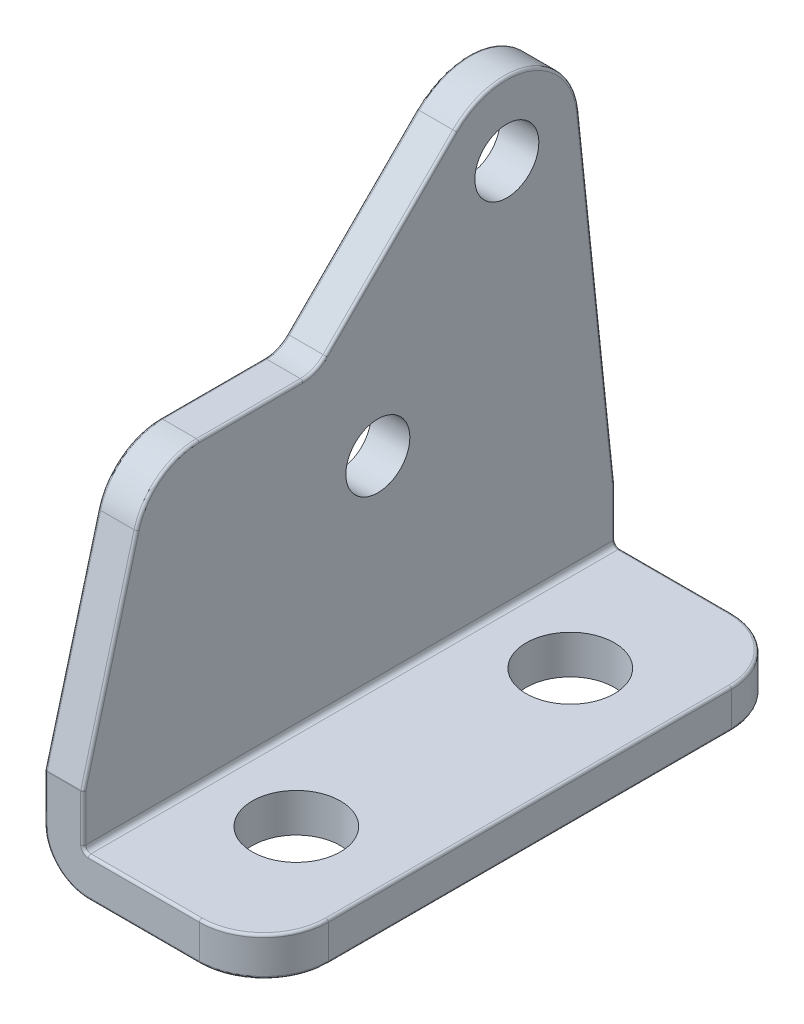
ISO-10303-21;
HEADER;
FILE_DESCRIPTION(('STEP AP214'),'2;1');
FILE_NAME('part.step','',(''),(''),'','','');
FILE_SCHEMA(('AUTOMOTIVE_DESIGN { 1 0 10303 214 1 1 1 1 }'));
ENDSEC;
DATA;
#1=APPLICATION_CONTEXT('core data for automotive mechanical design processes');
#2=APPLICATION_PROTOCOL_DEFINITION('international standard','automotive_design',2000,#1);
#3=PRODUCT_CONTEXT('',#1,'mechanical');
#4=PRODUCT('Part','Part','',(#3));
#5=PRODUCT_RELATED_PRODUCT_CATEGORY('part','',(#4));
#6=PRODUCT_DEFINITION_FORMATION('','',#4);
#7=PRODUCT_DEFINITION_CONTEXT('part definition',#1,'design');
#8=PRODUCT_DEFINITION('design','',#6,#7);
#9=PRODUCT_DEFINITION_SHAPE('','',#8);
#10=(LENGTH_UNIT() NAMED_UNIT(*) SI_UNIT(.MILLI.,.METRE.));
#11=(NAMED_UNIT(*) PLANE_ANGLE_UNIT() SI_UNIT($,.RADIAN.));
#12=(NAMED_UNIT(*) SI_UNIT($,.STERADIAN.) SOLID_ANGLE_UNIT());
#13=UNCERTAINTY_MEASURE_WITH_UNIT(LENGTH_MEASURE(1.E-05),#10,'distance_accuracy_value','');
#14=(GEOMETRIC_REPRESENTATION_CONTEXT(3) GLOBAL_UNCERTAINTY_ASSIGNED_CONTEXT((#13)) GLOBAL_UNIT_ASSIGNED_CONTEXT((#10,
#11,#12)) REPRESENTATION_CONTEXT('',''));
#15=CARTESIAN_POINT('',(0.,0.,0.));
#16=DIRECTION('',(0.,0.,1.));
#17=DIRECTION('',(1.,0.,0.));
#18=AXIS2_PLACEMENT_3D('',#15,#16,#17);
#19=CARTESIAN_POINT('',(9.525,-12.573,-2.78129999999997));
#20=DIRECTION('',(0.,1.,0.));
#21=DIRECTION('',(0.,0.,1.));
#22=AXIS2_PLACEMENT_3D('',#19,#20,#21);
#23=TOROIDAL_SURFACE('',#22,3.048,0.127000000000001);
#24=CARTESIAN_POINT('',(9.525,-12.573,0.26670000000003));
#25=DIRECTION('',(1.,0.,0.));
#26=DIRECTION('',(0.,0.,-1.));
#27=AXIS2_PLACEMENT_3D('',#24,#25,#26);
#28=CIRCLE('',#27,0.127000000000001);
#29=CARTESIAN_POINT('',(9.525,-12.573,0.39370000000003));
#30=VERTEX_POINT('',#29);
#31=CARTESIAN_POINT('',(9.525,-12.7,0.266700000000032));
#32=VERTEX_POINT('',#31);
#33=EDGE_CURVE('E666',#30,#32,#28,.T.);
#34=ORIENTED_EDGE('',*,*,#33,.T.);
#35=CARTESIAN_POINT('',(9.525,-12.7,0.266700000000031));
#36=CARTESIAN_POINT('',(9.55688989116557,-12.6999999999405,0.266689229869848));
#37=CARTESIAN_POINT('',(9.58877960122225,-12.6999999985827,0.26617872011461));
#38=CARTESIAN_POINT('',(9.6525270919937,-12.6999999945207,0.264159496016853));
#39=CARTESIAN_POINT('',(9.68438487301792,-12.6999999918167,0.262650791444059));
#40=CARTESIAN_POINT('',(9.74803732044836,-12.6999999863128,0.258636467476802));
#41=CARTESIAN_POINT('',(9.7798319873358,-12.699999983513,0.256130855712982));
#42=CARTESIAN_POINT('',(9.84332708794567,-12.6999999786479,0.250125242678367));
#43=CARTESIAN_POINT('',(9.87502752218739,-12.6999999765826,0.246625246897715));
#44=CARTESIAN_POINT('',(9.93830314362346,-12.6999999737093,0.238634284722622));
#45=CARTESIAN_POINT('',(9.96987833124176,-12.6999999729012,0.234143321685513));
#46=CARTESIAN_POINT('',(10.0328725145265,-12.6999999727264,0.224174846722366));
#47=CARTESIAN_POINT('',(10.0642915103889,-12.6999999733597,0.218697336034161));
#48=CARTESIAN_POINT('',(10.1269427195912,-12.6999999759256,0.206761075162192));
#49=CARTESIAN_POINT('',(10.158174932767,-12.6999999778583,0.20030232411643));
#50=CARTESIAN_POINT('',(10.2204214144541,-12.6999999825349,0.186410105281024));
#51=CARTESIAN_POINT('',(10.2514356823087,-12.6999999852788,0.178976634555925));
#52=CARTESIAN_POINT('',(10.3282202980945,-12.6999999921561,0.159296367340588));
#53=CARTESIAN_POINT('',(10.3738420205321,-12.6999999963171,0.14646520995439));
#54=CARTESIAN_POINT('',(10.4644409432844,-12.7000000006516,0.118694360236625));
#55=CARTESIAN_POINT('',(10.5094181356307,-12.7000000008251,0.10375464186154));
#56=CARTESIAN_POINT('',(10.57070314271,-12.6999999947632,0.0818013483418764));
#57=CARTESIAN_POINT('',(10.5873343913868,-12.6999999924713,0.075679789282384));
#58=CARTESIAN_POINT('',(10.6204877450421,-12.699999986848,0.0631471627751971));
#59=CARTESIAN_POINT('',(10.6370098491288,-12.6999999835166,0.0567360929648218));
#60=CARTESIAN_POINT('',(10.6854900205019,-12.6999999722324,0.0374359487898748));
#61=CARTESIAN_POINT('',(10.7172899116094,-12.6999999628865,0.0241470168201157));
#62=CARTESIAN_POINT('',(10.7804203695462,-12.6999999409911,-0.00350203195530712));
#63=CARTESIAN_POINT('',(10.8117509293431,-12.6999999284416,-0.0178621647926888));
#64=CARTESIAN_POINT('',(10.8739074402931,-12.699999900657,-0.0476373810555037));
#65=CARTESIAN_POINT('',(10.9047333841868,-12.6999998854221,-0.0630524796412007));
#66=CARTESIAN_POINT('',(10.9658449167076,-12.6999998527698,-0.0949198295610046));
#67=CARTESIAN_POINT('',(10.996130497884,-12.6999998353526,-0.111372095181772));
#68=CARTESIAN_POINT('',(11.0561264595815,-12.69999979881,-0.145294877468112));
#69=CARTESIAN_POINT('',(11.085836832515,-12.6999997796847,-0.162765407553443));
#70=CARTESIAN_POINT('',(11.1446481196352,-12.6999997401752,-0.198704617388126));
#71=CARTESIAN_POINT('',(11.1737490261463,-12.6999997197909,-0.217173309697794));
#72=CARTESIAN_POINT('',(11.2313078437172,-12.6999996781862,-0.255087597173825));
#73=CARTESIAN_POINT('',(11.2597657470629,-12.6999996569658,-0.274533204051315));
#74=CARTESIAN_POINT('',(11.3160057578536,-12.6999996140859,-0.314378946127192));
#75=CARTESIAN_POINT('',(11.3437878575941,-12.6999995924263,-0.334779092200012));
#76=CARTESIAN_POINT('',(11.3986442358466,-12.699999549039,-0.376510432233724));
#77=CARTESIAN_POINT('',(11.4257185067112,-12.6999995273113,-0.397841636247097));
#78=CARTESIAN_POINT('',(11.4791280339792,-12.6999994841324,-0.441410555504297));
#79=CARTESIAN_POINT('',(11.5054632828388,-12.6999994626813,-0.463648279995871));
#80=CARTESIAN_POINT('',(11.5573643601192,-12.6999994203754,-0.50900458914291));
#81=CARTESIAN_POINT('',(11.5829301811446,-12.6999993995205,-0.532123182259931));
#82=CARTESIAN_POINT('',(11.6332631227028,-12.6999993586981,-0.579214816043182));
#83=CARTESIAN_POINT('',(11.6580302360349,-12.6999993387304,-0.603187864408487));
#84=CARTESIAN_POINT('',(11.7032577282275,-12.6999993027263,-0.648476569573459));
#85=CARTESIAN_POINT('',(11.7238279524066,-12.6999992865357,-0.669682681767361));
#86=CARTESIAN_POINT('',(11.7643432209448,-12.6999992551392,-0.712684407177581));
#87=CARTESIAN_POINT('',(11.784288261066,-12.6999992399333,-0.734480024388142));
#88=CARTESIAN_POINT('',(11.8235361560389,-12.6999992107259,-0.778642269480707));
#89=CARTESIAN_POINT('',(11.8428390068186,-12.6999991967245,-0.801008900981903));
#90=CARTESIAN_POINT('',(11.8807860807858,-12.6999991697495,-0.846293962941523));
#91=CARTESIAN_POINT('',(11.8994303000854,-12.6999991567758,-0.869212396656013));
#92=CARTESIAN_POINT('',(11.9411171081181,-12.6999991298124,-0.922006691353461));
#93=CARTESIAN_POINT('',(11.9639470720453,-12.6999991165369,-0.952050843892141));
#94=CARTESIAN_POINT('',(12.0084745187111,-12.6999990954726,-1.0129663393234));
#95=CARTESIAN_POINT('',(12.030172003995,-12.6999990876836,-1.04383768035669));
#96=CARTESIAN_POINT('',(12.0724049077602,-12.6999990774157,-1.10636514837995));
#97=CARTESIAN_POINT('',(12.0929403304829,-12.6999990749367,-1.13802127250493));
#98=CARTESIAN_POINT('',(12.1328207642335,-12.6999990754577,-1.20207472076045));
#99=CARTESIAN_POINT('',(12.1521657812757,-12.6999990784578,-1.23447204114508));
#100=CARTESIAN_POINT('',(12.1872963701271,-12.699999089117,-1.29586934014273));
#101=CARTESIAN_POINT('',(12.2032246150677,-12.6999990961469,-1.32478780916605));
#102=CARTESIAN_POINT('',(12.234132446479,-12.6999991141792,-1.38312730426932));
#103=CARTESIAN_POINT('',(12.2491120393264,-12.6999991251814,-1.41254832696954));
#104=CARTESIAN_POINT('',(12.2781065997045,-12.6999991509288,-1.4718615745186));
#105=CARTESIAN_POINT('',(12.2921215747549,-12.6999991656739,-1.50175379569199));
#106=CARTESIAN_POINT('',(12.3191721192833,-12.6999991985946,-1.56197784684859));
#107=CARTESIAN_POINT('',(12.3322076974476,-12.6999992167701,-1.59230967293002));
#108=CARTESIAN_POINT('',(12.3572856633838,-12.6999992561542,-1.6533808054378));
#109=CARTESIAN_POINT('',(12.3693280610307,-12.6999992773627,-1.68412010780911));
#110=CARTESIAN_POINT('',(12.3924069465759,-12.699999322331,-1.7459736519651));
#111=CARTESIAN_POINT('',(12.4034434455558,-12.6999993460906,-1.77708788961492));
#112=CARTESIAN_POINT('',(12.4244988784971,-12.6999993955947,-1.8396583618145));
#113=CARTESIAN_POINT('',(12.4345178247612,-12.6999994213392,-1.87111459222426));
#114=CARTESIAN_POINT('',(12.4535275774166,-12.6999994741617,-1.93433574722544));
#115=CARTESIAN_POINT('',(12.4625183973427,-12.6999995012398,-1.96610066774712));
#116=CARTESIAN_POINT('',(12.4794624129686,-12.6999995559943,-2.02990557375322));
#117=CARTESIAN_POINT('',(12.4874156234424,-12.6999995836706,-2.06194555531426));
#118=CARTESIAN_POINT('',(12.5022760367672,-12.6999996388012,-2.12626666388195));
#119=CARTESIAN_POINT('',(12.5091832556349,-12.6999996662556,-2.15854778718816));
#120=CARTESIAN_POINT('',(12.5219444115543,-12.6999997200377,-2.22331700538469));
#121=CARTESIAN_POINT('',(12.5277983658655,-12.6999997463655,-2.25580509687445));
#122=CARTESIAN_POINT('',(12.53844683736,-12.6999997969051,-2.32095385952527));
#123=CARTESIAN_POINT('',(12.5432413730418,-12.699999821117,-2.35361452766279));
#124=CARTESIAN_POINT('',(12.551765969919,-12.6999998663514,-2.41907387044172));
#125=CARTESIAN_POINT('',(12.5554960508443,-12.699999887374,-2.45187254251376));
#126=CARTESIAN_POINT('',(12.5618878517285,-12.69999992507,-2.51757317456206));
#127=CARTESIAN_POINT('',(12.5645495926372,-12.6999999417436,-2.55047513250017));
#128=CARTESIAN_POINT('',(12.5688018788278,-12.6999999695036,-2.61634751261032));
#129=CARTESIAN_POINT('',(12.570392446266,-12.6999999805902,-2.64931793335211));
#130=CARTESIAN_POINT('',(12.5725009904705,-12.6999999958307,-2.71529233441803));
#131=CARTESIAN_POINT('',(12.5730189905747,-12.6999999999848,-2.74829631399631));
#132=CARTESIAN_POINT('',(12.573,-12.7,-2.78129999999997));
#133=B_SPLINE_CURVE_WITH_KNOTS('',3,(#35,#36,#37,#38,#39,#40,#41,#42,#43,#44,#45,#46,#47,#48,
#49,#50,#51,#52,#53,#54,#55,#56,#57,#58,#59,#60,#61,#62,#63,#64,#65,#66,#67,#68,#69,#70,#71,#72,
#73,#74,#75,#76,#77,#78,#79,#80,#81,#82,#83,#84,#85,#86,#87,#88,#89,#90,#91,#92,#93,#94,#95,#96,
#97,#98,#99,#100,#101,#102,#103,#104,#105,#106,#107,#108,#109,#110,#111,#112,#113,#114,#115,
#116,#117,#118,#119,#120,#121,#122,#123,#124,#125,#126,#127,#128,#129,#130,#131,#132),
.UNSPECIFIED.,.F.,.F.,(4,2,2,2,2,2,2,2,2,2,2,2,2,2,2,2,2,2,2,2,2,2,2,2,2,2,2,2,2,2,2,2,2,2,2,2,
2,2,2,2,2,2,2,2,2,2,2,2,4),(0.,0.0956657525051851,0.191330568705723,0.286994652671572,
0.382658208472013,0.47832144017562,0.573984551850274,0.669647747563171,0.765311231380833,
0.907433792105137,1.04955810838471,1.10272229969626,1.15588692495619,1.25926014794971,
1.36263491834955,1.46601117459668,1.56938885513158,1.6727678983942,1.77614824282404,
1.87952982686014,1.98291258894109,2.08629646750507,2.18968140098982,2.29306732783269,
2.39645418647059,2.48507331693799,2.57369304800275,2.66231334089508,2.75093415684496,
2.86410922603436,2.97728404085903,3.0904584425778,3.20363227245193,3.30266011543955,
3.40168729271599,3.50071369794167,3.59973922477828,3.69876376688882,3.79778721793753,
3.8968094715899,3.99583042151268,4.09484996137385,4.19386798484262,4.2928843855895,
4.3918990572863,4.49091189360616,4.58992278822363,4.68893163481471,4.78793832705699),.UNSPECIFIED.);
#134=CARTESIAN_POINT('',(12.573,-12.7,-2.78129999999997));
#135=VERTEX_POINT('',#134);
#136=EDGE_CURVE('E608',#32,#135,#133,.T.);
#137=ORIENTED_EDGE('',*,*,#136,.T.);
#138=CARTESIAN_POINT('',(12.573,-12.573,-2.78129999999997));
#139=DIRECTION('',(0.,0.,1.));
#140=DIRECTION('',(0.,-1.,0.));
#141=AXIS2_PLACEMENT_3D('',#138,#139,#140);
#142=CIRCLE('',#141,0.127);
#143=CARTESIAN_POINT('',(12.7,-12.573,-2.78129999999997));
#144=VERTEX_POINT('',#143);
#145=EDGE_CURVE('E182',#144,#135,#142,.F.);
#146=ORIENTED_EDGE('',*,*,#145,.F.);
#147=CARTESIAN_POINT('',(9.525,-12.573,-2.78129999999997));
#148=DIRECTION('',(0.,1.,0.));
#149=DIRECTION('',(0.,0.,1.));
#150=AXIS2_PLACEMENT_3D('',#147,#148,#149);
#151=CIRCLE('',#150,3.175);
#152=EDGE_CURVE('E629',#30,#144,#151,.T.);
#153=ORIENTED_EDGE('',*,*,#152,.F.);
#154=EDGE_LOOP('',(#34,#137,#146,#153));
#155=FACE_BOUND('',#154,.T.);
#156=ADVANCED_FACE('F17',(#155),#23,.T.);
#157=CARTESIAN_POINT('',(12.573,-12.573,-12.7));
#158=DIRECTION('',(0.,0.,1.));
#159=DIRECTION('',(0.,-1.,0.));
#160=AXIS2_PLACEMENT_3D('',#157,#158,#159);
#161=CYLINDRICAL_SURFACE('',#160,0.127);
#162=ORIENTED_EDGE('',*,*,#145,.T.);
#163=DIRECTION('',(0.,0.,1.));
#164=VECTOR('',#163,1.);
#165=CARTESIAN_POINT('',(12.573,-12.7,-12.7));
#166=LINE('',#165,#164);
#167=CARTESIAN_POINT('',(12.573,-12.7,-22.6187));
#168=VERTEX_POINT('',#167);
#169=EDGE_CURVE('E606',#135,#168,#166,.F.);
#170=ORIENTED_EDGE('',*,*,#169,.T.);
#171=CARTESIAN_POINT('',(12.573,-12.573,-22.6187));
#172=DIRECTION('',(0.,0.,-1.));
#173=DIRECTION('',(-1.,0.,0.));
#174=AXIS2_PLACEMENT_3D('',#171,#172,#173);
#175=CIRCLE('',#174,0.126999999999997);
#176=CARTESIAN_POINT('',(12.7,-12.573,-22.6187));
#177=VERTEX_POINT('',#176);
#178=EDGE_CURVE('E656',#177,#168,#175,.T.);
#179=ORIENTED_EDGE('',*,*,#178,.F.);
#180=DIRECTION('',(0.,0.,1.));
#181=VECTOR('',#180,1.);
#182=CARTESIAN_POINT('',(12.7,-12.573,-12.7));
#183=LINE('',#182,#181);
#184=EDGE_CURVE('E649',#177,#144,#183,.T.);
#185=ORIENTED_EDGE('',*,*,#184,.T.);
#186=EDGE_LOOP('',(#162,#170,#179,#185));
#187=FACE_BOUND('',#186,.T.);
#188=ADVANCED_FACE('F698',(#187),#161,.T.);
#189=CARTESIAN_POINT('',(9.525,-12.573,-22.6187));
#190=DIRECTION('',(0.,1.,0.));
#191=DIRECTION('',(0.,0.,1.));
#192=AXIS2_PLACEMENT_3D('',#189,#190,#191);
#193=TOROIDAL_SURFACE('',#192,3.048,0.126999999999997);
#194=ORIENTED_EDGE('',*,*,#178,.T.);
#195=CARTESIAN_POINT('',(12.573,-12.7,-22.6187));
#196=CARTESIAN_POINT('',(12.5729892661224,-12.6999999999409,-22.6505898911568));
#197=CARTESIAN_POINT('',(12.5724787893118,-12.699999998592,-22.6824796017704));
#198=CARTESIAN_POINT('',(12.5704596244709,-12.6999999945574,-22.7462270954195));
#199=CARTESIAN_POINT('',(12.5689509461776,-12.6999999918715,-22.7780848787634));
#200=CARTESIAN_POINT('',(12.5649366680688,-12.6999999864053,-22.8417373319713));
#201=CARTESIAN_POINT('',(12.5624310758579,-12.699999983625,-22.8735320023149));
#202=CARTESIAN_POINT('',(12.5564254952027,-12.6999999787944,-22.9370271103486));
#203=CARTESIAN_POINT('',(12.5529255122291,-12.6999999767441,-22.9687275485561));
#204=CARTESIAN_POINT('',(12.5449345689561,-12.699999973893,-23.0320031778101));
#205=CARTESIAN_POINT('',(12.540443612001,-12.6999999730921,-23.0635783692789));
#206=CARTESIAN_POINT('',(12.5304751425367,-12.6999999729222,-23.1265725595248));
#207=CARTESIAN_POINT('',(12.5249976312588,-12.6999999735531,-23.1579915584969));
#208=CARTESIAN_POINT('',(12.5130613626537,-12.6999999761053,-23.2206427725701));
#209=CARTESIAN_POINT('',(12.5066026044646,-12.6999999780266,-23.2518749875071));
#210=CARTESIAN_POINT('',(12.492710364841,-12.6999999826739,-23.3141214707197));
#211=CARTESIAN_POINT('',(12.4852768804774,-12.6999999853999,-23.3451357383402));
#212=CARTESIAN_POINT('',(12.4655965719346,-12.6999999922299,-23.4219203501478));
#213=CARTESIAN_POINT('',(12.4527653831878,-12.6999999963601,-23.4675420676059));
#214=CARTESIAN_POINT('',(12.4249944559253,-12.7000000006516,-23.5581409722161));
#215=CARTESIAN_POINT('',(12.4100546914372,-12.7000000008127,-23.6031181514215));
#216=CARTESIAN_POINT('',(12.3881013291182,-12.6999999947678,-23.6644031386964));
#217=CARTESIAN_POINT('',(12.3819797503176,-12.6999999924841,-23.6810343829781));
#218=CARTESIAN_POINT('',(12.3694470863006,-12.6999999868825,-23.7141877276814));
#219=CARTESIAN_POINT('',(12.3630359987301,-12.6999999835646,-23.7307098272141));
#220=CARTESIAN_POINT('',(12.3437358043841,-12.6999999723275,-23.7791899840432));
#221=CARTESIAN_POINT('',(12.330446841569,-12.6999999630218,-23.810989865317));
#222=CARTESIAN_POINT('',(12.3027977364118,-12.6999999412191,-23.8741203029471));
#223=CARTESIAN_POINT('',(12.288437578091,-12.699999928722,-23.9054508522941));
#224=CARTESIAN_POINT('',(12.2586623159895,-12.6999999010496,-23.9676073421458));
#225=CARTESIAN_POINT('',(12.2432471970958,-12.6999998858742,-23.9984332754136));
#226=CARTESIAN_POINT('',(12.2113798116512,-12.6999998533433,-24.0595447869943));
#227=CARTESIAN_POINT('',(12.1949275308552,-12.6999998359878,-24.0898303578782));
#228=CARTESIAN_POINT('',(12.1610047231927,-12.6999997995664,-24.1498262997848));
#229=CARTESIAN_POINT('',(12.1435341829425,-12.6999997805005,-24.1795366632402));
#230=CARTESIAN_POINT('',(12.1075949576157,-12.6999997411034,-24.2383479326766));
#231=CARTESIAN_POINT('',(12.0891262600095,-12.6999997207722,-24.2674488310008));
#232=CARTESIAN_POINT('',(12.0512119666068,-12.6999996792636,-24.3250076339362));
#233=CARTESIAN_POINT('',(12.0317663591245,-12.6999996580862,-24.35346553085));
#234=CARTESIAN_POINT('',(11.9919206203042,-12.6999996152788,-24.4097055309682));
#235=CARTESIAN_POINT('',(11.971520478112,-12.6999995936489,-24.4374876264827));
#236=CARTESIAN_POINT('',(11.9297891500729,-12.6999995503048,-24.4923439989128));
#237=CARTESIAN_POINT('',(11.9084579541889,-12.6999995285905,-24.5194182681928));
#238=CARTESIAN_POINT('',(11.8648890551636,-12.69999948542,-24.5728277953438));
#239=CARTESIAN_POINT('',(11.8426513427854,-12.6999994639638,-24.5991630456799));
#240=CARTESIAN_POINT('',(11.7972950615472,-12.6999994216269,-24.6510641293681));
#241=CARTESIAN_POINT('',(11.7741764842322,-12.6999994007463,-24.6766299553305));
#242=CARTESIAN_POINT('',(11.7270848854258,-12.6999993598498,-24.7269629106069));
#243=CARTESIAN_POINT('',(11.7031118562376,-12.6999993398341,-24.7517300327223));
#244=CARTESIAN_POINT('',(11.6578231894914,-12.6999993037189,-24.7969575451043));
#245=CARTESIAN_POINT('',(11.6366170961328,-12.6999992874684,-24.8175277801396));
#246=CARTESIAN_POINT('',(11.5936154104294,-12.6999992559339,-24.858043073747));
#247=CARTESIAN_POINT('',(11.5718198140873,-12.69999924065,-24.8779881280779));
#248=CARTESIAN_POINT('',(11.5276576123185,-12.6999992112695,-24.9172360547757));
#249=CARTESIAN_POINT('',(11.5052910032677,-12.6999991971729,-24.9365389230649));
#250=CARTESIAN_POINT('',(11.4600059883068,-12.6999991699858,-24.9744860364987));
#251=CARTESIAN_POINT('',(11.4370875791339,-12.6999991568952,-24.9931302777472));
#252=CARTESIAN_POINT('',(11.3842933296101,-12.6999991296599,-25.0348171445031));
#253=CARTESIAN_POINT('',(11.3542491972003,-12.699999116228,-25.0576471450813));
#254=CARTESIAN_POINT('',(11.2933337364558,-12.6999990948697,-25.1021746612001));
#255=CARTESIAN_POINT('',(11.2624624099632,-12.6999990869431,-25.1238721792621));
#256=CARTESIAN_POINT('',(11.1999349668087,-12.6999990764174,-25.1661051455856));
#257=CARTESIAN_POINT('',(11.1682788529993,-12.6999990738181,-25.1866405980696));
#258=CARTESIAN_POINT('',(11.104225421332,-12.699999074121,-25.2265210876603));
#259=CARTESIAN_POINT('',(11.0718281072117,-12.6999990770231,-25.2458661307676));
#260=CARTESIAN_POINT('',(11.0104308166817,-12.6999990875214,-25.2809967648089));
#261=CARTESIAN_POINT('',(10.9815123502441,-12.6999990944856,-25.296925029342));
#262=CARTESIAN_POINT('',(10.923172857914,-12.6999991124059,-25.3278328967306));
#263=CARTESIAN_POINT('',(10.8937518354,-12.699999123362,-25.3428125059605));
#264=CARTESIAN_POINT('',(10.8344385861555,-12.6999991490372,-25.371807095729));
#265=CARTESIAN_POINT('',(10.804546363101,-12.6999991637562,-25.3858220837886));
#266=CARTESIAN_POINT('',(10.7443223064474,-12.6999991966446,-25.4128726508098));
#267=CARTESIAN_POINT('',(10.7139904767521,-12.699999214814,-25.4259082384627));
#268=CARTESIAN_POINT('',(10.6529193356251,-12.699999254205,-25.4509862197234));
#269=CARTESIAN_POINT('',(10.6221800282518,-12.6999992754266,-25.4630286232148));
#270=CARTESIAN_POINT('',(10.5603264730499,-12.6999993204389,-25.4861075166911));
#271=CARTESIAN_POINT('',(10.5292122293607,-12.6999993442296,-25.4971440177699));
#272=CARTESIAN_POINT('',(10.4666417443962,-12.6999993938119,-25.5181994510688));
#273=CARTESIAN_POINT('',(10.4351855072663,-12.6999994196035,-25.5282183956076));
#274=CARTESIAN_POINT('',(10.3719643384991,-12.6999994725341,-25.5472281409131));
#275=CARTESIAN_POINT('',(10.3401994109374,-12.6999994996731,-25.5562189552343));
#276=CARTESIAN_POINT('',(10.2763944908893,-12.6999995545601,-25.5731629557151));
#277=CARTESIAN_POINT('',(10.2443545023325,-12.6999995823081,-25.5811161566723));
#278=CARTESIAN_POINT('',(10.1800333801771,-12.6999996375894,-25.5959765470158));
#279=CARTESIAN_POINT('',(10.1477522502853,-12.6999996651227,-25.6028837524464));
#280=CARTESIAN_POINT('',(10.0829830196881,-12.6999997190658,-25.6156448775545));
#281=CARTESIAN_POINT('',(10.0504949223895,-12.6999997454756,-25.6214988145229));
#282=CARTESIAN_POINT('',(9.98534614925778,-12.6999997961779,-25.6321472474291));
#283=CARTESIAN_POINT('',(9.952685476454,-12.6999998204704,-25.6369417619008));
#284=CARTESIAN_POINT('',(9.88722612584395,-12.6999998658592,-25.6454663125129));
#285=CARTESIAN_POINT('',(9.85442745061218,-12.6999998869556,-25.6491963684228));
#286=CARTESIAN_POINT('',(9.78872681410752,-12.6999999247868,-25.6555881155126));
#287=CARTESIAN_POINT('',(9.75582485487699,-12.6999999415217,-25.6582498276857));
#288=CARTESIAN_POINT('',(9.68995247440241,-12.6999999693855,-25.6625020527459));
#289=CARTESIAN_POINT('',(9.65698205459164,-12.6999999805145,-25.6640925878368));
#290=CARTESIAN_POINT('',(9.5910076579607,-12.699999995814,-25.6662010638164));
#291=CARTESIAN_POINT('',(9.55800368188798,-12.6999999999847,-25.6667190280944));
#292=CARTESIAN_POINT('',(9.525,-12.7,-25.6667));
#293=B_SPLINE_CURVE_WITH_KNOTS('',3,(#195,#196,#197,#198,#199,#200,#201,#202,#203,#204,#205,
#206,#207,#208,#209,#210,#211,#212,#213,#214,#215,#216,#217,#218,#219,#220,#221,#222,#223,#224,
#225,#226,#227,#228,#229,#230,#231,#232,#233,#234,#235,#236,#237,#238,#239,#240,#241,#242,#243,
#244,#245,#246,#247,#248,#249,#250,#251,#252,#253,#254,#255,#256,#257,#258,#259,#260,#261,#262,
#263,#264,#265,#266,#267,#268,#269,#270,#271,#272,#273,#274,#275,#276,#277,#278,#279,#280,#281,
#282,#283,#284,#285,#286,#287,#288,#289,#290,#291,#292),.UNSPECIFIED.,.F.,.F.,(4,2,2,2,2,2,2,2,
2,2,2,2,2,2,2,2,2,2,2,2,2,2,2,2,2,2,2,2,2,2,2,2,2,2,2,2,2,2,2,2,2,2,2,2,2,2,2,2,4),(0.,
0.0956657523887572,0.191330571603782,0.286994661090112,0.382658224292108,0.47832146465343,
0.573984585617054,0.669647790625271,0.765311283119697,0.907433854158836,1.04955817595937,
1.10272237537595,1.15588700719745,1.25926023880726,1.36263501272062,1.46601126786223,
1.5693889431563,1.67276797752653,1.77614830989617,1.87952987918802,1.98291262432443,
2.08629648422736,2.18968139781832,2.29306730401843,2.39645414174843,2.48507325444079,
2.57369296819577,2.66231324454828,2.75093404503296,2.86410913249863,2.97728396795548,
3.09045839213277,3.20363224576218,3.30266011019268,3.40168730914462,3.50071373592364,
3.59973928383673,3.69876384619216,3.79778731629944,3.89680958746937,3.99583055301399,
4.09485010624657,4.19386814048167,4.29288454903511,4.39189922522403,4.49091206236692,
4.58992295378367,4.68893179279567,4.78793847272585),.UNSPECIFIED.);
#294=CARTESIAN_POINT('',(9.525,-12.7,-25.6667));
#295=VERTEX_POINT('',#294);
#296=EDGE_CURVE('E605',#168,#295,#293,.T.);
#297=ORIENTED_EDGE('',*,*,#296,.T.);
#298=CARTESIAN_POINT('',(9.525,-12.573,-25.6667));
#299=DIRECTION('',(1.,0.,0.));
#300=DIRECTION('',(0.,0.,-1.));
#301=AXIS2_PLACEMENT_3D('',#298,#299,#300);
#302=CIRCLE('',#301,0.12699999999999);
#303=CARTESIAN_POINT('',(9.525,-12.573,-25.7937));
#304=VERTEX_POINT('',#303);
#305=EDGE_CURVE('E659',#295,#304,#302,.T.);
#306=ORIENTED_EDGE('',*,*,#305,.T.);
#307=CARTESIAN_POINT('',(9.525,-12.573,-22.6187));
#308=DIRECTION('',(0.,1.,0.));
#309=DIRECTION('',(0.,0.,1.));
#310=AXIS2_PLACEMENT_3D('',#307,#308,#309);
#311=CIRCLE('',#310,3.175);
#312=EDGE_CURVE('E643',#177,#304,#311,.T.);
#313=ORIENTED_EDGE('',*,*,#312,.F.);
#314=EDGE_LOOP('',(#194,#297,#306,#313));
#315=FACE_BOUND('',#314,.T.);
#316=ADVANCED_FACE('F700',(#315),#193,.T.);
#317=CARTESIAN_POINT('',(12.7,-11.7475,-12.7));
#318=DIRECTION('',(-1.,0.,0.));
#319=DIRECTION('',(0.,0.,1.));
#320=AXIS2_PLACEMENT_3D('',#317,#318,#319);
#321=PLANE('',#320);
#322=DIRECTION('',(0.,0.,-1.));
#323=VECTOR('',#322,1.);
#324=CARTESIAN_POINT('',(12.7,-10.922,-12.7));
#325=LINE('',#324,#323);
#326=CARTESIAN_POINT('',(12.7,-10.922,-2.78129999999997));
#327=VERTEX_POINT('',#326);
#328=CARTESIAN_POINT('',(12.7,-10.922,-22.6187));
#329=VERTEX_POINT('',#328);
#330=EDGE_CURVE('E593',#327,#329,#325,.T.);
#331=ORIENTED_EDGE('',*,*,#330,.F.);
#332=DIRECTION('',(0.,1.,0.));
#333=VECTOR('',#332,1.);
#334=CARTESIAN_POINT('',(12.7,-11.7475,-2.78129999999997));
#335=LINE('',#334,#333);
#336=EDGE_CURVE('E637',#144,#327,#335,.T.);
#337=ORIENTED_EDGE('',*,*,#336,.F.);
#338=ORIENTED_EDGE('',*,*,#184,.F.);
#339=DIRECTION('',(0.,1.,0.));
#340=VECTOR('',#339,1.);
#341=CARTESIAN_POINT('',(12.7,-11.7475,-22.6187));
#342=LINE('',#341,#340);
#343=EDGE_CURVE('E646',#329,#177,#342,.F.);
#344=ORIENTED_EDGE('',*,*,#343,.F.);
#345=EDGE_LOOP('',(#331,#337,#338,#344));
#346=FACE_BOUND('',#345,.T.);
#347=ADVANCED_FACE('F704',(#346),#321,.F.);
#348=CARTESIAN_POINT('',(9.525,-11.7475,-22.6187));
#349=DIRECTION('',(0.,1.,0.));
#350=DIRECTION('',(0.,0.,1.));
#351=AXIS2_PLACEMENT_3D('',#348,#349,#350);
#352=CYLINDRICAL_SURFACE('',#351,3.175);
#353=ORIENTED_EDGE('',*,*,#312,.T.);
#354=DIRECTION('',(0.,1.,0.));
#355=VECTOR('',#354,1.);
#356=CARTESIAN_POINT('',(9.525,-11.7475,-25.7937));
#357=LINE('',#356,#355);
#358=CARTESIAN_POINT('',(9.525,-10.922,-25.7937));
#359=VERTEX_POINT('',#358);
#360=EDGE_CURVE('E630',#304,#359,#357,.T.);
#361=ORIENTED_EDGE('',*,*,#360,.T.);
#362=CARTESIAN_POINT('',(9.525,-10.922,-22.6187));
#363=DIRECTION('',(0.,1.,0.));
#364=DIRECTION('',(-1.,0.,0.));
#365=AXIS2_PLACEMENT_3D('',#362,#363,#364);
#366=CIRCLE('',#365,3.175);
#367=EDGE_CURVE('E587',#329,#359,#366,.T.);
#368=ORIENTED_EDGE('',*,*,#367,.F.);
#369=ORIENTED_EDGE('',*,*,#343,.T.);
#370=EDGE_LOOP('',(#353,#361,#368,#369));
#371=FACE_BOUND('',#370,.T.);
#372=ADVANCED_FACE('F1059',(#371),#352,.T.);
#373=CARTESIAN_POINT('',(9.525,-11.7475,-2.78129999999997));
#374=DIRECTION('',(0.,1.,0.));
#375=DIRECTION('',(0.,0.,1.));
#376=AXIS2_PLACEMENT_3D('',#373,#374,#375);
#377=CYLINDRICAL_SURFACE('',#376,3.175);
#378=ORIENTED_EDGE('',*,*,#152,.T.);
#379=ORIENTED_EDGE('',*,*,#336,.T.);
#380=CARTESIAN_POINT('',(9.525,-10.922,-2.78129999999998));
#381=DIRECTION('',(0.,1.,0.));
#382=DIRECTION('',(0.,0.,1.));
#383=AXIS2_PLACEMENT_3D('',#380,#381,#382);
#384=CIRCLE('',#383,3.17500000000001);
#385=CARTESIAN_POINT('',(9.525,-10.922,0.393700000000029));
#386=VERTEX_POINT('',#385);
#387=EDGE_CURVE('E583',#386,#327,#384,.T.);
#388=ORIENTED_EDGE('',*,*,#387,.F.);
#389=DIRECTION('',(0.,1.,0.));
#390=VECTOR('',#389,1.);
#391=CARTESIAN_POINT('',(9.525,-11.7475,0.393700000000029));
#392=LINE('',#391,#390);
#393=EDGE_CURVE('E626',#386,#30,#392,.F.);
#394=ORIENTED_EDGE('',*,*,#393,.T.);
#395=EDGE_LOOP('',(#378,#379,#388,#394));
#396=FACE_BOUND('',#395,.T.);
#397=ADVANCED_FACE('F710',(#396),#377,.T.);
#398=CARTESIAN_POINT('',(3.683,-8.23883771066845,-25.6667));
#399=DIRECTION('',(0.0697599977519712,0.771707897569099,0.632139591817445));
#400=DIRECTION('',(0.997522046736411,-0.0597615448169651,-0.037125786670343));
#401=AXIS2_PLACEMENT_3D('',#398,#399,#400);
#402=SPHERICAL_SURFACE('',#401,0.127000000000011);
#403=CARTESIAN_POINT('',(3.68300000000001,-8.23883771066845,-25.6667));
#404=DIRECTION('',(-1.,0.,0.));
#405=DIRECTION('',(0.,-1.,0.));
#406=AXIS2_PLACEMENT_3D('',#403,#404,#405);
#407=CIRCLE('',#406,0.127);
#408=CARTESIAN_POINT('',(3.68300000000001,-8.22556259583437,-25.7930042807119));
#409=VERTEX_POINT('',#408);
#410=CARTESIAN_POINT('',(3.68300000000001,-8.23883771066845,-25.7937));
#411=VERTEX_POINT('',#410);
#412=EDGE_CURVE('E564',#409,#411,#407,.T.);
#413=ORIENTED_EDGE('',*,*,#412,.F.);
#414=CARTESIAN_POINT('',(3.68300000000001,-8.23883771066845,-25.6667));
#415=DIRECTION('',(0.,-0.994521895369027,-0.104528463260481));
#416=DIRECTION('',(0.,0.104528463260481,-0.994521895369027));
#417=AXIS2_PLACEMENT_3D('',#414,#415,#416);
#418=CIRCLE('',#417,0.127000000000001);
#419=CARTESIAN_POINT('',(3.81000000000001,-8.23883771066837,-25.6667));
#420=VERTEX_POINT('',#419);
#421=EDGE_CURVE('E686',#409,#420,#418,.T.);
#422=ORIENTED_EDGE('',*,*,#421,.T.);
#423=CARTESIAN_POINT('',(3.68300000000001,-8.23883771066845,-25.6667));
#424=DIRECTION('',(0.,1.,0.));
#425=DIRECTION('',(0.,0.,1.));
#426=AXIS2_PLACEMENT_3D('',#423,#424,#425);
#427=CIRCLE('',#426,0.126999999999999);
#428=EDGE_CURVE('E21',#420,#411,#427,.T.);
#429=ORIENTED_EDGE('',*,*,#428,.T.);
#430=EDGE_LOOP('',(#413,#422,#429));
#431=FACE_BOUND('',#430,.T.);
#432=ADVANCED_FACE('F706',(#431),#402,.T.);
#433=CARTESIAN_POINT('',(-5.62269340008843,-12.7,-12.7));
#434=DIRECTION('',(0.,1.,0.));
#435=DIRECTION('',(0.,0.,1.));
#436=AXIS2_PLACEMENT_3D('',#433,#434,#435);
#437=PLANE('',#436);
#438=CARTESIAN_POINT('',(7.95019999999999,-12.7,-19.4437));
#439=DIRECTION('',(0.,-1.,0.));
#440=DIRECTION('',(0.,0.,-1.));
#441=AXIS2_PLACEMENT_3D('',#438,#439,#440);
#442=CIRCLE('',#441,2.1717);
#443=CARTESIAN_POINT('',(7.95019999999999,-12.7,-21.6154));
#444=VERTEX_POINT('',#443);
#445=EDGE_CURVE('E571',#444,#444,#442,.F.);
#446=ORIENTED_EDGE('',*,*,#445,.T.);
#447=EDGE_LOOP('',(#446));
#448=FACE_BOUND('',#447,.T.);
#449=CARTESIAN_POINT('',(7.95019999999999,-12.7,-5.95629999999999));
#450=DIRECTION('',(0.,-1.,0.));
#451=DIRECTION('',(0.,0.,-1.));
#452=AXIS2_PLACEMENT_3D('',#449,#450,#451);
#453=CIRCLE('',#452,2.1717);
#454=CARTESIAN_POINT('',(7.95019999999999,-12.7,-8.12799999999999));
#455=VERTEX_POINT('',#454);
#456=EDGE_CURVE('E623',#455,#455,#453,.F.);
#457=ORIENTED_EDGE('',*,*,#456,.T.);
#458=EDGE_LOOP('',(#457));
#459=FACE_BOUND('',#458,.T.);
#460=DIRECTION('',(1.,0.,0.));
#461=VECTOR('',#460,1.);
#462=CARTESIAN_POINT('',(-5.62269340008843,-12.7,-25.6667));
#463=LINE('',#462,#461);
#464=CARTESIAN_POINT('',(4.06400000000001,-12.7,-25.6667));
#465=VERTEX_POINT('',#464);
#466=EDGE_CURVE('E565',#295,#465,#463,.F.);
#467=ORIENTED_EDGE('',*,*,#466,.F.);
#468=ORIENTED_EDGE('',*,*,#296,.F.);
#469=ORIENTED_EDGE('',*,*,#169,.F.);
#470=ORIENTED_EDGE('',*,*,#136,.F.);
#471=DIRECTION('',(-1.,0.,0.));
#472=VECTOR('',#471,1.);
#473=CARTESIAN_POINT('',(-5.62269340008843,-12.7,0.266700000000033));
#474=LINE('',#473,#472);
#475=CARTESIAN_POINT('',(4.06400000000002,-12.7,0.266700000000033));
#476=VERTEX_POINT('',#475);
#477=EDGE_CURVE('E599',#476,#32,#474,.F.);
#478=ORIENTED_EDGE('',*,*,#477,.F.);
#479=DIRECTION('',(0.,0.,-1.));
#480=VECTOR('',#479,1.);
#481=CARTESIAN_POINT('',(4.06400000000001,-12.7,-12.7));
#482=LINE('',#481,#480);
#483=EDGE_CURVE('E507',#465,#476,#482,.F.);
#484=ORIENTED_EDGE('',*,*,#483,.F.);
#485=EDGE_LOOP('',(#467,#468,#469,#470,#478,#484));
#486=FACE_BOUND('',#485,.T.);
#487=ADVANCED_FACE('F709',(#448,#459,#486),#437,.F.);
#488=CARTESIAN_POINT('',(2.03985946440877,-8.16564160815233,-25.7701870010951));
#489=CARTESIAN_POINT('',(1.96140372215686,-8.15806079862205,-25.7707835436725));
#490=CARTESIAN_POINT('',(1.90423892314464,-8.18926536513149,-25.7263809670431));
#491=CARTESIAN_POINT('',(1.90500692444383,-8.23925360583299,-25.6654407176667));
#492=CARTESIAN_POINT('',(2.0378422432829,-8.18776155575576,-25.7859855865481));
#493=CARTESIAN_POINT('',(1.96050052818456,-8.18028838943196,-25.7865736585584));
#494=CARTESIAN_POINT('',(1.90414743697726,-8.21104986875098,-25.7428015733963));
#495=CARTESIAN_POINT('',(1.90490453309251,-8.26032830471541,-25.6827266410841));
#496=CARTESIAN_POINT('',(2.03540017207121,-8.2136725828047,-25.7940856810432));
#497=CARTESIAN_POINT('',(1.96435850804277,-8.2068081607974,-25.7946258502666));
#498=CARTESIAN_POINT('',(1.91259579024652,-8.23506389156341,-25.7544193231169));
#499=CARTESIAN_POINT('',(1.91329121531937,-8.28032823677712,-25.6992379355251));
#500=CARTESIAN_POINT('',(2.03277589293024,-8.24080019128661,-25.7936824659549));
#501=CARTESIAN_POINT('',(1.97259433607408,-8.2349851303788,-25.7941400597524));
#502=CARTESIAN_POINT('',(1.92874456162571,-8.2589214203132,-25.7600798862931));
#503=CARTESIAN_POINT('',(1.929333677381,-8.2972662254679,-25.7133340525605));
#504=CARTESIAN_POINT('',(2.03275051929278,-8.241062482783,-25.7936785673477));
#505=CARTESIAN_POINT('',(1.97267396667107,-8.23525756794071,-25.7941353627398));
#506=CARTESIAN_POINT('',(1.92890070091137,-8.25915209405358,-25.7601346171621));
#507=CARTESIAN_POINT('',(1.92948878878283,-8.29742999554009,-25.7134703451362));
#508=CARTESIAN_POINT('',(2.03272514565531,-8.24132477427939,-25.7936746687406));
#509=CARTESIAN_POINT('',(1.97275359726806,-8.23553000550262,-25.7941306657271));
#510=CARTESIAN_POINT('',(1.92905684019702,-8.25938276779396,-25.7601893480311));
#511=CARTESIAN_POINT('',(1.92964390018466,-8.29759376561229,-25.7136066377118));
#512=CARTESIAN_POINT('',(2.03269977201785,-8.24158706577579,-25.7936707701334));
#513=CARTESIAN_POINT('',(1.97283322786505,-8.23580244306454,-25.7941259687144));
#514=CARTESIAN_POINT('',(1.92921297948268,-8.25961344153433,-25.7602440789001));
#515=CARTESIAN_POINT('',(1.92979901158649,-8.29775753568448,-25.7137429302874));
#516=(BOUNDED_SURFACE() B_SPLINE_SURFACE(3,3,((#488,#489,#490,#491),(#492,#493,#494,#495),(#496,
#497,#498,#499),(#500,#501,#502,#503),(#504,#505,#506,#507),(#508,#509,#510,#511),(#512,#513,
#514,#515)),.UNSPECIFIED.,.F.,.F.,.F.) B_SPLINE_SURFACE_WITH_KNOTS((4,3,4),(4,4),(0.,1.,1.01),
(0.,1.),.UNSPECIFIED.) GEOMETRIC_REPRESENTATION_ITEM() RATIONAL_B_SPLINE_SURFACE(((1.,
0.786337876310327,0.786337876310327,1.),(0.966880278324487,0.760294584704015,0.760294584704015,
0.966880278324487),(0.966880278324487,0.760294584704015,0.760294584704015,0.966880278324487),
(1.,0.786337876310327,0.786337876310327,1.),(1.,0.786337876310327,0.786337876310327,1.),(1.,
0.786337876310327,0.786337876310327,1.),(1.,0.786337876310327,0.786337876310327,1.))) REPRESENTATION_ITEM('') SURFACE());
#517=CARTESIAN_POINT('',(2.03200000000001,-8.23883771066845,-25.6667));
#518=DIRECTION('',(-1.,0.,0.));
#519=DIRECTION('',(0.,-1.,0.));
#520=AXIS2_PLACEMENT_3D('',#517,#518,#519);
#521=CIRCLE('',#520,0.127);
#522=CARTESIAN_POINT('',(2.03200000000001,-8.23883771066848,-25.7937));
#523=VERTEX_POINT('',#522);
#524=CARTESIAN_POINT('',(2.03200000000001,-8.22556259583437,-25.7930042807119));
#525=VERTEX_POINT('',#524);
#526=EDGE_CURVE('E529',#523,#525,#521,.F.);
#527=CARTESIAN_POINT('',(2.03200000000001,-8.23883771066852,-25.6667));
#528=DIRECTION('',(0.,1.,0.));
#529=DIRECTION('',(0.,0.,1.));
#530=AXIS2_PLACEMENT_3D('',#527,#528,#529);
#531=CIRCLE('',#530,0.126999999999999);
#532=CARTESIAN_POINT('',(1.90500000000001,-8.23883771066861,-25.6666999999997));
#533=VERTEX_POINT('',#532);
#534=EDGE_CURVE('E506',#533,#523,#531,.F.);
#535=CARTESIAN_POINT('',(2.03200000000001,-8.23883771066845,-25.6667));
#536=DIRECTION('',(0.,0.994521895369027,0.104528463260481));
#537=DIRECTION('',(0.,-0.104528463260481,0.994521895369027));
#538=AXIS2_PLACEMENT_3D('',#535,#536,#537);
#539=CIRCLE('',#538,0.127000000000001);
#540=EDGE_CURVE('E496',#525,#533,#539,.T.);
#541=ORIENTED_EDGE('',*,*,#526,.F.);
#542=ORIENTED_EDGE('',*,*,#534,.F.);
#543=ORIENTED_EDGE('',*,*,#540,.F.);
#544=EDGE_LOOP('',(#541,#542,#543));
#545=FACE_BOUND('',#544,.T.);
#546=ADVANCED_FACE('F716',(#545),#516,.T.);
#547=CARTESIAN_POINT('',(2.03200000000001,-8.24631986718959,0.266700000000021));
#548=DIRECTION('',(0.0697599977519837,0.771707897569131,0.632139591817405));
#549=DIRECTION('',(-0.997525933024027,0.0594853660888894,0.0374633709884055));
#550=AXIS2_PLACEMENT_3D('',#547,#548,#549);
#551=SPHERICAL_SURFACE('',#550,0.126999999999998);
#552=CARTESIAN_POINT('',(2.03200000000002,-8.2463198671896,0.266700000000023));
#553=DIRECTION('',(0.,-0.965925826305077,0.258819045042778));
#554=DIRECTION('',(0.,-0.258819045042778,-0.965925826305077));
#555=AXIS2_PLACEMENT_3D('',#552,#553,#554);
#556=CIRCLE('',#555,0.127);
#557=CARTESIAN_POINT('',(1.90500000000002,-8.2463198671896,0.266700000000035));
#558=VERTEX_POINT('',#557);
#559=CARTESIAN_POINT('',(2.03037226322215,-8.21345254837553,0.38936250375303));
#560=VERTEX_POINT('',#559);
#561=EDGE_CURVE('E465',#558,#560,#556,.F.);
#562=ORIENTED_EDGE('',*,*,#561,.F.);
#563=CARTESIAN_POINT('',(2.03200000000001,-8.24631986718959,0.266700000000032));
#564=DIRECTION('',(0.,1.,0.));
#565=DIRECTION('',(0.,0.,1.));
#566=AXIS2_PLACEMENT_3D('',#563,#564,#565);
#567=CIRCLE('',#566,0.127);
#568=CARTESIAN_POINT('',(2.02590658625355,-8.24631986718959,0.393553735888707));
#569=VERTEX_POINT('',#568);
#570=EDGE_CURVE('E522',#569,#558,#567,.F.);
#571=ORIENTED_EDGE('',*,*,#570,.F.);
#572=CARTESIAN_POINT('',(2.03199999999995,-8.24631986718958,0.266699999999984));
#573=DIRECTION('',(0.990564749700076,-0.128520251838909,0.0475817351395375));
#574=DIRECTION('',(0.128665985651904,0.99168798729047,0.));
#575=AXIS2_PLACEMENT_3D('',#572,#573,#574);
#576=CIRCLE('',#575,0.127000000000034);
#577=EDGE_CURVE('E603',#560,#569,#576,.T.);
#578=ORIENTED_EDGE('',*,*,#577,.F.);
#579=EDGE_LOOP('',(#562,#571,#578));
#580=FACE_BOUND('',#579,.T.);
#581=ADVANCED_FACE('F712',(#580),#551,.T.);
#582=CARTESIAN_POINT('',(2.0304282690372,-8.21305982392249,0.38925733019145));
#583=CARTESIAN_POINT('',(2.03194407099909,-8.21325649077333,0.389330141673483));
#584=CARTESIAN_POINT('',(2.03346472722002,-8.21342361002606,0.389366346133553));
#585=CARTESIAN_POINT('',(2.03498878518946,-8.21356102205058,0.389365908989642));
#586=CARTESIAN_POINT('',(2.02887022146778,-8.22397874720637,0.392200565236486));
#587=CARTESIAN_POINT('',(2.03057507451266,-8.22419994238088,0.392282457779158));
#588=CARTESIAN_POINT('',(2.0322853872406,-8.22438790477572,0.392323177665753));
#589=CARTESIAN_POINT('',(2.03399952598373,-8.22454245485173,0.392322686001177));
#590=CARTESIAN_POINT('',(2.02734516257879,-8.23519982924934,0.393640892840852));
#591=CARTESIAN_POINT('',(2.02921910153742,-8.23544296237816,0.393730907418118));
#592=CARTESIAN_POINT('',(2.03109904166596,-8.23564956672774,0.393775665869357));
#593=CARTESIAN_POINT('',(2.0329831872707,-8.23581944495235,0.393775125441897));
#594=CARTESIAN_POINT('',(2.02588060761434,-8.24652061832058,0.39355232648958));
#595=CARTESIAN_POINT('',(2.02790061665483,-8.24678270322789,0.393649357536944));
#596=CARTESIAN_POINT('',(2.02992709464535,-8.24700541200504,0.393697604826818));
#597=CARTESIAN_POINT('',(2.03195810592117,-8.24718853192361,0.393697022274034));
#598=(BOUNDED_SURFACE() B_SPLINE_SURFACE(3,3,((#582,#583,#584,#585),(#586,#587,#588,#589),(#590,
#591,#592,#593),(#594,#595,#596,#597)),.UNSPECIFIED.,.F.,.F.,
.F.) B_SPLINE_SURFACE_WITH_KNOTS((4,4),(4,4),(0.,1.),(0.,1.),
.UNSPECIFIED.) GEOMETRIC_REPRESENTATION_ITEM() RATIONAL_B_SPLINE_SURFACE(((1.,0.999681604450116,
0.999681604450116,1.),(0.993985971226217,0.993669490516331,0.993669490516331,0.993985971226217),
(0.993985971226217,0.993669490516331,0.993669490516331,0.993985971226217),(1.,0.999681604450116,
0.999681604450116,1.))) REPRESENTATION_ITEM('') SURFACE());
#599=CARTESIAN_POINT('',(2.03200000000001,-8.24631986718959,0.266700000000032));
#600=DIRECTION('',(0.,1.,0.));
#601=DIRECTION('',(0.,0.,1.));
#602=AXIS2_PLACEMENT_3D('',#599,#600,#601);
#603=CIRCLE('',#602,0.127);
#604=CARTESIAN_POINT('',(2.03200000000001,-8.24631986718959,0.393700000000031));
#605=VERTEX_POINT('',#604);
#606=EDGE_CURVE('E528',#605,#569,#603,.F.);
#607=CARTESIAN_POINT('',(2.03200000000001,-8.24631986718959,0.266700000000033));
#608=DIRECTION('',(1.,0.,0.));
#609=DIRECTION('',(0.,1.,0.));
#610=AXIS2_PLACEMENT_3D('',#607,#608,#609);
#611=CIRCLE('',#610,0.127);
#612=CARTESIAN_POINT('',(2.03200000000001,-8.21344984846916,0.389372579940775));
#613=VERTEX_POINT('',#612);
#614=EDGE_CURVE('E600',#613,#605,#611,.T.);
#615=CARTESIAN_POINT('',(2.03200000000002,-8.2463198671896,0.266700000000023));
#616=DIRECTION('',(0.,-0.965925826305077,0.258819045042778));
#617=DIRECTION('',(0.,-0.258819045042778,-0.965925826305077));
#618=AXIS2_PLACEMENT_3D('',#615,#616,#617);
#619=CIRCLE('',#618,0.127);
#620=EDGE_CURVE('E534',#560,#613,#619,.F.);
#621=ORIENTED_EDGE('',*,*,#606,.F.);
#622=ORIENTED_EDGE('',*,*,#614,.F.);
#623=ORIENTED_EDGE('',*,*,#620,.F.);
#624=ORIENTED_EDGE('',*,*,#577,.T.);
#625=EDGE_LOOP('',(#621,#622,#623,#624));
#626=FACE_BOUND('',#625,.T.);
#627=ADVANCED_FACE('F715',(#626),#598,.T.);
#628=CARTESIAN_POINT('',(4.06400000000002,-10.541,0.266700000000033));
#629=DIRECTION('',(0.,0.,-1.));
#630=DIRECTION('',(0.,1.,0.));
#631=AXIS2_PLACEMENT_3D('',#628,#629,#630);
#632=TOROIDAL_SURFACE('',#631,2.032,0.127);
#633=CARTESIAN_POINT('',(4.06400000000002,-10.541,0.266700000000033));
#634=DIRECTION('',(0.,0.,-1.));
#635=DIRECTION('',(0.,1.,0.));
#636=AXIS2_PLACEMENT_3D('',#633,#634,#635);
#637=CIRCLE('',#636,2.159);
#638=CARTESIAN_POINT('',(1.90500000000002,-10.541,0.266700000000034));
#639=VERTEX_POINT('',#638);
#640=EDGE_CURVE('E517',#476,#639,#637,.T.);
#641=ORIENTED_EDGE('',*,*,#640,.F.);
#642=CARTESIAN_POINT('',(4.06400000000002,-12.573,0.266700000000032));
#643=DIRECTION('',(-1.,0.,0.));
#644=DIRECTION('',(0.,0.,1.));
#645=AXIS2_PLACEMENT_3D('',#642,#643,#644);
#646=CIRCLE('',#645,0.127);
#647=CARTESIAN_POINT('',(4.06400000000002,-12.573,0.393700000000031));
#648=VERTEX_POINT('',#647);
#649=EDGE_CURVE('E596',#648,#476,#646,.F.);
#650=ORIENTED_EDGE('',*,*,#649,.F.);
#651=CARTESIAN_POINT('',(4.06400000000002,-12.573,0.393700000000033));
#652=CARTESIAN_POINT('',(4.04275026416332,-12.5729892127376,0.393699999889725));
#653=CARTESIAN_POINT('',(4.02150070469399,-12.5726463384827,0.393699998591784));
#654=CARTESIAN_POINT('',(3.97902301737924,-12.571297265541,0.3936999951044));
#655=CARTESIAN_POINT('',(3.95779488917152,-12.5702910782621,0.393699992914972));
#656=CARTESIAN_POINT('',(3.91538068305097,-12.5676162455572,0.393699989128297));
#657=CARTESIAN_POINT('',(3.89419460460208,-12.5659476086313,0.393699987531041));
#658=CARTESIAN_POINT('',(3.85188506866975,-12.5619495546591,0.393699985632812));
#659=CARTESIAN_POINT('',(3.8307616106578,-12.5596201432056,0.393699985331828));
#660=CARTESIAN_POINT('',(3.78859783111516,-12.5543028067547,0.393699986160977));
#661=CARTESIAN_POINT('',(3.76755750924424,-12.5513148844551,0.393699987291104));
#662=CARTESIAN_POINT('',(3.72558041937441,-12.5446834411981,0.39369999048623));
#663=CARTESIAN_POINT('',(3.70464365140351,-12.5410399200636,0.393699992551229));
#664=CARTESIAN_POINT('',(3.6628940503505,-12.5331008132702,0.393699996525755));
#665=CARTESIAN_POINT('',(3.64208121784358,-12.5288052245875,0.393699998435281));
#666=CARTESIAN_POINT('',(3.60059951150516,-12.5195661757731,0.39370000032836));
#667=CARTESIAN_POINT('',(3.57993063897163,-12.514622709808,0.393700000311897));
#668=CARTESIAN_POINT('',(3.54287473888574,-12.5051455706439,0.393699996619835));
#669=CARTESIAN_POINT('',(3.52645801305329,-12.5007276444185,0.393699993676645));
#670=CARTESIAN_POINT('',(3.49373980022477,-12.4914835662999,0.393699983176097));
#671=CARTESIAN_POINT('',(3.47743831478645,-12.4866574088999,0.393699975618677));
#672=CARTESIAN_POINT('',(3.43509017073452,-12.4735393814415,0.393699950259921));
#673=CARTESIAN_POINT('',(3.40914295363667,-12.4649240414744,0.393699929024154));
#674=CARTESIAN_POINT('',(3.35761872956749,-12.4466487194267,0.39369988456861));
#675=CARTESIAN_POINT('',(3.33204173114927,-12.4369887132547,0.393699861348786));
#676=CARTESIAN_POINT('',(3.28552824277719,-12.4183368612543,0.393699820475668));
#677=CARTESIAN_POINT('',(3.26452868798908,-12.4095019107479,0.393699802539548));
#678=CARTESIAN_POINT('',(3.22283935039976,-12.3911281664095,0.393699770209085));
#679=CARTESIAN_POINT('',(3.20214957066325,-12.3815893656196,0.393699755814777));
#680=CARTESIAN_POINT('',(3.16110362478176,-12.3618189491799,0.393699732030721));
#681=CARTESIAN_POINT('',(3.14074746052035,-12.3515873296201,0.393699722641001));
#682=CARTESIAN_POINT('',(3.10039197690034,-12.3304429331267,0.393699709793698));
#683=CARTESIAN_POINT('',(3.08039265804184,-12.3195301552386,0.393699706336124));
#684=CARTESIAN_POINT('',(3.04077374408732,-12.2970359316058,0.393699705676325));
#685=CARTESIAN_POINT('',(3.02115414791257,-12.2854544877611,0.393699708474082));
#686=CARTESIAN_POINT('',(2.98231711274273,-12.2616361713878,0.393699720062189));
#687=CARTESIAN_POINT('',(2.96309967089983,-12.2493993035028,0.393699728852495));
#688=CARTESIAN_POINT('',(2.92508888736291,-12.224284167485,0.393699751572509));
#689=CARTESIAN_POINT('',(2.90629554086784,-12.2114059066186,0.393699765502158));
#690=CARTESIAN_POINT('',(2.86915451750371,-12.1850226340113,0.393699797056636));
#691=CARTESIAN_POINT('',(2.85080683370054,-12.1715176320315,0.393699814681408));
#692=CARTESIAN_POINT('',(2.81457775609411,-12.1438966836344,0.393699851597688));
#693=CARTESIAN_POINT('',(2.79669635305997,-12.1297807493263,0.393699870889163));
#694=CARTESIAN_POINT('',(2.76142154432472,-12.1009528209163,0.393699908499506));
#695=CARTESIAN_POINT('',(2.74402812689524,-12.0862408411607,0.393699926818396));
#696=CARTESIAN_POINT('',(2.70974436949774,-12.0562424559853,0.393699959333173));
#697=CARTESIAN_POINT('',(2.69285401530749,-12.0409560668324,0.393699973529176));
#698=CARTESIAN_POINT('',(2.65961351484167,-12.0098085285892,0.393699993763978));
#699=CARTESIAN_POINT('',(2.64326335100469,-11.9939473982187,0.393699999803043));
#700=CARTESIAN_POINT('',(2.60671005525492,-11.957389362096,0.393700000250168));
#701=CARTESIAN_POINT('',(2.58665745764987,-11.9365422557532,0.393699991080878));
#702=CARTESIAN_POINT('',(2.53291810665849,-11.8782012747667,0.393699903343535));
#703=CARTESIAN_POINT('',(2.50016009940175,-11.8398376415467,0.393699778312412));
#704=CARTESIAN_POINT('',(2.46025239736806,-11.789428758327,0.393699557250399));
#705=CARTESIAN_POINT('',(2.45173504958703,-11.7784407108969,0.393699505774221));
#706=CARTESIAN_POINT('',(2.41546966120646,-11.7306320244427,0.393699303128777));
#707=CARTESIAN_POINT('',(2.38886868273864,-11.6929208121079,0.39369919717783));
#708=CARTESIAN_POINT('',(2.3534611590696,-11.6388245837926,0.393699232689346));
#709=CARTESIAN_POINT('',(2.34352213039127,-11.6231653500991,0.393699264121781));
#710=CARTESIAN_POINT('',(2.32096097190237,-11.5865084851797,0.393699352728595));
#711=CARTESIAN_POINT('',(2.30850118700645,-11.5654101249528,0.393699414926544));
#712=CARTESIAN_POINT('',(2.28538545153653,-11.524605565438,0.393699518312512));
#713=CARTESIAN_POINT('',(2.27466640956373,-11.5049349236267,0.393699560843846));
#714=CARTESIAN_POINT('',(2.24843389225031,-11.4548401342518,0.393699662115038));
#715=CARTESIAN_POINT('',(2.2333544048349,-11.4241869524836,0.393699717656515));
#716=CARTESIAN_POINT('',(2.20744964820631,-11.3679978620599,0.393699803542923));
#717=CARTESIAN_POINT('',(2.19635776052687,-11.3425842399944,0.393699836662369));
#718=CARTESIAN_POINT('',(2.17767267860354,-11.297264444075,0.393699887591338));
#719=CARTESIAN_POINT('',(2.16986438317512,-11.2774468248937,0.393699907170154));
#720=CARTESIAN_POINT('',(2.15713320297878,-11.243590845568,0.393699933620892));
#721=CARTESIAN_POINT('',(2.15205044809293,-11.2296124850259,0.393699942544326));
#722=CARTESIAN_POINT('',(2.14362979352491,-11.2056259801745,0.393699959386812));
#723=CARTESIAN_POINT('',(2.14021419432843,-11.1956449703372,0.393699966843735));
#724=CARTESIAN_POINT('',(2.1291609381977,-11.1625990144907,0.393699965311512));
#725=CARTESIAN_POINT('',(2.1218214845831,-11.1394329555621,0.393699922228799));
#726=CARTESIAN_POINT('',(2.10801146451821,-11.0928424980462,0.393699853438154));
#727=CARTESIAN_POINT('',(2.10154091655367,-11.069418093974,0.393699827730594));
#728=CARTESIAN_POINT('',(2.09019952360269,-11.025294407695,0.393699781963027));
#729=CARTESIAN_POINT('',(2.08522981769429,-11.0046204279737,0.393699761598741));
#730=CARTESIAN_POINT('',(2.07594851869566,-10.9631250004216,0.393699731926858));
#731=CARTESIAN_POINT('',(2.0716369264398,-10.9423035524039,0.393699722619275));
#732=CARTESIAN_POINT('',(2.06367429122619,-10.9005349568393,0.39369971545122));
#733=CARTESIAN_POINT('',(2.06002324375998,-10.8795878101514,0.393699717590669));
#734=CARTESIAN_POINT('',(2.05338587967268,-10.8375887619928,0.393699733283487));
#735=CARTESIAN_POINT('',(2.05039955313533,-10.8165368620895,0.393699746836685));
#736=CARTESIAN_POINT('',(2.04509448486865,-10.7743496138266,0.393699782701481));
#737=CARTESIAN_POINT('',(2.04277572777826,-10.7532142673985,0.393699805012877));
#738=CARTESIAN_POINT('',(2.03880812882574,-10.7108814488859,0.393699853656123));
#739=CARTESIAN_POINT('',(2.03715926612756,-10.6896839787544,0.393699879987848));
#740=CARTESIAN_POINT('',(2.03453310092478,-10.6472483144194,0.39369992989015));
#741=CARTESIAN_POINT('',(2.03355577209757,-10.6260101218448,0.393699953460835));
#742=CARTESIAN_POINT('',(2.03227346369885,-10.583514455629,0.393699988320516));
#743=CARTESIAN_POINT('',(2.03196845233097,-10.562256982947,0.393699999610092));
#744=CARTESIAN_POINT('',(2.03200000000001,-10.541,0.393700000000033));
#745=B_SPLINE_CURVE_WITH_KNOTS('',3,(#651,#652,#653,#654,#655,#656,#657,#658,#659,#660,#661,
#662,#663,#664,#665,#666,#667,#668,#669,#670,#671,#672,#673,#674,#675,#676,#677,#678,#679,#680,
#681,#682,#683,#684,#685,#686,#687,#688,#689,#690,#691,#692,#693,#694,#695,#696,#697,#698,#699,
#700,#701,#702,#703,#704,#705,#706,#707,#708,#709,#710,#711,#712,#713,#714,#715,#716,#717,#718,
#719,#720,#721,#722,#723,#724,#725,#726,#727,#728,#729,#730,#731,#732,#733,#734,#735,#736,#737,
#738,#739,#740,#741,#742,#743,#744),.UNSPECIFIED.,.F.,.F.,(4,2,2,2,2,2,2,2,2,2,2,2,2,2,2,2,2,2,
2,2,2,2,2,2,2,2,2,2,2,2,2,2,2,2,2,2,2,2,2,2,2,2,2,2,2,2,4),(0.,0.0637466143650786,
0.1274921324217,0.191236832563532,0.254980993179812,0.318724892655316,0.382468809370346,
0.446213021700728,0.509957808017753,0.560954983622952,0.611952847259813,0.693949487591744,
0.775948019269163,0.84428263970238,0.912617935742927,0.980953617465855,1.04928939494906,
1.11762497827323,1.18596007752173,1.25429440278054,1.32262766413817,1.39095957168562,
1.45928983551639,1.52761816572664,1.59594427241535,1.68270343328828,1.83386506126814,
1.87557317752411,2.01387630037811,2.06951391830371,2.14300357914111,2.21019818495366,
2.31263487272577,2.39579864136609,2.45968934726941,2.50430686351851,2.53595391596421,
2.6088405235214,2.68172868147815,2.74550730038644,2.80928600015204,2.87306426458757,
2.93684157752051,3.00061742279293,3.06439128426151,3.1281626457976,3.19193099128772),.UNSPECIFIED.);
#746=CARTESIAN_POINT('',(2.03200000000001,-10.541,0.393700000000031));
#747=VERTEX_POINT('',#746);
#748=EDGE_CURVE('E455',#648,#747,#745,.T.);
#749=ORIENTED_EDGE('',*,*,#748,.T.);
#750=CARTESIAN_POINT('',(2.03200000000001,-10.541,0.266700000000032));
#751=DIRECTION('',(0.,1.,0.));
#752=DIRECTION('',(0.,0.,1.));
#753=AXIS2_PLACEMENT_3D('',#750,#751,#752);
#754=CIRCLE('',#753,0.127);
#755=EDGE_CURVE('E525',#639,#747,#754,.T.);
#756=ORIENTED_EDGE('',*,*,#755,.F.);
#757=EDGE_LOOP('',(#641,#650,#749,#756));
#758=FACE_BOUND('',#757,.T.);
#759=ADVANCED_FACE('F718',(#758),#632,.T.);
#760=CARTESIAN_POINT('',(-1.3825967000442,-8.24631986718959,0.266700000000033));
#761=DIRECTION('',(1.,0.,0.));
#762=DIRECTION('',(0.,1.,0.));
#763=AXIS2_PLACEMENT_3D('',#760,#761,#762);
#764=CYLINDRICAL_SURFACE('',#763,0.127);
#765=ORIENTED_EDGE('',*,*,#614,.T.);
#766=DIRECTION('',(1.,0.,0.));
#767=VECTOR('',#766,1.);
#768=CARTESIAN_POINT('',(-5.62269340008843,-8.24631986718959,0.393700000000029));
#769=LINE('',#768,#767);
#770=CARTESIAN_POINT('',(3.68300000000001,-8.24631986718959,0.393700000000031));
#771=VERTEX_POINT('',#770);
#772=EDGE_CURVE('E449',#605,#771,#769,.T.);
#773=ORIENTED_EDGE('',*,*,#772,.T.);
#774=CARTESIAN_POINT('',(3.68300000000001,-8.24631986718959,0.266700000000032));
#775=DIRECTION('',(1.,0.,0.));
#776=DIRECTION('',(0.,1.,0.));
#777=AXIS2_PLACEMENT_3D('',#774,#775,#776);
#778=CIRCLE('',#777,0.127);
#779=CARTESIAN_POINT('',(3.68300000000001,-8.21344984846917,0.389372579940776));
#780=VERTEX_POINT('',#779);
#781=EDGE_CURVE('E460',#780,#771,#778,.T.);
#782=ORIENTED_EDGE('',*,*,#781,.F.);
#783=DIRECTION('',(1.,0.,0.));
#784=VECTOR('',#783,1.);
#785=CARTESIAN_POINT('',(2.85750000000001,-8.21344984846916,0.389372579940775));
#786=LINE('',#785,#784);
#787=EDGE_CURVE('E457',#780,#613,#786,.F.);
#788=ORIENTED_EDGE('',*,*,#787,.T.);
#789=EDGE_LOOP('',(#765,#773,#782,#788));
#790=FACE_BOUND('',#789,.T.);
#791=ADVANCED_FACE('F722',(#790),#764,.T.);
#792=CARTESIAN_POINT('',(-5.62269340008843,-12.573,0.266700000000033));
#793=DIRECTION('',(-1.,0.,0.));
#794=DIRECTION('',(0.,0.,1.));
#795=AXIS2_PLACEMENT_3D('',#792,#793,#794);
#796=CYLINDRICAL_SURFACE('',#795,0.127);
#797=ORIENTED_EDGE('',*,*,#649,.T.);
#798=ORIENTED_EDGE('',*,*,#477,.T.);
#799=ORIENTED_EDGE('',*,*,#33,.F.);
#800=DIRECTION('',(1.,0.,0.));
#801=VECTOR('',#800,1.);
#802=CARTESIAN_POINT('',(-5.62269340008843,-12.573,0.39370000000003));
#803=LINE('',#802,#801);
#804=EDGE_CURVE('E433',#30,#648,#803,.F.);
#805=ORIENTED_EDGE('',*,*,#804,.T.);
#806=EDGE_LOOP('',(#797,#798,#799,#805));
#807=FACE_BOUND('',#806,.T.);
#808=ADVANCED_FACE('F1027',(#807),#796,.T.);
#809=CARTESIAN_POINT('',(12.573,-10.922,-12.7));
#810=DIRECTION('',(0.,0.,-1.));
#811=DIRECTION('',(0.,1.,0.));
#812=AXIS2_PLACEMENT_3D('',#809,#810,#811);
#813=CYLINDRICAL_SURFACE('',#812,0.127);
#814=CARTESIAN_POINT('',(12.573,-10.922,-2.78129999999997));
#815=DIRECTION('',(0.,0.,1.));
#816=DIRECTION('',(1.,0.,0.));
#817=AXIS2_PLACEMENT_3D('',#814,#815,#816);
#818=CIRCLE('',#817,0.127000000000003);
#819=CARTESIAN_POINT('',(12.573,-10.795,-2.78129999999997));
#820=VERTEX_POINT('',#819);
#821=EDGE_CURVE('E574',#327,#820,#818,.T.);
#822=ORIENTED_EDGE('',*,*,#821,.F.);
#823=ORIENTED_EDGE('',*,*,#330,.T.);
#824=CARTESIAN_POINT('',(12.573,-10.922,-22.6187));
#825=DIRECTION('',(0.,0.,-1.));
#826=DIRECTION('',(-1.,0.,0.));
#827=AXIS2_PLACEMENT_3D('',#824,#825,#826);
#828=CIRCLE('',#827,0.127);
#829=CARTESIAN_POINT('',(12.573,-10.795,-22.6187));
#830=VERTEX_POINT('',#829);
#831=EDGE_CURVE('E590',#830,#329,#828,.T.);
#832=ORIENTED_EDGE('',*,*,#831,.F.);
#833=DIRECTION('',(0.,0.,1.));
#834=VECTOR('',#833,1.);
#835=CARTESIAN_POINT('',(12.573,-10.795,-12.7));
#836=LINE('',#835,#834);
#837=EDGE_CURVE('E430',#820,#830,#836,.F.);
#838=ORIENTED_EDGE('',*,*,#837,.F.);
#839=EDGE_LOOP('',(#822,#823,#832,#838));
#840=FACE_BOUND('',#839,.T.);
#841=ADVANCED_FACE('F1024',(#840),#813,.T.);
#842=CARTESIAN_POINT('',(9.525,-10.922,-22.6187));
#843=DIRECTION('',(0.,-1.,0.));
#844=DIRECTION('',(1.,0.,0.));
#845=AXIS2_PLACEMENT_3D('',#842,#843,#844);
#846=TOROIDAL_SURFACE('',#845,3.04800000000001,0.126999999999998);
#847=ORIENTED_EDGE('',*,*,#831,.T.);
#848=ORIENTED_EDGE('',*,*,#367,.T.);
#849=CARTESIAN_POINT('',(9.525,-10.922,-25.6667));
#850=DIRECTION('',(-1.,0.,0.));
#851=DIRECTION('',(0.,0.,1.));
#852=AXIS2_PLACEMENT_3D('',#849,#850,#851);
#853=CIRCLE('',#852,0.126999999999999);
#854=CARTESIAN_POINT('',(9.525,-10.795,-25.6667));
#855=VERTEX_POINT('',#854);
#856=EDGE_CURVE('E561',#855,#359,#853,.T.);
#857=ORIENTED_EDGE('',*,*,#856,.F.);
#858=CARTESIAN_POINT('',(9.525,-10.795,-22.6187));
#859=DIRECTION('',(0.,-1.,0.));
#860=DIRECTION('',(1.,0.,0.));
#861=AXIS2_PLACEMENT_3D('',#858,#859,#860);
#862=CIRCLE('',#861,3.04800000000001);
#863=EDGE_CURVE('E427',#830,#855,#862,.F.);
#864=ORIENTED_EDGE('',*,*,#863,.F.);
#865=EDGE_LOOP('',(#847,#848,#857,#864));
#866=FACE_BOUND('',#865,.T.);
#867=ADVANCED_FACE('F724',(#866),#846,.T.);
#868=CARTESIAN_POINT('',(-5.62269340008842,-10.922,0.266700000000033));
#869=DIRECTION('',(1.,0.,0.));
#870=DIRECTION('',(0.,0.,-1.));
#871=AXIS2_PLACEMENT_3D('',#868,#869,#870);
#872=CYLINDRICAL_SURFACE('',#871,0.127);
#873=CARTESIAN_POINT('',(4.06400000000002,-10.922,0.266700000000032));
#874=DIRECTION('',(1.,0.,0.));
#875=DIRECTION('',(0.,0.,-1.));
#876=AXIS2_PLACEMENT_3D('',#873,#874,#875);
#877=CIRCLE('',#876,0.127);
#878=CARTESIAN_POINT('',(4.06400000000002,-10.795,0.266700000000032));
#879=VERTEX_POINT('',#878);
#880=CARTESIAN_POINT('',(4.06400000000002,-10.922,0.39370000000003));
#881=VERTEX_POINT('',#880);
#882=EDGE_CURVE('E578',#879,#881,#877,.T.);
#883=ORIENTED_EDGE('',*,*,#882,.T.);
#884=DIRECTION('',(1.,0.,0.));
#885=VECTOR('',#884,1.);
#886=CARTESIAN_POINT('',(-5.62269340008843,-10.922,0.39370000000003));
#887=LINE('',#886,#885);
#888=EDGE_CURVE('E444',#881,#386,#887,.T.);
#889=ORIENTED_EDGE('',*,*,#888,.T.);
#890=CARTESIAN_POINT('',(9.525,-10.922,0.266700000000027));
#891=DIRECTION('',(1.,0.,0.));
#892=DIRECTION('',(0.,0.,-1.));
#893=AXIS2_PLACEMENT_3D('',#890,#891,#892);
#894=CIRCLE('',#893,0.127000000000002);
#895=CARTESIAN_POINT('',(9.525,-10.795,0.266700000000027));
#896=VERTEX_POINT('',#895);
#897=EDGE_CURVE('E577',#896,#386,#894,.T.);
#898=ORIENTED_EDGE('',*,*,#897,.F.);
#899=DIRECTION('',(1.,0.,0.));
#900=VECTOR('',#899,1.);
#901=CARTESIAN_POINT('',(-5.62269340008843,-10.795,0.266700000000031));
#902=LINE('',#901,#900);
#903=EDGE_CURVE('E419',#879,#896,#902,.T.);
#904=ORIENTED_EDGE('',*,*,#903,.F.);
#905=EDGE_LOOP('',(#883,#889,#898,#904));
#906=FACE_BOUND('',#905,.T.);
#907=ADVANCED_FACE('F1020',(#906),#872,.T.);
#908=CARTESIAN_POINT('',(9.525,-10.922,-2.78129999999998));
#909=DIRECTION('',(0.,-1.,0.));
#910=DIRECTION('',(0.,0.,-1.));
#911=AXIS2_PLACEMENT_3D('',#908,#909,#910);
#912=TOROIDAL_SURFACE('',#911,3.048,0.127000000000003);
#913=ORIENTED_EDGE('',*,*,#897,.T.);
#914=ORIENTED_EDGE('',*,*,#387,.T.);
#915=ORIENTED_EDGE('',*,*,#821,.T.);
#916=CARTESIAN_POINT('',(9.525,-10.795,-2.78129999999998));
#917=DIRECTION('',(0.,-1.,0.));
#918=DIRECTION('',(0.,0.,-1.));
#919=AXIS2_PLACEMENT_3D('',#916,#917,#918);
#920=CIRCLE('',#919,3.048);
#921=EDGE_CURVE('E422',#896,#820,#920,.F.);
#922=ORIENTED_EDGE('',*,*,#921,.F.);
#923=EDGE_LOOP('',(#913,#914,#915,#922));
#924=FACE_BOUND('',#923,.T.);
#925=ADVANCED_FACE('F750',(#924),#912,.T.);
#926=CARTESIAN_POINT('',(7.95019999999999,-11.7475,-5.95629999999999));
#927=DIRECTION('',(0.,-1.,0.));
#928=DIRECTION('',(0.,0.,-1.));
#929=AXIS2_PLACEMENT_3D('',#926,#927,#928);
#930=CYLINDRICAL_SURFACE('',#929,2.1717);
#931=ORIENTED_EDGE('',*,*,#456,.F.);
#932=EDGE_LOOP('',(#931));
#933=FACE_BOUND('',#932,.T.);
#934=CARTESIAN_POINT('',(7.95019999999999,-10.795,-5.95629999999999));
#935=DIRECTION('',(0.,-1.,0.));
#936=DIRECTION('',(0.,0.,-1.));
#937=AXIS2_PLACEMENT_3D('',#934,#935,#936);
#938=CIRCLE('',#937,2.1717);
#939=CARTESIAN_POINT('',(7.95019999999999,-10.795,-8.12799999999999));
#940=VERTEX_POINT('',#939);
#941=EDGE_CURVE('E804',#940,#940,#938,.T.);
#942=ORIENTED_EDGE('',*,*,#941,.F.);
#943=EDGE_LOOP('',(#942));
#944=FACE_BOUND('',#943,.T.);
#945=ADVANCED_FACE('F1015',(#933,#944),#930,.F.);
#946=CARTESIAN_POINT('',(7.95019999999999,-11.7475,-19.4437));
#947=DIRECTION('',(0.,-1.,0.));
#948=DIRECTION('',(0.,0.,-1.));
#949=AXIS2_PLACEMENT_3D('',#946,#947,#948);
#950=CYLINDRICAL_SURFACE('',#949,2.1717);
#951=ORIENTED_EDGE('',*,*,#445,.F.);
#952=EDGE_LOOP('',(#951));
#953=FACE_BOUND('',#952,.T.);
#954=CARTESIAN_POINT('',(7.95019999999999,-10.795,-19.4437));
#955=DIRECTION('',(0.,-1.,0.));
#956=DIRECTION('',(0.,0.,-1.));
#957=AXIS2_PLACEMENT_3D('',#954,#955,#956);
#958=CIRCLE('',#957,2.1717);
#959=CARTESIAN_POINT('',(7.95019999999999,-10.795,-21.6154));
#960=VERTEX_POINT('',#959);
#961=EDGE_CURVE('E801',#960,#960,#958,.T.);
#962=ORIENTED_EDGE('',*,*,#961,.F.);
#963=EDGE_LOOP('',(#962));
#964=FACE_BOUND('',#963,.T.);
#965=ADVANCED_FACE('F748',(#953,#964),#950,.F.);
#966=CARTESIAN_POINT('',(4.06400000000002,-10.541,-25.6667));
#967=DIRECTION('',(0.,0.,1.));
#968=DIRECTION('',(1.,0.,0.));
#969=AXIS2_PLACEMENT_3D('',#966,#967,#968);
#970=TOROIDAL_SURFACE('',#969,2.03200000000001,0.126999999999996);
#971=CARTESIAN_POINT('',(2.03200000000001,-10.541,-25.7937));
#972=CARTESIAN_POINT('',(2.03201078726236,-10.5622497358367,-25.7936999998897));
#973=CARTESIAN_POINT('',(2.03235366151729,-10.583499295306,-25.7936999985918));
#974=CARTESIAN_POINT('',(2.03370273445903,-10.6259769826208,-25.7936999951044));
#975=CARTESIAN_POINT('',(2.03470892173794,-10.6472051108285,-25.7936999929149));
#976=CARTESIAN_POINT('',(2.03738375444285,-10.689619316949,-25.7936999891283));
#977=CARTESIAN_POINT('',(2.03905239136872,-10.7108053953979,-25.793699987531));
#978=CARTESIAN_POINT('',(2.04305044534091,-10.7531149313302,-25.7936999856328));
#979=CARTESIAN_POINT('',(2.04537985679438,-10.7742383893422,-25.7936999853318));
#980=CARTESIAN_POINT('',(2.05069719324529,-10.8164021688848,-25.7936999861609));
#981=CARTESIAN_POINT('',(2.05368511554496,-10.8374424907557,-25.7936999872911));
#982=CARTESIAN_POINT('',(2.06031655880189,-10.8794195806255,-25.7936999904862));
#983=CARTESIAN_POINT('',(2.06396007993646,-10.9003563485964,-25.7936999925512));
#984=CARTESIAN_POINT('',(2.0718991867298,-10.9421059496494,-25.7936999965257));
#985=CARTESIAN_POINT('',(2.07619477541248,-10.9629187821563,-25.7936999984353));
#986=CARTESIAN_POINT('',(2.08543382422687,-11.0044004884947,-25.7937000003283));
#987=CARTESIAN_POINT('',(2.09037729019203,-11.0250693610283,-25.7937000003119));
#988=CARTESIAN_POINT('',(2.09985442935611,-11.0621252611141,-25.7936999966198));
#989=CARTESIAN_POINT('',(2.10427235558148,-11.0785419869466,-25.7936999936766));
#990=CARTESIAN_POINT('',(2.11351643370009,-11.1112601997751,-25.7936999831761));
#991=CARTESIAN_POINT('',(2.11834259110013,-11.1275616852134,-25.7936999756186));
#992=CARTESIAN_POINT('',(2.1314606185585,-11.1699098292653,-25.7936999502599));
#993=CARTESIAN_POINT('',(2.14007595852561,-11.1958570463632,-25.7936999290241));
#994=CARTESIAN_POINT('',(2.15835128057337,-11.2473812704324,-25.7936998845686));
#995=CARTESIAN_POINT('',(2.1680112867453,-11.2729582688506,-25.7936998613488));
#996=CARTESIAN_POINT('',(2.1866631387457,-11.3194717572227,-25.7936998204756));
#997=CARTESIAN_POINT('',(2.19549808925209,-11.3404713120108,-25.7936998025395));
#998=CARTESIAN_POINT('',(2.2138718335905,-11.3821606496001,-25.7936997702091));
#999=CARTESIAN_POINT('',(2.22341063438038,-11.4028504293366,-25.7936997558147));
#1000=CARTESIAN_POINT('',(2.24318105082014,-11.4438963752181,-25.7936997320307));
#1001=CARTESIAN_POINT('',(2.25341267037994,-11.4642525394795,-25.793699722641));
#1002=CARTESIAN_POINT('',(2.27455706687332,-11.5046080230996,-25.7936997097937));
#1003=CARTESIAN_POINT('',(2.2854698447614,-11.5246073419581,-25.7936997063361));
#1004=CARTESIAN_POINT('',(2.3079640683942,-11.5642262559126,-25.7936997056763));
#1005=CARTESIAN_POINT('',(2.31954551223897,-11.5838458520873,-25.7936997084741));
#1006=CARTESIAN_POINT('',(2.34336382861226,-11.6226828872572,-25.7936997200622));
#1007=CARTESIAN_POINT('',(2.35560069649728,-11.6419003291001,-25.7936997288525));
#1008=CARTESIAN_POINT('',(2.38071583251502,-11.679911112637,-25.7936997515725));
#1009=CARTESIAN_POINT('',(2.39359409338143,-11.6987044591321,-25.7936997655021));
#1010=CARTESIAN_POINT('',(2.41997736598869,-11.7358454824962,-25.7936997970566));
#1011=CARTESIAN_POINT('',(2.4334823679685,-11.7541931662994,-25.7936998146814));
#1012=CARTESIAN_POINT('',(2.46110331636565,-11.7904222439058,-25.7936998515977));
#1013=CARTESIAN_POINT('',(2.47521925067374,-11.80830364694,-25.7936998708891));
#1014=CARTESIAN_POINT('',(2.50404717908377,-11.8435784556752,-25.7936999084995));
#1015=CARTESIAN_POINT('',(2.51875915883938,-11.8609718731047,-25.7936999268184));
#1016=CARTESIAN_POINT('',(2.54875754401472,-11.8952556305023,-25.7936999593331));
#1017=CARTESIAN_POINT('',(2.56404393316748,-11.9121459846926,-25.7936999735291));
#1018=CARTESIAN_POINT('',(2.59519147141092,-11.9453864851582,-25.7936999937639));
#1019=CARTESIAN_POINT('',(2.61105260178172,-11.9617366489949,-25.793699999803));
#1020=CARTESIAN_POINT('',(2.64761063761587,-11.9982899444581,-25.7937000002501));
#1021=CARTESIAN_POINT('',(2.66845774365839,-12.0183425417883,-25.7936999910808));
#1022=CARTESIAN_POINT('',(2.72679872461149,-12.0720818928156,-25.7936999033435));
#1023=CARTESIAN_POINT('',(2.76516235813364,-12.1048399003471,-25.7936997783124));
#1024=CARTESIAN_POINT('',(2.81557124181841,-12.1447476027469,-25.7936995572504));
#1025=CARTESIAN_POINT('',(2.82655928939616,-12.1532649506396,-25.7936995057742));
#1026=CARTESIAN_POINT('',(2.87436797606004,-12.1895303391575,-25.7936993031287));
#1027=CARTESIAN_POINT('',(2.91207918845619,-12.2161313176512,-25.7936991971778));
#1028=CARTESIAN_POINT('',(2.96617541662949,-12.2515388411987,-25.7936992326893));
#1029=CARTESIAN_POINT('',(2.98183465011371,-12.2614778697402,-25.7936992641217));
#1030=CARTESIAN_POINT('',(3.01849151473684,-12.2840390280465,-25.7936993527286));
#1031=CARTESIAN_POINT('',(3.03958987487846,-12.2964988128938,-25.7936994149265));
#1032=CARTESIAN_POINT('',(3.08039443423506,-12.3196145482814,-25.7936995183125));
#1033=CARTESIAN_POINT('',(3.10006507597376,-12.3303335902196,-25.7936995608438));
#1034=CARTESIAN_POINT('',(3.1501598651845,-12.3565661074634,-25.793699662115));
#1035=CARTESIAN_POINT('',(3.18081304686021,-12.3716455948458,-25.7936997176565));
#1036=CARTESIAN_POINT('',(3.237002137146,-12.3975503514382,-25.7936998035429));
#1037=CARTESIAN_POINT('',(3.26241575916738,-12.4086422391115,-25.7936998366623));
#1038=CARTESIAN_POINT('',(3.30773555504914,-12.4273273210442,-25.7936998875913));
#1039=CARTESIAN_POINT('',(3.3275531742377,-12.4351356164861,-25.7936999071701));
#1040=CARTESIAN_POINT('',(3.36140915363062,-12.4478667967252,-25.7936999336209));
#1041=CARTESIAN_POINT('',(3.37538751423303,-12.4529495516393,-25.7936999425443));
#1042=CARTESIAN_POINT('',(3.39937401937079,-12.4613702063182,-25.7936999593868));
#1043=CARTESIAN_POINT('',(3.40935502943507,-12.4647858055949,-25.7936999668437));
#1044=CARTESIAN_POINT('',(3.44240098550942,-12.4758390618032,-25.7936999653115));
#1045=CARTESIAN_POINT('',(3.46556704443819,-12.483178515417,-25.7936999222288));
#1046=CARTESIAN_POINT('',(3.51215750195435,-12.4969885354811,-25.7936998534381));
#1047=CARTESIAN_POINT('',(3.53558190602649,-12.5034590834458,-25.7936998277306));
#1048=CARTESIAN_POINT('',(3.57970559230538,-12.5148004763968,-25.793699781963));
#1049=CARTESIAN_POINT('',(3.60037957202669,-12.5197701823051,-25.7936997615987));
#1050=CARTESIAN_POINT('',(3.64187499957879,-12.5290514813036,-25.7936997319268));
#1051=CARTESIAN_POINT('',(3.6626964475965,-12.5333630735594,-25.7936997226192));
#1052=CARTESIAN_POINT('',(3.70446504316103,-12.541325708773,-25.7936997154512));
#1053=CARTESIAN_POINT('',(3.72541218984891,-12.5449767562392,-25.7936997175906));
#1054=CARTESIAN_POINT('',(3.76741123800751,-12.5516141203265,-25.7936997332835));
#1055=CARTESIAN_POINT('',(3.78846313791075,-12.5546004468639,-25.7936997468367));
#1056=CARTESIAN_POINT('',(3.83065038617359,-12.5599055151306,-25.7936997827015));
#1057=CARTESIAN_POINT('',(3.8517857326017,-12.562224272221,-25.7936998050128));
#1058=CARTESIAN_POINT('',(3.89411855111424,-12.5661918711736,-25.7936998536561));
#1059=CARTESIAN_POINT('',(3.91531602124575,-12.5678407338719,-25.7936998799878));
#1060=CARTESIAN_POINT('',(3.95775168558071,-12.5704668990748,-25.7936999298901));
#1061=CARTESIAN_POINT('',(3.97898987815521,-12.5714442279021,-25.7936999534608));
#1062=CARTESIAN_POINT('',(4.02148554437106,-12.572726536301,-25.7936999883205));
#1063=CARTESIAN_POINT('',(4.04274301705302,-12.5730315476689,-25.7936999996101));
#1064=CARTESIAN_POINT('',(4.06400000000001,-12.573,-25.7937));
#1065=B_SPLINE_CURVE_WITH_KNOTS('',3,(#971,#972,#973,#974,#975,#976,#977,#978,#979,#980,#981,
#982,#983,#984,#985,#986,#987,#988,#989,#990,#991,#992,#993,#994,#995,#996,#997,#998,#999,#1000,
#1001,#1002,#1003,#1004,#1005,#1006,#1007,#1008,#1009,#1010,#1011,#1012,#1013,#1014,#1015,#1016,
#1017,#1018,#1019,#1020,#1021,#1022,#1023,#1024,#1025,#1026,#1027,#1028,#1029,#1030,#1031,#1032,
#1033,#1034,#1035,#1036,#1037,#1038,#1039,#1040,#1041,#1042,#1043,#1044,#1045,#1046,#1047,#1048,
#1049,#1050,#1051,#1052,#1053,#1054,#1055,#1056,#1057,#1058,#1059,#1060,#1061,#1062,#1063,
#1064),.UNSPECIFIED.,.F.,.F.,(4,2,2,2,2,2,2,2,2,2,2,2,2,2,2,2,2,2,2,2,2,2,2,2,2,2,2,2,2,2,2,2,2,
2,2,2,2,2,2,2,2,2,2,2,2,2,4),(0.,0.0637466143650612,0.127492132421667,0.191236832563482,
0.254980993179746,0.318724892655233,0.382468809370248,0.446213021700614,0.509957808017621,
0.560954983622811,0.611952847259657,0.693949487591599,0.775948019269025,0.84428263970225,
0.912617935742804,0.98095361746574,1.04928939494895,1.11762497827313,1.18596007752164,
1.25429440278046,1.3226276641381,1.39095957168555,1.45928983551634,1.5276181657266,
1.59594427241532,1.68270343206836,1.83386506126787,1.87557317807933,2.01387630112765,
2.06951391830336,2.14300357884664,2.21019818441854,2.31263487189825,2.3957986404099,
2.45968934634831,2.50430686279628,2.53595391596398,2.6088405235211,2.68172868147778,
2.74550730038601,2.80928600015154,2.87306426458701,2.93684157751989,3.00061742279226,
3.06439128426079,3.12816264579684,3.19193099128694),.UNSPECIFIED.);
#1066=CARTESIAN_POINT('',(2.03200000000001,-10.541,-25.7937));
#1067=VERTEX_POINT('',#1066);
#1068=CARTESIAN_POINT('',(4.06400000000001,-12.573,-25.7937));
#1069=VERTEX_POINT('',#1068);
#1070=EDGE_CURVE('E406',#1067,#1069,#1065,.T.);
#1071=ORIENTED_EDGE('',*,*,#1070,.T.);
#1072=CARTESIAN_POINT('',(4.06400000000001,-12.573,-25.6667));
#1073=DIRECTION('',(1.,0.,0.));
#1074=DIRECTION('',(0.,0.,-1.));
#1075=AXIS2_PLACEMENT_3D('',#1072,#1073,#1074);
#1076=CIRCLE('',#1075,0.126999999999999);
#1077=EDGE_CURVE('E568',#465,#1069,#1076,.T.);
#1078=ORIENTED_EDGE('',*,*,#1077,.F.);
#1079=CARTESIAN_POINT('',(4.06400000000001,-10.541,-25.6667));
#1080=DIRECTION('',(0.,0.,-1.));
#1081=DIRECTION('',(0.,1.,0.));
#1082=AXIS2_PLACEMENT_3D('',#1079,#1080,#1081);
#1083=CIRCLE('',#1082,2.159);
#1084=CARTESIAN_POINT('',(1.90500000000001,-10.541,-25.6667));
#1085=VERTEX_POINT('',#1084);
#1086=EDGE_CURVE('E514',#1085,#465,#1083,.F.);
#1087=ORIENTED_EDGE('',*,*,#1086,.F.);
#1088=CARTESIAN_POINT('',(2.03200000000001,-10.541,-25.6667));
#1089=DIRECTION('',(0.,1.,0.));
#1090=DIRECTION('',(0.,0.,1.));
#1091=AXIS2_PLACEMENT_3D('',#1088,#1089,#1090);
#1092=CIRCLE('',#1091,0.126999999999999);
#1093=EDGE_CURVE('E503',#1067,#1085,#1092,.T.);
#1094=ORIENTED_EDGE('',*,*,#1093,.F.);
#1095=EDGE_LOOP('',(#1071,#1078,#1087,#1094));
#1096=FACE_BOUND('',#1095,.T.);
#1097=ADVANCED_FACE('F739',(#1096),#970,.T.);
#1098=CARTESIAN_POINT('',(-5.62269340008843,-12.573,-25.6667));
#1099=DIRECTION('',(1.,0.,0.));
#1100=DIRECTION('',(0.,0.,-1.));
#1101=AXIS2_PLACEMENT_3D('',#1098,#1099,#1100);
#1102=CYLINDRICAL_SURFACE('',#1101,0.126999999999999);
#1103=ORIENTED_EDGE('',*,*,#305,.F.);
#1104=ORIENTED_EDGE('',*,*,#466,.T.);
#1105=ORIENTED_EDGE('',*,*,#1077,.T.);
#1106=DIRECTION('',(1.,0.,0.));
#1107=VECTOR('',#1106,1.);
#1108=CARTESIAN_POINT('',(-5.62269340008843,-12.573,-25.7937));
#1109=LINE('',#1108,#1107);
#1110=EDGE_CURVE('E401',#1069,#304,#1109,.T.);
#1111=ORIENTED_EDGE('',*,*,#1110,.T.);
#1112=EDGE_LOOP('',(#1103,#1104,#1105,#1111));
#1113=FACE_BOUND('',#1112,.T.);
#1114=ADVANCED_FACE('F747',(#1113),#1102,.T.);
#1115=CARTESIAN_POINT('',(-5.62269340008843,-10.922,-25.6667));
#1116=DIRECTION('',(-1.,0.,0.));
#1117=DIRECTION('',(0.,0.,1.));
#1118=AXIS2_PLACEMENT_3D('',#1115,#1116,#1117);
#1119=CYLINDRICAL_SURFACE('',#1118,0.126999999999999);
#1120=ORIENTED_EDGE('',*,*,#856,.T.);
#1121=DIRECTION('',(1.,0.,0.));
#1122=VECTOR('',#1121,1.);
#1123=CARTESIAN_POINT('',(-5.62269340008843,-10.922,-25.7937));
#1124=LINE('',#1123,#1122);
#1125=CARTESIAN_POINT('',(4.06400000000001,-10.922,-25.7937));
#1126=VERTEX_POINT('',#1125);
#1127=EDGE_CURVE('E398',#359,#1126,#1124,.F.);
#1128=ORIENTED_EDGE('',*,*,#1127,.T.);
#1129=CARTESIAN_POINT('',(4.06400000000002,-10.922,-25.6667));
#1130=DIRECTION('',(-1.,0.,0.));
#1131=DIRECTION('',(0.,0.,1.));
#1132=AXIS2_PLACEMENT_3D('',#1129,#1130,#1131);
#1133=CIRCLE('',#1132,0.126999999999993);
#1134=CARTESIAN_POINT('',(4.06400000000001,-10.795,-25.6667));
#1135=VERTEX_POINT('',#1134);
#1136=EDGE_CURVE('E434',#1135,#1126,#1133,.T.);
#1137=ORIENTED_EDGE('',*,*,#1136,.F.);
#1138=DIRECTION('',(1.,0.,0.));
#1139=VECTOR('',#1138,1.);
#1140=CARTESIAN_POINT('',(-5.62269340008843,-10.795,-25.6667));
#1141=LINE('',#1140,#1139);
#1142=EDGE_CURVE('E423',#855,#1135,#1141,.F.);
#1143=ORIENTED_EDGE('',*,*,#1142,.F.);
#1144=EDGE_LOOP('',(#1120,#1128,#1137,#1143));
#1145=FACE_BOUND('',#1144,.T.);
#1146=ADVANCED_FACE('F1006',(#1145),#1119,.T.);
#1147=CARTESIAN_POINT('',(-1.3825967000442,-8.23883771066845,-25.6667));
#1148=DIRECTION('',(-1.,0.,0.));
#1149=DIRECTION('',(0.,-1.,0.));
#1150=AXIS2_PLACEMENT_3D('',#1147,#1148,#1149);
#1151=CYLINDRICAL_SURFACE('',#1150,0.127);
#1152=ORIENTED_EDGE('',*,*,#526,.T.);
#1153=DIRECTION('',(1.,0.,0.));
#1154=VECTOR('',#1153,1.);
#1155=CARTESIAN_POINT('',(2.85750000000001,-8.22556259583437,-25.7930042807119));
#1156=LINE('',#1155,#1154);
#1157=EDGE_CURVE('E387',#525,#409,#1156,.T.);
#1158=ORIENTED_EDGE('',*,*,#1157,.T.);
#1159=ORIENTED_EDGE('',*,*,#412,.T.);
#1160=DIRECTION('',(1.,0.,0.));
#1161=VECTOR('',#1160,1.);
#1162=CARTESIAN_POINT('',(-5.62269340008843,-8.23883771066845,-25.7937));
#1163=LINE('',#1162,#1161);
#1164=EDGE_CURVE('E412',#411,#523,#1163,.F.);
#1165=ORIENTED_EDGE('',*,*,#1164,.T.);
#1166=EDGE_LOOP('',(#1152,#1158,#1159,#1165));
#1167=FACE_BOUND('',#1166,.T.);
#1168=ADVANCED_FACE('F838',(#1167),#1151,.T.);
#1169=CARTESIAN_POINT('',(2.03200000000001,-11.7475,0.266700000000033));
#1170=DIRECTION('',(0.,1.,0.));
#1171=DIRECTION('',(0.,0.,1.));
#1172=AXIS2_PLACEMENT_3D('',#1169,#1170,#1171);
#1173=CYLINDRICAL_SURFACE('',#1172,0.127);
#1174=ORIENTED_EDGE('',*,*,#570,.T.);
#1175=DIRECTION('',(0.,1.,0.));
#1176=VECTOR('',#1175,1.);
#1177=CARTESIAN_POINT('',(1.90500000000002,-11.7475,0.266700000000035));
#1178=LINE('',#1177,#1176);
#1179=EDGE_CURVE('E336',#558,#639,#1178,.F.);
#1180=ORIENTED_EDGE('',*,*,#1179,.T.);
#1181=ORIENTED_EDGE('',*,*,#755,.T.);
#1182=DIRECTION('',(0.,1.,0.));
#1183=VECTOR('',#1182,1.);
#1184=CARTESIAN_POINT('',(2.03200000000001,-11.7475,0.39370000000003));
#1185=LINE('',#1184,#1183);
#1186=EDGE_CURVE('E452',#747,#605,#1185,.T.);
#1187=ORIENTED_EDGE('',*,*,#1186,.T.);
#1188=ORIENTED_EDGE('',*,*,#606,.T.);
#1189=EDGE_LOOP('',(#1174,#1180,#1181,#1187,#1188));
#1190=FACE_BOUND('',#1189,.T.);
#1191=ADVANCED_FACE('F999',(#1190),#1173,.T.);
#1192=CARTESIAN_POINT('',(4.06400000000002,-10.541,-12.7));
#1193=DIRECTION('',(0.,0.,-1.));
#1194=DIRECTION('',(0.,1.,0.));
#1195=AXIS2_PLACEMENT_3D('',#1192,#1193,#1194);
#1196=CYLINDRICAL_SURFACE('',#1195,2.159);
#1197=ORIENTED_EDGE('',*,*,#1086,.T.);
#1198=ORIENTED_EDGE('',*,*,#483,.T.);
#1199=ORIENTED_EDGE('',*,*,#640,.T.);
#1200=DIRECTION('',(0.,0.,-1.));
#1201=VECTOR('',#1200,1.);
#1202=CARTESIAN_POINT('',(1.90500000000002,-10.541,-12.7));
#1203=LINE('',#1202,#1201);
#1204=EDGE_CURVE('E471',#639,#1085,#1203,.T.);
#1205=ORIENTED_EDGE('',*,*,#1204,.T.);
#1206=EDGE_LOOP('',(#1197,#1198,#1199,#1205));
#1207=FACE_BOUND('',#1206,.T.);
#1208=ADVANCED_FACE('F996',(#1207),#1196,.T.);
#1209=CARTESIAN_POINT('',(2.03200000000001,-11.7475,-25.6667));
#1210=DIRECTION('',(0.,1.,0.));
#1211=DIRECTION('',(0.,0.,1.));
#1212=AXIS2_PLACEMENT_3D('',#1209,#1210,#1211);
#1213=CYLINDRICAL_SURFACE('',#1212,0.126999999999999);
#1214=ORIENTED_EDGE('',*,*,#534,.T.);
#1215=DIRECTION('',(0.,-1.,0.));
#1216=VECTOR('',#1215,1.);
#1217=CARTESIAN_POINT('',(2.03200000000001,-11.7475,-25.7937));
#1218=LINE('',#1217,#1216);
#1219=EDGE_CURVE('E409',#523,#1067,#1218,.T.);
#1220=ORIENTED_EDGE('',*,*,#1219,.T.);
#1221=ORIENTED_EDGE('',*,*,#1093,.T.);
#1222=DIRECTION('',(0.,1.,0.));
#1223=VECTOR('',#1222,1.);
#1224=CARTESIAN_POINT('',(1.90500000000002,-11.7475,-25.6667));
#1225=LINE('',#1224,#1223);
#1226=EDGE_CURVE('E321',#1085,#533,#1225,.T.);
#1227=ORIENTED_EDGE('',*,*,#1226,.T.);
#1228=EDGE_LOOP('',(#1214,#1220,#1221,#1227));
#1229=FACE_BOUND('',#1228,.T.);
#1230=ADVANCED_FACE('F848',(#1229),#1213,.T.);
#1231=CARTESIAN_POINT('',(2.03200000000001,-5.65242010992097,-25.3948565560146));
#1232=DIRECTION('',(0.,0.994521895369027,0.104528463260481));
#1233=DIRECTION('',(0.,-0.104528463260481,0.994521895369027));
#1234=AXIS2_PLACEMENT_3D('',#1231,#1232,#1233);
#1235=CYLINDRICAL_SURFACE('',#1234,0.127000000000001);
#1236=CARTESIAN_POINT('',(2.03200000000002,8.61608312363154,-23.8951764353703));
#1237=DIRECTION('',(0.,0.994521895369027,0.104528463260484));
#1238=DIRECTION('',(0.,-0.104528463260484,0.994521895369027));
#1239=AXIS2_PLACEMENT_3D('',#1236,#1237,#1238);
#1240=CIRCLE('',#1239,0.127);
#1241=CARTESIAN_POINT('',(2.03200000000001,8.62935823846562,-24.0214807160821));
#1242=VERTEX_POINT('',#1241);
#1243=CARTESIAN_POINT('',(1.90500000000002,8.61608312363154,-23.8951764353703));
#1244=VERTEX_POINT('',#1243);
#1245=EDGE_CURVE('E491',#1242,#1244,#1240,.T.);
#1246=ORIENTED_EDGE('',*,*,#1245,.F.);
#1247=DIRECTION('',(0.,-0.994521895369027,-0.104528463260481));
#1248=VECTOR('',#1247,1.);
#1249=CARTESIAN_POINT('',(2.03200000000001,-0.930365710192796,-25.0262481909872));
#1250=LINE('',#1249,#1248);
#1251=EDGE_CURVE('E397',#1242,#525,#1250,.T.);
#1252=ORIENTED_EDGE('',*,*,#1251,.T.);
#1253=ORIENTED_EDGE('',*,*,#540,.T.);
#1254=DIRECTION('',(0.,0.994521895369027,0.10452846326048));
#1255=VECTOR('',#1254,1.);
#1256=CARTESIAN_POINT('',(1.90500000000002,-8.23883771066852,-25.6667));
#1257=LINE('',#1256,#1255);
#1258=EDGE_CURVE('E319',#533,#1244,#1257,.T.);
#1259=ORIENTED_EDGE('',*,*,#1258,.T.);
#1260=EDGE_LOOP('',(#1246,#1252,#1253,#1259));
#1261=FACE_BOUND('',#1260,.T.);
#1262=ADVANCED_FACE('F756',(#1261),#1235,.T.);
#1263=CARTESIAN_POINT('',(2.03200000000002,8.25500000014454,-20.4597000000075));
#1264=DIRECTION('',(1.,0.,0.));
#1265=DIRECTION('',(0.,0.,-1.));
#1266=AXIS2_PLACEMENT_3D('',#1263,#1264,#1265);
#1267=TOROIDAL_SURFACE('',#1266,3.45439999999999,0.127);
#1268=CARTESIAN_POINT('',(2.03200000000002,8.25500000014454,-20.4597000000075));
#1269=DIRECTION('',(1.,0.,0.));
#1270=DIRECTION('',(0.,1.,0.));
#1271=AXIS2_PLACEMENT_3D('',#1268,#1269,#1270);
#1272=CIRCLE('',#1271,3.5814);
#1273=CARTESIAN_POINT('',(2.03200000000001,10.787432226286,-17.927267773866));
#1274=VERTEX_POINT('',#1273);
#1275=EDGE_CURVE('E386',#1242,#1274,#1272,.T.);
#1276=ORIENTED_EDGE('',*,*,#1275,.F.);
#1277=ORIENTED_EDGE('',*,*,#1245,.T.);
#1278=CARTESIAN_POINT('',(1.90500000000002,8.61608312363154,-23.8951764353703));
#1279=CARTESIAN_POINT('',(1.90500000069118,8.6714345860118,-23.889342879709));
#1280=CARTESIAN_POINT('',(1.90500000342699,8.72664531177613,-23.8821729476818));
#1281=CARTESIAN_POINT('',(1.90500000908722,8.83665688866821,-23.865182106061));
#1282=CARTESIAN_POINT('',(1.90500001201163,8.8914577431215,-23.8553612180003));
#1283=CARTESIAN_POINT('',(1.90500001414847,9.0005219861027,-23.8330901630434));
#1284=CARTESIAN_POINT('',(1.90500001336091,9.05478537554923,-23.8206400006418));
#1285=CARTESIAN_POINT('',(1.90500000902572,9.16265118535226,-23.7931385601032));
#1286=CARTESIAN_POINT('',(1.90500000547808,9.21625360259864,-23.7780872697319));
#1287=CARTESIAN_POINT('',(1.90500000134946,9.29986435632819,-23.7524213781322));
#1288=CARTESIAN_POINT('',(1.90500000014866,9.33014003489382,-23.7426695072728));
#1289=CARTESIAN_POINT('',(1.90499999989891,9.3861144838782,-23.7237839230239));
#1290=CARTESIAN_POINT('',(1.90500000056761,9.41185047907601,-23.7147602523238));
#1291=CARTESIAN_POINT('',(1.90500000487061,9.49726750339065,-23.6836685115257));
#1292=CARTESIAN_POINT('',(1.90500001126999,9.55646299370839,-23.6602476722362));
#1293=CARTESIAN_POINT('',(1.9050000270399,9.67346579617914,-23.6101705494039));
#1294=CARTESIAN_POINT('',(1.9050000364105,9.73127308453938,-23.5835142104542));
#1295=CARTESIAN_POINT('',(1.90500005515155,9.8453273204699,-23.5270455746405));
#1296=CARTESIAN_POINT('',(1.90500006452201,9.90157424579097,-23.4972332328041));
#1297=CARTESIAN_POINT('',(1.90500008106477,10.0123344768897,-23.4345440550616));
#1298=CARTESIAN_POINT('',(1.90500008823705,10.0668477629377,-23.4016671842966));
#1299=CARTESIAN_POINT('',(1.90500009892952,10.173972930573,-23.3329503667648));
#1300=CARTESIAN_POINT('',(1.90500010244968,10.226584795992,-23.2971103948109));
#1301=CARTESIAN_POINT('',(1.9050001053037,10.3297503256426,-23.2225733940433));
#1302=CARTESIAN_POINT('',(1.90500010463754,10.380303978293,-23.1838763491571));
#1303=CARTESIAN_POINT('',(1.90500010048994,10.4509331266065,-23.1266467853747));
#1304=CARTESIAN_POINT('',(1.90500009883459,10.4719186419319,-23.1092263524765));
#1305=CARTESIAN_POINT('',(1.90500009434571,10.5234467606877,-23.065410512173));
#1306=CARTESIAN_POINT('',(1.90500009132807,10.5537409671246,-23.038721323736));
#1307=CARTESIAN_POINT('',(1.9050000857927,10.6096470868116,-22.9877000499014));
#1308=CARTESIAN_POINT('',(1.90500008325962,10.6353709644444,-22.9634903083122));
#1309=CARTESIAN_POINT('',(1.90500007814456,10.6860642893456,-22.9142929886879));
#1310=CARTESIAN_POINT('',(1.90500007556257,10.7110337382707,-22.8893054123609));
#1311=CARTESIAN_POINT('',(1.90500007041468,10.7601943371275,-22.8385762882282));
#1312=CARTESIAN_POINT('',(1.90500006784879,10.7843854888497,-22.8128347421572));
#1313=CARTESIAN_POINT('',(1.905000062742,10.83196683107,-22.7606218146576));
#1314=CARTESIAN_POINT('',(1.90500006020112,10.8553570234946,-22.7341504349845));
#1315=CARTESIAN_POINT('',(1.90500005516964,10.9013144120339,-22.6805027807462));
#1316=CARTESIAN_POINT('',(1.90500005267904,10.9238816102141,-22.6533265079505));
#1317=CARTESIAN_POINT('',(1.9050000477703,10.9681717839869,-22.5982946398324));
#1318=CARTESIAN_POINT('',(1.90500004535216,10.9898947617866,-22.5704390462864));
#1319=CARTESIAN_POINT('',(1.90500004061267,11.0324760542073,-22.514074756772));
#1320=CARTESIAN_POINT('',(1.90500003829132,11.0533343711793,-22.4855660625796));
#1321=CARTESIAN_POINT('',(1.90500003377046,11.0941667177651,-22.4279224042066));
#1322=CARTESIAN_POINT('',(1.90500003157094,11.1141407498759,-22.3987874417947));
#1323=CARTESIAN_POINT('',(1.90500002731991,11.1531857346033,-22.3399186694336));
#1324=CARTESIAN_POINT('',(1.90500002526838,11.1722566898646,-22.3101848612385));
#1325=CARTESIAN_POINT('',(1.90500002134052,11.2094775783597,-22.2501463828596));
#1326=CARTESIAN_POINT('',(1.90500001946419,11.227627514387,-22.2198417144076));
#1327=CARTESIAN_POINT('',(1.90500001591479,11.2629892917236,-22.1586900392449));
#1328=CARTESIAN_POINT('',(1.90500001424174,11.2802011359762,-22.1278430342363));
#1329=CARTESIAN_POINT('',(1.90500001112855,11.3136705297,-22.0656357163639));
#1330=CARTESIAN_POINT('',(1.90500000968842,11.3299280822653,-22.0342754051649));
#1331=CARTESIAN_POINT('',(1.9050000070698,11.3614736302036,-21.9710710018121));
#1332=CARTESIAN_POINT('',(1.9050000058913,11.3767616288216,-21.939226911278));
#1333=CARTESIAN_POINT('',(1.90500000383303,11.4063535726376,-21.8750848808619));
#1334=CARTESIAN_POINT('',(1.90500000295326,11.4206575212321,-21.8427869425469));
#1335=CARTESIAN_POINT('',(1.9050000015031,11.4482683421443,-21.7777677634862));
#1336=CARTESIAN_POINT('',(1.90500000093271,11.4615752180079,-21.7450465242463));
#1337=CARTESIAN_POINT('',(1.90500000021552,11.4871777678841,-21.6792109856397));
#1338=CARTESIAN_POINT('',(1.90500000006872,11.4994734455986,-21.6460966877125));
#1339=CARTESIAN_POINT('',(1.90499999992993,11.5232857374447,-21.5788368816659));
#1340=CARTESIAN_POINT('',(1.90499999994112,11.5347816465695,-21.5446840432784));
#1341=CARTESIAN_POINT('',(1.90500000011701,11.5567090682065,-21.47604231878));
#1342=CARTESIAN_POINT('',(1.90500000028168,11.5671406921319,-21.4415534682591));
#1343=CARTESIAN_POINT('',(1.90500000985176,11.5869287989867,-21.3722724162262));
#1344=CARTESIAN_POINT('',(1.90500001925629,11.5962853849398,-21.3374802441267));
#1345=CARTESIAN_POINT('',(1.90500005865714,11.6139135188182,-21.2676246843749));
#1346=CARTESIAN_POINT('',(1.90500008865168,11.6221851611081,-21.2325613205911));
#1347=CARTESIAN_POINT('',(1.90500018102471,11.6343303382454,-21.1772771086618));
#1348=CARTESIAN_POINT('',(1.90500022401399,11.6385694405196,-21.1571357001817));
#1349=CARTESIAN_POINT('',(1.905000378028,11.652760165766,-21.0865337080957));
#1350=CARTESIAN_POINT('',(1.90500049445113,11.6617507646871,-21.0358773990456));
#1351=CARTESIAN_POINT('',(1.90500054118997,11.6805483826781,-20.9139035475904));
#1352=CARTESIAN_POINT('',(1.9050003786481,11.6892483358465,-20.8424113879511));
#1353=CARTESIAN_POINT('',(1.90500011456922,11.6992315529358,-20.7297702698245));
#1354=CARTESIAN_POINT('',(1.90500001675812,11.702095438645,-20.6887547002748));
#1355=CARTESIAN_POINT('',(1.90499999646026,11.7049138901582,-20.6361645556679));
#1356=CARTESIAN_POINT('',(1.90499999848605,11.7054799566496,-20.6246200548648));
#1357=CARTESIAN_POINT('',(1.90500001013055,11.7092775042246,-20.5386342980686));
#1358=CARTESIAN_POINT('',(1.90500000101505,11.7102352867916,-20.4640659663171));
#1359=CARTESIAN_POINT('',(1.90500003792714,11.7081107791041,-20.3560499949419));
#1360=CARTESIAN_POINT('',(1.90500005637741,11.706961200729,-20.322548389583));
#1361=CARTESIAN_POINT('',(1.90500010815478,11.702822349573,-20.2379564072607));
#1362=CARTESIAN_POINT('',(1.90500014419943,11.6991830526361,-20.1868948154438));
#1363=CARTESIAN_POINT('',(1.90500017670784,11.6912311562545,-20.102193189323));
#1364=CARTESIAN_POINT('',(1.90500018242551,11.6875605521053,-20.0684907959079));
#1365=CARTESIAN_POINT('',(1.90500017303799,11.6794120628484,-20.0027827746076));
#1366=CARTESIAN_POINT('',(1.90500015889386,11.6749799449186,-19.9707714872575));
#1367=CARTESIAN_POINT('',(1.90500012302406,11.6637183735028,-19.8970944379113));
#1368=CARTESIAN_POINT('',(1.9050001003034,11.6565705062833,-19.8554769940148));
#1369=CARTESIAN_POINT('',(1.905000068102,11.6413384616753,-19.775567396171));
#1370=CARTESIAN_POINT('',(1.90500005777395,11.6333611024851,-19.7372547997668));
#1371=CARTESIAN_POINT('',(1.90500004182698,11.6167928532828,-19.6639357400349));
#1372=CARTESIAN_POINT('',(1.90500003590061,11.6083001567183,-19.6289071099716));
#1373=CARTESIAN_POINT('',(1.90500002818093,11.5910019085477,-19.5621243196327));
#1374=CARTESIAN_POINT('',(1.90500002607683,11.5822856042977,-19.5303468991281));
#1375=CARTESIAN_POINT('',(1.90500002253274,11.5573612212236,-19.4443079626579));
#1376=CARTESIAN_POINT('',(1.90500002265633,11.5402703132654,-19.3902977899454));
#1377=CARTESIAN_POINT('',(1.90500003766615,11.5152227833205,-19.3173679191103));
#1378=CARTESIAN_POINT('',(1.90500004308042,11.5083978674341,-19.2980520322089));
#1379=CARTESIAN_POINT('',(1.90500006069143,11.4893763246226,-19.2457020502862));
#1380=CARTESIAN_POINT('',(1.90500007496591,11.4768452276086,-19.2127887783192));
#1381=CARTESIAN_POINT('',(1.90500010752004,11.4410013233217,-19.1228295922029));
#1382=CARTESIAN_POINT('',(1.90500012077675,11.4166497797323,-19.0661941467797));
#1383=CARTESIAN_POINT('',(1.90500012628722,11.3649412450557,-18.9543166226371));
#1384=CARTESIAN_POINT('',(1.90500011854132,11.3375843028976,-18.8990745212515));
#1385=CARTESIAN_POINT('',(1.90500008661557,11.2799420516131,-18.7901397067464));
#1386=CARTESIAN_POINT('',(1.9050000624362,11.2496568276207,-18.7364469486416));
#1387=CARTESIAN_POINT('',(1.90500002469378,11.1953040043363,-18.6458669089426));
#1388=CARTESIAN_POINT('',(1.90500001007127,11.1719320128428,-18.6085609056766));
#1389=CARTESIAN_POINT('',(1.90500000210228,11.1411342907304,-18.5614308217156));
#1390=CARTESIAN_POINT('',(1.9050000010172,11.1343571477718,-18.5511797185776));
#1391=CARTESIAN_POINT('',(1.90499999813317,11.1013576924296,-18.5018337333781));
#1392=CARTESIAN_POINT('',(1.90500000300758,11.0743949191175,-18.4632293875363));
#1393=CARTESIAN_POINT('',(1.90500001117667,11.0151965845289,-18.3820394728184));
#1394=CARTESIAN_POINT('',(1.90500001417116,10.9827392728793,-18.3396157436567));
#1395=CARTESIAN_POINT('',(1.90500001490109,10.9119409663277,-18.2513784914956));
#1396=CARTESIAN_POINT('',(1.90500001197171,10.8733583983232,-18.2057585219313));
#1397=CARTESIAN_POINT('',(1.90500000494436,10.7896789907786,-18.111850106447));
#1398=CARTESIAN_POINT('',(1.9050000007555,10.7443249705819,-18.0637906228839));
#1399=CARTESIAN_POINT('',(1.90500000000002,10.6976296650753,-18.0170703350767));
#1400=B_SPLINE_CURVE_WITH_KNOTS('',3,(#1278,#1279,#1280,#1281,#1282,#1283,#1284,#1285,#1286,
#1287,#1288,#1289,#1290,#1291,#1292,#1293,#1294,#1295,#1296,#1297,#1298,#1299,#1300,#1301,#1302,
#1303,#1304,#1305,#1306,#1307,#1308,#1309,#1310,#1311,#1312,#1313,#1314,#1315,#1316,#1317,#1318,
#1319,#1320,#1321,#1322,#1323,#1324,#1325,#1326,#1327,#1328,#1329,#1330,#1331,#1332,#1333,#1334,
#1335,#1336,#1337,#1338,#1339,#1340,#1341,#1342,#1343,#1344,#1345,#1346,#1347,#1348,#1349,#1350,
#1351,#1352,#1353,#1354,#1355,#1356,#1357,#1358,#1359,#1360,#1361,#1362,#1363,#1364,#1365,#1366,
#1367,#1368,#1369,#1370,#1371,#1372,#1373,#1374,#1375,#1376,#1377,#1378,#1379,#1380,#1381,#1382,
#1383,#1384,#1385,#1386,#1387,#1388,#1389,#1390,#1391,#1392,#1393,#1394,#1395,#1396,#1397,#1398,
#1399),.UNSPECIFIED.,.F.,.F.,(4,2,2,2,2,2,2,2,2,2,2,2,2,2,2,2,2,2,2,2,2,2,2,2,2,2,2,2,2,2,2,2,2,
2,2,2,2,2,2,2,2,2,2,2,2,2,2,2,2,2,2,2,2,2,2,2,2,2,2,2,4),(0.,0.166958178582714,0.33391500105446,
0.500871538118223,0.667828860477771,0.763240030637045,0.845050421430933,1.03592412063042,
1.22680108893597,1.41768077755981,1.6085626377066,1.79944612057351,1.99033067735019,
2.07214705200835,2.19324097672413,2.2991991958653,2.40515718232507,2.51111492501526,
2.61707241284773,2.72302963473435,2.82898657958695,2.93494323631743,3.04089959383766,
3.1468556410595,3.25281136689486,3.35876676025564,3.46472181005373,3.57067650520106,
3.67663083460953,3.78258478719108,3.88853835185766,3.99662809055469,4.10470650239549,
4.21277454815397,4.32083318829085,4.38257879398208,4.53687069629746,4.75276158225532,
4.87608312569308,4.91075861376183,5.13428302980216,5.23483899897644,5.38835219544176,
5.49004404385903,5.58698140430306,5.71363203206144,5.83101309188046,5.93912494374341,
6.03796787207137,6.20783506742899,6.26929176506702,6.37492994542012,6.55978099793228,
6.74462904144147,6.929471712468,7.06150537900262,7.09837161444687,7.23959250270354,
7.39978446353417,7.57894761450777,7.77708247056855),.UNSPECIFIED.);
#1401=CARTESIAN_POINT('',(1.90500000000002,10.6976296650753,-18.0170703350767));
#1402=VERTEX_POINT('',#1401);
#1403=EDGE_CURVE('E318',#1244,#1402,#1400,.T.);
#1404=ORIENTED_EDGE('',*,*,#1403,.T.);
#1405=CARTESIAN_POINT('',(2.03200000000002,10.6976296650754,-18.0170703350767));
#1406=DIRECTION('',(0.,-0.707106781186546,0.707106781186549));
#1407=DIRECTION('',(0.,-0.707106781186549,-0.707106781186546));
#1408=AXIS2_PLACEMENT_3D('',#1405,#1406,#1407);
#1409=CIRCLE('',#1408,0.127);
#1410=EDGE_CURVE('E486',#1274,#1402,#1409,.T.);
#1411=ORIENTED_EDGE('',*,*,#1410,.F.);
#1412=EDGE_LOOP('',(#1276,#1277,#1404,#1411));
#1413=FACE_BOUND('',#1412,.T.);
#1414=ADVANCED_FACE('F751',(#1413),#1267,.T.);
#1415=CARTESIAN_POINT('',(2.03200000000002,-0.803071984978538,-6.51636868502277));
#1416=DIRECTION('',(0.,-0.707106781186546,0.707106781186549));
#1417=DIRECTION('',(0.,-0.707106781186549,-0.707106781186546));
#1418=AXIS2_PLACEMENT_3D('',#1415,#1416,#1417);
#1419=CYLINDRICAL_SURFACE('',#1418,0.127);
#1420=CARTESIAN_POINT('',(2.03200000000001,4.30875882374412,-11.6281994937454));
#1421=DIRECTION('',(0.,-0.707106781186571,0.707106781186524));
#1422=DIRECTION('',(0.,-0.707106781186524,-0.707106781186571));
#1423=AXIS2_PLACEMENT_3D('',#1420,#1421,#1422);
#1424=CIRCLE('',#1423,0.126999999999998);
#1425=CARTESIAN_POINT('',(2.03200000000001,4.3985613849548,-11.5383969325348));
#1426=VERTEX_POINT('',#1425);
#1427=CARTESIAN_POINT('',(1.90500000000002,4.30875882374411,-11.6281994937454));
#1428=VERTEX_POINT('',#1427);
#1429=EDGE_CURVE('E481',#1426,#1428,#1424,.T.);
#1430=ORIENTED_EDGE('',*,*,#1429,.F.);
#1431=DIRECTION('',(0.,0.707106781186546,-0.707106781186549));
#1432=VECTOR('',#1431,1.);
#1433=CARTESIAN_POINT('',(2.03200000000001,1.66712892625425,-8.80696447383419));
#1434=LINE('',#1433,#1432);
#1435=EDGE_CURVE('E374',#1426,#1274,#1434,.T.);
#1436=ORIENTED_EDGE('',*,*,#1435,.T.);
#1437=ORIENTED_EDGE('',*,*,#1410,.T.);
#1438=DIRECTION('',(0.,-0.707106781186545,0.70710678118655));
#1439=VECTOR('',#1438,1.);
#1440=CARTESIAN_POINT('',(1.90500000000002,10.6976296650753,-18.0170703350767));
#1441=LINE('',#1440,#1439);
#1442=EDGE_CURVE('E316',#1402,#1428,#1441,.T.);
#1443=ORIENTED_EDGE('',*,*,#1442,.T.);
#1444=EDGE_LOOP('',(#1430,#1436,#1437,#1443));
#1445=FACE_BOUND('',#1444,.T.);
#1446=ADVANCED_FACE('F755',(#1445),#1419,.T.);
#1447=CARTESIAN_POINT('',(2.03200000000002,5.52109340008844,-10.4158649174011));
#1448=DIRECTION('',(-1.,0.,0.));
#1449=DIRECTION('',(0.,-1.,0.));
#1450=AXIS2_PLACEMENT_3D('',#1447,#1448,#1449);
#1451=TOROIDAL_SURFACE('',#1450,1.7145,0.126999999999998);
#1452=CARTESIAN_POINT('',(2.03200000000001,3.80659340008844,-10.4158649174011));
#1453=DIRECTION('',(0.,0.,1.));
#1454=DIRECTION('',(0.,-1.,0.));
#1455=AXIS2_PLACEMENT_3D('',#1452,#1453,#1454);
#1456=CIRCLE('',#1455,0.127);
#1457=CARTESIAN_POINT('',(2.03200000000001,3.93359340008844,-10.4158649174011));
#1458=VERTEX_POINT('',#1457);
#1459=CARTESIAN_POINT('',(1.90500000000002,3.80659340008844,-10.4158649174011));
#1460=VERTEX_POINT('',#1459);
#1461=EDGE_CURVE('E476',#1458,#1460,#1456,.T.);
#1462=ORIENTED_EDGE('',*,*,#1461,.F.);
#1463=CARTESIAN_POINT('',(2.03200000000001,5.52109340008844,-10.4158649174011));
#1464=DIRECTION('',(1.,0.,0.));
#1465=DIRECTION('',(0.,0.,-1.));
#1466=AXIS2_PLACEMENT_3D('',#1463,#1464,#1465);
#1467=CIRCLE('',#1466,1.5875);
#1468=EDGE_CURVE('E363',#1458,#1426,#1467,.T.);
#1469=ORIENTED_EDGE('',*,*,#1468,.T.);
#1470=ORIENTED_EDGE('',*,*,#1429,.T.);
#1471=CARTESIAN_POINT('',(1.90500000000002,4.30875882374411,-11.6281994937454));
#1472=CARTESIAN_POINT('',(1.90500000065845,4.29553548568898,-11.6149601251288));
#1473=CARTESIAN_POINT('',(1.90500000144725,4.28252599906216,-11.6015071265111));
#1474=CARTESIAN_POINT('',(1.90500000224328,4.25694900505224,-11.5741889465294));
#1475=CARTESIAN_POINT('',(1.90500000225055,4.24438146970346,-11.5603237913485));
#1476=CARTESIAN_POINT('',(1.90500000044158,4.21970157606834,-11.5321953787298));
#1477=CARTESIAN_POINT('',(1.90499999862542,4.20758919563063,-11.5179321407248));
#1478=CARTESIAN_POINT('',(1.9050000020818,4.18383068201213,-11.4890231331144));
#1479=CARTESIAN_POINT('',(1.90500000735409,4.17218453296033,-11.4743773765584));
#1480=CARTESIAN_POINT('',(1.90500002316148,4.14937529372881,-11.444715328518));
#1481=CARTESIAN_POINT('',(1.90500003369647,4.13821219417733,-11.4296990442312));
#1482=CARTESIAN_POINT('',(1.90500012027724,4.11636220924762,-11.3993230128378));
#1483=CARTESIAN_POINT('',(1.90500019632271,4.10567532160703,-11.3839632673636));
#1484=CARTESIAN_POINT('',(1.90500024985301,4.08961055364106,-11.3599719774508));
#1485=CARTESIAN_POINT('',(1.9050002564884,4.08403692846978,-11.3514710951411));
#1486=CARTESIAN_POINT('',(1.90500025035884,4.06848427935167,-11.3272625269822));
#1487=CARTESIAN_POINT('',(1.90500021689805,4.05869202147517,-11.3114345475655));
#1488=CARTESIAN_POINT('',(1.90500013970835,4.03530657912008,-11.2722140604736));
#1489=CARTESIAN_POINT('',(1.90500009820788,4.0220044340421,-11.2486474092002));
#1490=CARTESIAN_POINT('',(1.90500003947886,3.99773182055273,-11.2031609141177));
#1491=CARTESIAN_POINT('',(1.90500002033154,3.98665975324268,-11.1812951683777));
#1492=CARTESIAN_POINT('',(1.90500000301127,3.96793085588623,-11.1422694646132));
#1493=CARTESIAN_POINT('',(1.90500000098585,3.960080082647,-11.1252023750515));
#1494=CARTESIAN_POINT('',(1.90499999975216,3.94723731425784,-11.0960589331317));
#1495=CARTESIAN_POINT('',(1.90499999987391,3.94210268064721,-11.0840451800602));
#1496=CARTESIAN_POINT('',(1.90500000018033,3.92995131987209,-11.0547173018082));
#1497=CARTESIAN_POINT('',(1.90500000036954,3.92307446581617,-11.0373449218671));
#1498=CARTESIAN_POINT('',(1.90500000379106,3.90989249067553,-11.0023850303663));
#1499=CARTESIAN_POINT('',(1.90500000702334,3.90358736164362,-10.9847975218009));
#1500=CARTESIAN_POINT('',(1.90500001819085,3.89155124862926,-10.9494273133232));
#1501=CARTESIAN_POINT('',(1.90500002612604,3.88582026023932,-10.9316446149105));
#1502=CARTESIAN_POINT('',(1.90500005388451,3.87493826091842,-10.895902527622));
#1503=CARTESIAN_POINT('',(1.90500007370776,3.8697872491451,-10.877943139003));
#1504=CARTESIAN_POINT('',(1.90500011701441,3.8600753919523,-10.8418657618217));
#1505=CARTESIAN_POINT('',(1.90500014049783,3.85551454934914,-10.823747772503));
#1506=CARTESIAN_POINT('',(1.90500024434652,3.84696875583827,-10.7873754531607));
#1507=CARTESIAN_POINT('',(1.90500032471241,3.84298381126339,-10.76912112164));
#1508=CARTESIAN_POINT('',(1.90500035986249,3.83736333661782,-10.7409834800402));
#1509=CARTESIAN_POINT('',(1.90500035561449,3.83549563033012,-10.7311461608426));
#1510=CARTESIAN_POINT('',(1.90500032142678,3.83041015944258,-10.7029645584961));
#1511=CARTESIAN_POINT('',(1.90500027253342,3.82741275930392,-10.6845802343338));
#1512=CARTESIAN_POINT('',(1.90500016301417,3.82077549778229,-10.6392032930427));
#1513=CARTESIAN_POINT('',(1.90500010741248,3.81747914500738,-10.6121598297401));
#1514=CARTESIAN_POINT('',(1.9050000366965,3.81254025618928,-10.5616589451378));
#1515=CARTESIAN_POINT('',(1.90500001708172,3.81073309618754,-10.5382174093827));
#1516=CARTESIAN_POINT('',(1.90500000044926,3.80833694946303,-10.4959510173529));
#1517=CARTESIAN_POINT('',(1.90499999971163,3.80757711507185,-10.4771357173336));
#1518=CARTESIAN_POINT('',(1.90500000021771,3.80677396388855,-10.4441664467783));
#1519=CARTESIAN_POINT('',(1.90500000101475,3.80659954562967,-10.4300155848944));
#1520=CARTESIAN_POINT('',(1.90500000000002,3.80659340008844,-10.4158649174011));
#1521=B_SPLINE_CURVE_WITH_KNOTS('',3,(#1471,#1472,#1473,#1474,#1475,#1476,#1477,#1478,#1479,
#1480,#1481,#1482,#1483,#1484,#1485,#1486,#1487,#1488,#1489,#1490,#1491,#1492,#1493,#1494,#1495,
#1496,#1497,#1498,#1499,#1500,#1501,#1502,#1503,#1504,#1505,#1506,#1507,#1508,#1509,#1510,#1511,
#1512,#1513,#1514,#1515,#1516,#1517,#1518,#1519,#1520),.UNSPECIFIED.,.F.,.F.,(4,2,2,2,2,2,2,2,2,
2,2,2,2,2,2,2,2,2,2,2,2,2,2,2,4),(0.,0.0561335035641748,0.112263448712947,0.168390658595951,
0.224515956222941,0.280640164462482,0.336764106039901,0.367257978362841,0.423084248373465,
0.504237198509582,0.577742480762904,0.634090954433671,0.673283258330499,0.729324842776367,
0.785365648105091,0.841406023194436,0.897446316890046,0.953486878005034,1.00952805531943,
1.03956573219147,1.09543676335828,1.17713461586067,1.24764853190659,1.30413066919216,
1.34658227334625),.UNSPECIFIED.);
#1522=EDGE_CURVE('E315',#1428,#1460,#1521,.T.);
#1523=ORIENTED_EDGE('',*,*,#1522,.T.);
#1524=EDGE_LOOP('',(#1462,#1469,#1470,#1523));
#1525=FACE_BOUND('',#1524,.T.);
#1526=ADVANCED_FACE('F758',(#1525),#1451,.T.);
#1527=CARTESIAN_POINT('',(2.03200000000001,3.80659340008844,-12.7));
#1528=DIRECTION('',(0.,0.,1.));
#1529=DIRECTION('',(0.,-1.,0.));
#1530=AXIS2_PLACEMENT_3D('',#1527,#1528,#1529);
#1531=CYLINDRICAL_SURFACE('',#1530,0.127);
#1532=CARTESIAN_POINT('',(2.03200000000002,3.80659340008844,-5.30168103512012));
#1533=DIRECTION('',(0.,0.,1.));
#1534=DIRECTION('',(1.,0.,0.));
#1535=AXIS2_PLACEMENT_3D('',#1532,#1533,#1534);
#1536=CIRCLE('',#1535,0.127);
#1537=CARTESIAN_POINT('',(2.03200000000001,3.93359340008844,-5.30168103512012));
#1538=VERTEX_POINT('',#1537);
#1539=CARTESIAN_POINT('',(1.90500000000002,3.80659340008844,-5.30168103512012));
#1540=VERTEX_POINT('',#1539);
#1541=EDGE_CURVE('E466',#1538,#1540,#1536,.T.);
#1542=ORIENTED_EDGE('',*,*,#1541,.F.);
#1543=DIRECTION('',(0.,0.,-1.));
#1544=VECTOR('',#1543,1.);
#1545=CARTESIAN_POINT('',(2.03200000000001,3.93359340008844,-12.7));
#1546=LINE('',#1545,#1544);
#1547=EDGE_CURVE('E352',#1538,#1458,#1546,.T.);
#1548=ORIENTED_EDGE('',*,*,#1547,.T.);
#1549=ORIENTED_EDGE('',*,*,#1461,.T.);
#1550=DIRECTION('',(0.,0.,-1.));
#1551=VECTOR('',#1550,1.);
#1552=CARTESIAN_POINT('',(1.90500000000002,3.80659340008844,-12.7));
#1553=LINE('',#1552,#1551);
#1554=EDGE_CURVE('E313',#1460,#1540,#1553,.F.);
#1555=ORIENTED_EDGE('',*,*,#1554,.T.);
#1556=EDGE_LOOP('',(#1542,#1548,#1549,#1555));
#1557=FACE_BOUND('',#1556,.T.);
#1558=ADVANCED_FACE('F762',(#1557),#1531,.T.);
#1559=CARTESIAN_POINT('',(2.03200000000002,0.758593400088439,-5.30168103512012));
#1560=DIRECTION('',(1.,0.,0.));
#1561=DIRECTION('',(0.,0.,-1.));
#1562=AXIS2_PLACEMENT_3D('',#1559,#1560,#1561);
#1563=TOROIDAL_SURFACE('',#1562,3.048,0.127);
#1564=CARTESIAN_POINT('',(2.03200000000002,1.54747384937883,-2.35753911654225));
#1565=DIRECTION('',(0.,-0.965925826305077,0.258819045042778));
#1566=DIRECTION('',(0.,-0.258819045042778,-0.965925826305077));
#1567=AXIS2_PLACEMENT_3D('',#1564,#1565,#1566);
#1568=CIRCLE('',#1567,0.127);
#1569=CARTESIAN_POINT('',(2.03200000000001,1.58034386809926,-2.2348665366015));
#1570=VERTEX_POINT('',#1569);
#1571=CARTESIAN_POINT('',(1.90500000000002,1.54747384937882,-2.35753911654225));
#1572=VERTEX_POINT('',#1571);
#1573=EDGE_CURVE('E462',#1570,#1572,#1568,.T.);
#1574=ORIENTED_EDGE('',*,*,#1573,.F.);
#1575=CARTESIAN_POINT('',(2.03200000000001,0.758593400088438,-5.30168103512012));
#1576=DIRECTION('',(1.,0.,0.));
#1577=DIRECTION('',(0.,1.,0.));
#1578=AXIS2_PLACEMENT_3D('',#1575,#1576,#1577);
#1579=CIRCLE('',#1578,3.175);
#1580=EDGE_CURVE('E337',#1538,#1570,#1579,.T.);
#1581=ORIENTED_EDGE('',*,*,#1580,.F.);
#1582=ORIENTED_EDGE('',*,*,#1541,.T.);
#1583=CARTESIAN_POINT('',(1.90500000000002,3.80659340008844,-5.30168103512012));
#1584=CARTESIAN_POINT('',(1.90500000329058,3.8065812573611,-5.26127139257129));
#1585=CARTESIAN_POINT('',(1.90500000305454,3.80576881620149,-5.22086224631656));
#1586=CARTESIAN_POINT('',(1.90500000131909,3.80254992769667,-5.14010970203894));
#1587=CARTESIAN_POINT('',(1.90499999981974,3.80014356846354,-5.09976630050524));
#1588=CARTESIAN_POINT('',(1.90500000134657,3.79374357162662,-5.01920728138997));
#1589=CARTESIAN_POINT('',(1.90500000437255,3.78975000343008,-4.97899165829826));
#1590=CARTESIAN_POINT('',(1.90500000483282,3.78016577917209,-4.89875233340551));
#1591=CARTESIAN_POINT('',(1.90500000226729,3.77457517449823,-4.85872862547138));
#1592=CARTESIAN_POINT('',(1.90500008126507,3.76459062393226,-4.79602658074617));
#1593=CARTESIAN_POINT('',(1.9050001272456,3.76071061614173,-4.773265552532));
#1594=CARTESIAN_POINT('',(1.90500012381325,3.75583331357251,-4.7467455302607));
#1595=CARTESIAN_POINT('',(1.90500012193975,3.75512360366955,-4.74293345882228));
#1596=CARTESIAN_POINT('',(1.90500010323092,3.74828134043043,-4.70657132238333));
#1597=CARTESIAN_POINT('',(1.90500008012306,3.74161978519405,-4.67411955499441));
#1598=CARTESIAN_POINT('',(1.90500003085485,3.72244485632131,-4.58788311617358));
#1599=CARTESIAN_POINT('',(1.90500001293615,3.70899167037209,-4.53430464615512));
#1600=CARTESIAN_POINT('',(1.90499999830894,3.68139984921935,-4.43575912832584));
#1601=CARTESIAN_POINT('',(1.90499999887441,3.66765132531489,-4.39068188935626));
#1602=CARTESIAN_POINT('',(1.90500000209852,3.63773550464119,-4.30003126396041));
#1603=CARTESIAN_POINT('',(1.90500000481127,3.62151455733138,-4.25447551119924));
#1604=CARTESIAN_POINT('',(1.90500005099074,3.59114282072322,-4.17517391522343));
#1605=CARTESIAN_POINT('',(1.90500008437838,3.57744898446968,-4.14125214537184));
#1606=CARTESIAN_POINT('',(1.90500015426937,3.54645298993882,-4.06831692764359));
#1607=CARTESIAN_POINT('',(1.9050001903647,3.52892981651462,-4.02939705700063));
#1608=CARTESIAN_POINT('',(1.9050002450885,3.49225522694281,-3.95233311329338));
#1609=CARTESIAN_POINT('',(1.90500026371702,3.47310381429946,-3.91418903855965));
#1610=CARTESIAN_POINT('',(1.90500027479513,3.43320633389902,-3.83874453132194));
#1611=CARTESIAN_POINT('',(1.9050002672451,3.41246028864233,-3.80144408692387));
#1612=CARTESIAN_POINT('',(1.90500022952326,3.36940801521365,-3.72775637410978));
#1613=CARTESIAN_POINT('',(1.90500019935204,3.3471018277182,-3.69136908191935));
#1614=CARTESIAN_POINT('',(1.90500012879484,3.30098215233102,-3.61956407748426));
#1615=CARTESIAN_POINT('',(1.90500008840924,3.27716872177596,-3.58414632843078));
#1616=CARTESIAN_POINT('',(1.90500002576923,3.22802993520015,-3.51437764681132));
#1617=CARTESIAN_POINT('',(1.90500000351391,3.20270465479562,-3.48002666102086));
#1618=CARTESIAN_POINT('',(1.90499999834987,3.16453856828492,-3.43027979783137));
#1619=CARTESIAN_POINT('',(1.90500000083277,3.15220051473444,-3.41449377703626));
#1620=CARTESIAN_POINT('',(1.90500001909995,3.10513242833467,-3.35549041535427));
#1621=CARTESIAN_POINT('',(1.9050000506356,3.06935971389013,-3.31309175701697));
#1622=CARTESIAN_POINT('',(1.90500013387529,3.01760083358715,-3.25502136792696));
#1623=CARTESIAN_POINT('',(1.90500016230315,3.00255025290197,-3.23850329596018));
#1624=CARTESIAN_POINT('',(1.90500023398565,2.96562275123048,-3.19886555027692));
#1625=CARTESIAN_POINT('',(1.90500027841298,2.94355925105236,-3.1759189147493));
#1626=CARTESIAN_POINT('',(1.90500035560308,2.89131042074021,-3.12327526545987));
#1627=CARTESIAN_POINT('',(1.90500037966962,2.86084898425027,-3.09385131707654));
#1628=CARTESIAN_POINT('',(1.90500036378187,2.81288009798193,-3.04943915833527));
#1629=CARTESIAN_POINT('',(1.90500034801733,2.79579985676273,-3.03398671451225));
#1630=CARTESIAN_POINT('',(1.90500030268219,2.75359081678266,-2.99666678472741));
#1631=CARTESIAN_POINT('',(1.90500027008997,2.72827199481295,-2.97501408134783));
#1632=CARTESIAN_POINT('',(1.90500018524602,2.65215202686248,-2.9120448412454));
#1633=CARTESIAN_POINT('',(1.90500014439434,2.60034920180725,-2.87192688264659));
#1634=CARTESIAN_POINT('',(1.90500008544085,2.5081597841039,-2.8051707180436));
#1635=CARTESIAN_POINT('',(1.90500006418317,2.46833386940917,-2.77775265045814));
#1636=CARTESIAN_POINT('',(1.90500003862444,2.40176994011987,-2.73422011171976));
#1637=CARTESIAN_POINT('',(1.90500003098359,2.3753982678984,-2.71754472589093));
#1638=CARTESIAN_POINT('',(1.90500002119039,2.33626381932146,-2.69363097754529));
#1639=CARTESIAN_POINT('',(1.90500001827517,2.32369454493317,-2.68607419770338));
#1640=CARTESIAN_POINT('',(1.90500002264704,2.28128046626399,-2.66096595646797));
#1641=CARTESIAN_POINT('',(1.90500004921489,2.25120172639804,-2.64380664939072));
#1642=CARTESIAN_POINT('',(1.90500009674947,2.18540370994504,-2.60777336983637));
#1643=CARTESIAN_POINT('',(1.90500011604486,2.1495798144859,-2.58909022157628));
#1644=CARTESIAN_POINT('',(1.9050001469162,2.07721702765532,-2.55316521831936));
#1645=CARTESIAN_POINT('',(1.90500015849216,2.04067813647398,-2.53592336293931));
#1646=CARTESIAN_POINT('',(1.90500016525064,1.96693972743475,-2.50291594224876));
#1647=CARTESIAN_POINT('',(1.90500016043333,1.92974021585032,-2.487150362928));
#1648=CARTESIAN_POINT('',(1.90500013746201,1.85474159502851,-2.45711881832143));
#1649=CARTESIAN_POINT('',(1.90500011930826,1.81694249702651,-2.44285282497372));
#1650=CARTESIAN_POINT('',(1.90500007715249,1.74080516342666,-2.41584397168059));
#1651=CARTESIAN_POINT('',(1.90500005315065,1.70246694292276,-2.40310106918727));
#1652=CARTESIAN_POINT('',(1.90500001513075,1.62531327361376,-2.37915816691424));
#1653=CARTESIAN_POINT('',(1.90500000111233,1.58649784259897,-2.36795810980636));
#1654=CARTESIAN_POINT('',(1.90500000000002,1.54747384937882,-2.35753911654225));
#1655=B_SPLINE_CURVE_WITH_KNOTS('',3,(#1583,#1584,#1585,#1586,#1587,#1588,#1589,#1590,#1591,
#1592,#1593,#1594,#1595,#1596,#1597,#1598,#1599,#1600,#1601,#1602,#1603,#1604,#1605,#1606,#1607,
#1608,#1609,#1610,#1611,#1612,#1613,#1614,#1615,#1616,#1617,#1618,#1619,#1620,#1621,#1622,#1623,
#1624,#1625,#1626,#1627,#1628,#1629,#1630,#1631,#1632,#1633,#1634,#1635,#1636,#1637,#1638,#1639,
#1640,#1641,#1642,#1643,#1644,#1645,#1646,#1647,#1648,#1649,#1650,#1651,#1652,#1653,#1654),
.UNSPECIFIED.,.F.,.F.,(4,2,2,2,2,2,2,2,2,2,2,2,2,2,2,2,2,2,2,2,2,2,2,2,2,2,2,2,2,2,2,2,2,2,2,4),
(0.,0.121220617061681,0.242434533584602,0.363643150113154,0.484847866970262,0.554109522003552,
0.565742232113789,0.665110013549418,0.830746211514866,0.972082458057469,1.11709813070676,
1.22682090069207,1.35482936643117,1.4828375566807,1.61084394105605,1.73884698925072,
1.86684517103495,1.99483695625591,2.05494274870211,2.22125824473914,2.2882947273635,
2.38377787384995,2.51079093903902,2.57988435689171,2.67981361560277,2.87622263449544,
3.02122526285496,3.1148142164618,3.15881137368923,3.26267756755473,3.38385361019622,
3.50502962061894,3.62620448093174,3.74737707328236,3.8685462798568,3.98971098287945),.UNSPECIFIED.);
#1656=EDGE_CURVE('E312',#1540,#1572,#1655,.T.);
#1657=ORIENTED_EDGE('',*,*,#1656,.T.);
#1658=EDGE_LOOP('',(#1574,#1581,#1582,#1657));
#1659=FACE_BOUND('',#1658,.T.);
#1660=ADVANCED_FACE('F764',(#1659),#1563,.T.);
#1661=CARTESIAN_POINT('',(2.03200000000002,-3.82940661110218,-0.91680833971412));
#1662=DIRECTION('',(0.,-0.965925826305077,0.258819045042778));
#1663=DIRECTION('',(0.,-0.258819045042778,-0.965925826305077));
#1664=AXIS2_PLACEMENT_3D('',#1661,#1662,#1663);
#1665=CYLINDRICAL_SURFACE('',#1664,0.127);
#1666=ORIENTED_EDGE('',*,*,#620,.T.);
#1667=DIRECTION('',(0.,0.965925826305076,-0.258819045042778));
#1668=VECTOR('',#1667,1.);
#1669=CARTESIAN_POINT('',(2.03200000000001,0.645347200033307,-1.98433493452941));
#1670=LINE('',#1669,#1668);
#1671=EDGE_CURVE('E461',#613,#1570,#1670,.T.);
#1672=ORIENTED_EDGE('',*,*,#1671,.T.);
#1673=ORIENTED_EDGE('',*,*,#1573,.T.);
#1674=DIRECTION('',(0.,-0.965925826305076,0.258819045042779));
#1675=VECTOR('',#1674,1.);
#1676=CARTESIAN_POINT('',(1.90500000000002,1.54747384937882,-2.35753911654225));
#1677=LINE('',#1676,#1675);
#1678=EDGE_CURVE('E308',#1572,#558,#1677,.T.);
#1679=ORIENTED_EDGE('',*,*,#1678,.T.);
#1680=ORIENTED_EDGE('',*,*,#561,.T.);
#1681=EDGE_LOOP('',(#1666,#1672,#1673,#1679,#1680));
#1682=FACE_BOUND('',#1681,.T.);
#1683=ADVANCED_FACE('F980',(#1682),#1665,.T.);
#1684=CARTESIAN_POINT('',(2.85750000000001,0.645347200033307,-1.98433493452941));
#1685=DIRECTION('',(0.,-0.258819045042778,-0.965925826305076));
#1686=DIRECTION('',(0.,0.965925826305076,-0.258819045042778));
#1687=AXIS2_PLACEMENT_3D('',#1684,#1685,#1686);
#1688=PLANE('',#1687);
#1689=DIRECTION('',(0.,0.965925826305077,-0.258819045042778));
#1690=VECTOR('',#1689,1.);
#1691=CARTESIAN_POINT('',(3.68300000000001,0.645347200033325,-1.98433493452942));
#1692=LINE('',#1691,#1690);
#1693=CARTESIAN_POINT('',(3.68300000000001,1.58034386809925,-2.2348665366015));
#1694=VERTEX_POINT('',#1693);
#1695=EDGE_CURVE('E311',#1694,#780,#1692,.F.);
#1696=ORIENTED_EDGE('',*,*,#1695,.F.);
#1697=DIRECTION('',(1.,0.,0.));
#1698=VECTOR('',#1697,1.);
#1699=CARTESIAN_POINT('',(2.85750000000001,1.58034386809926,-2.2348665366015));
#1700=LINE('',#1699,#1698);
#1701=EDGE_CURVE('E333',#1570,#1694,#1700,.T.);
#1702=ORIENTED_EDGE('',*,*,#1701,.F.);
#1703=ORIENTED_EDGE('',*,*,#1671,.F.);
#1704=ORIENTED_EDGE('',*,*,#787,.F.);
#1705=EDGE_LOOP('',(#1696,#1702,#1703,#1704));
#1706=FACE_BOUND('',#1705,.T.);
#1707=ADVANCED_FACE('F977',(#1706),#1688,.F.);
#1708=CARTESIAN_POINT('',(3.68300000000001,-8.24631986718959,0.266700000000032));
#1709=DIRECTION('',(0.0697599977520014,0.771707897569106,0.632139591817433));
#1710=DIRECTION('',(-0.106400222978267,-0.624312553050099,0.773894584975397));
#1711=AXIS2_PLACEMENT_3D('',#1708,#1709,#1710);
#1712=SPHERICAL_SURFACE('',#1711,0.127);
#1713=ORIENTED_EDGE('',*,*,#781,.T.);
#1714=CARTESIAN_POINT('',(3.68300000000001,-8.24631986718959,0.266700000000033));
#1715=DIRECTION('',(0.,-1.,0.));
#1716=DIRECTION('',(0.,0.,-1.));
#1717=AXIS2_PLACEMENT_3D('',#1714,#1715,#1716);
#1718=CIRCLE('',#1717,0.127);
#1719=CARTESIAN_POINT('',(3.81000000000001,-8.24631986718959,0.266700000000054));
#1720=VERTEX_POINT('',#1719);
#1721=EDGE_CURVE('E441',#1720,#771,#1718,.T.);
#1722=ORIENTED_EDGE('',*,*,#1721,.F.);
#1723=CARTESIAN_POINT('',(3.68300000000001,-8.2463198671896,0.266700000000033));
#1724=DIRECTION('',(0.,0.965925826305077,-0.258819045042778));
#1725=DIRECTION('',(0.,0.258819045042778,0.965925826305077));
#1726=AXIS2_PLACEMENT_3D('',#1723,#1724,#1725);
#1727=CIRCLE('',#1726,0.127);
#1728=EDGE_CURVE('E324',#780,#1720,#1727,.T.);
#1729=ORIENTED_EDGE('',*,*,#1728,.F.);
#1730=EDGE_LOOP('',(#1713,#1722,#1729));
#1731=FACE_BOUND('',#1730,.T.);
#1732=ADVANCED_FACE('F975',(#1731),#1712,.T.);
#1733=CARTESIAN_POINT('',(-5.62269340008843,-11.7475,0.39370000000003));
#1734=DIRECTION('',(0.,0.,-1.));
#1735=DIRECTION('',(0.,1.,0.));
#1736=AXIS2_PLACEMENT_3D('',#1733,#1734,#1735);
#1737=PLANE('',#1736);
#1738=ORIENTED_EDGE('',*,*,#393,.F.);
#1739=ORIENTED_EDGE('',*,*,#888,.F.);
#1740=CARTESIAN_POINT('',(4.06400000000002,-10.541,0.393700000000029));
#1741=DIRECTION('',(0.,0.,1.));
#1742=DIRECTION('',(0.,-1.,0.));
#1743=AXIS2_PLACEMENT_3D('',#1740,#1741,#1742);
#1744=CIRCLE('',#1743,0.380999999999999);
#1745=CARTESIAN_POINT('',(3.68300000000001,-10.541,0.393700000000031));
#1746=VERTEX_POINT('',#1745);
#1747=EDGE_CURVE('E436',#1746,#881,#1744,.T.);
#1748=ORIENTED_EDGE('',*,*,#1747,.F.);
#1749=DIRECTION('',(0.,-1.,0.));
#1750=VECTOR('',#1749,1.);
#1751=CARTESIAN_POINT('',(3.68300000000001,-6.98670329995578,0.393700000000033));
#1752=LINE('',#1751,#1750);
#1753=EDGE_CURVE('E305',#771,#1746,#1752,.T.);
#1754=ORIENTED_EDGE('',*,*,#1753,.F.);
#1755=ORIENTED_EDGE('',*,*,#772,.F.);
#1756=ORIENTED_EDGE('',*,*,#1186,.F.);
#1757=ORIENTED_EDGE('',*,*,#748,.F.);
#1758=ORIENTED_EDGE('',*,*,#804,.F.);
#1759=EDGE_LOOP('',(#1738,#1739,#1748,#1754,#1755,#1756,#1757,#1758));
#1760=FACE_BOUND('',#1759,.T.);
#1761=ADVANCED_FACE('F971',(#1760),#1737,.F.);
#1762=CARTESIAN_POINT('',(-5.62269340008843,-10.795,-12.7));
#1763=DIRECTION('',(0.,1.,0.));
#1764=DIRECTION('',(0.,0.,1.));
#1765=AXIS2_PLACEMENT_3D('',#1762,#1763,#1764);
#1766=PLANE('',#1765);
#1767=ORIENTED_EDGE('',*,*,#961,.T.);
#1768=EDGE_LOOP('',(#1767));
#1769=FACE_BOUND('',#1768,.T.);
#1770=ORIENTED_EDGE('',*,*,#941,.T.);
#1771=EDGE_LOOP('',(#1770));
#1772=FACE_BOUND('',#1771,.T.);
#1773=ORIENTED_EDGE('',*,*,#903,.T.);
#1774=ORIENTED_EDGE('',*,*,#921,.T.);
#1775=ORIENTED_EDGE('',*,*,#837,.T.);
#1776=ORIENTED_EDGE('',*,*,#863,.T.);
#1777=ORIENTED_EDGE('',*,*,#1142,.T.);
#1778=DIRECTION('',(0.,0.,1.));
#1779=VECTOR('',#1778,1.);
#1780=CARTESIAN_POINT('',(4.06400000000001,-10.795,-25.6667));
#1781=LINE('',#1780,#1779);
#1782=EDGE_CURVE('E273',#1135,#879,#1781,.T.);
#1783=ORIENTED_EDGE('',*,*,#1782,.T.);
#1784=EDGE_LOOP('',(#1773,#1774,#1775,#1776,#1777,#1783));
#1785=FACE_BOUND('',#1784,.T.);
#1786=ADVANCED_FACE('F967',(#1769,#1772,#1785),#1766,.T.);
#1787=CARTESIAN_POINT('',(4.06400000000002,-10.541,0.266700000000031));
#1788=DIRECTION('',(0.,0.,1.));
#1789=DIRECTION('',(0.,-1.,0.));
#1790=AXIS2_PLACEMENT_3D('',#1787,#1788,#1789);
#1791=TOROIDAL_SURFACE('',#1790,0.380999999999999,0.127000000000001);
#1792=ORIENTED_EDGE('',*,*,#1747,.T.);
#1793=ORIENTED_EDGE('',*,*,#882,.F.);
#1794=CARTESIAN_POINT('',(4.06400000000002,-10.541,0.266700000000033));
#1795=DIRECTION('',(0.,0.,1.));
#1796=DIRECTION('',(0.,-1.,0.));
#1797=AXIS2_PLACEMENT_3D('',#1794,#1795,#1796);
#1798=CIRCLE('',#1797,0.254000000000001);
#1799=CARTESIAN_POINT('',(3.81000000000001,-10.541,0.266700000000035));
#1800=VERTEX_POINT('',#1799);
#1801=EDGE_CURVE('E262',#879,#1800,#1798,.F.);
#1802=ORIENTED_EDGE('',*,*,#1801,.T.);
#1803=CARTESIAN_POINT('',(3.68300000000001,-10.541,0.266700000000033));
#1804=DIRECTION('',(0.,-1.,0.));
#1805=DIRECTION('',(0.,0.,-1.));
#1806=AXIS2_PLACEMENT_3D('',#1803,#1804,#1805);
#1807=CIRCLE('',#1806,0.127);
#1808=EDGE_CURVE('E274',#1746,#1800,#1807,.F.);
#1809=ORIENTED_EDGE('',*,*,#1808,.F.);
#1810=EDGE_LOOP('',(#1792,#1793,#1802,#1809));
#1811=FACE_BOUND('',#1810,.T.);
#1812=ADVANCED_FACE('F970',(#1811),#1791,.T.);
#1813=CARTESIAN_POINT('',(4.06400000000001,-10.541,-25.6667));
#1814=DIRECTION('',(0.,0.,-1.));
#1815=DIRECTION('',(-1.,0.,0.));
#1816=AXIS2_PLACEMENT_3D('',#1813,#1814,#1815);
#1817=TOROIDAL_SURFACE('',#1816,0.380999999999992,0.126999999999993);
#1818=CARTESIAN_POINT('',(4.06400000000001,-10.541,-25.6667));
#1819=DIRECTION('',(0.,0.,1.));
#1820=DIRECTION('',(0.,-1.,0.));
#1821=AXIS2_PLACEMENT_3D('',#1818,#1819,#1820);
#1822=CIRCLE('',#1821,0.254000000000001);
#1823=CARTESIAN_POINT('',(3.81000000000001,-10.541,-25.6667));
#1824=VERTEX_POINT('',#1823);
#1825=EDGE_CURVE('E256',#1824,#1135,#1822,.T.);
#1826=ORIENTED_EDGE('',*,*,#1825,.T.);
#1827=ORIENTED_EDGE('',*,*,#1136,.T.);
#1828=CARTESIAN_POINT('',(4.06400000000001,-10.541,-25.7937));
#1829=DIRECTION('',(0.,0.,-1.));
#1830=DIRECTION('',(-1.,0.,0.));
#1831=AXIS2_PLACEMENT_3D('',#1828,#1829,#1830);
#1832=CIRCLE('',#1831,0.380999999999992);
#1833=CARTESIAN_POINT('',(3.68300000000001,-10.541,-25.7937));
#1834=VERTEX_POINT('',#1833);
#1835=EDGE_CURVE('E259',#1126,#1834,#1832,.T.);
#1836=ORIENTED_EDGE('',*,*,#1835,.T.);
#1837=CARTESIAN_POINT('',(3.68300000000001,-10.541,-25.6667));
#1838=DIRECTION('',(0.,1.,0.));
#1839=DIRECTION('',(0.,0.,1.));
#1840=AXIS2_PLACEMENT_3D('',#1837,#1838,#1839);
#1841=CIRCLE('',#1840,0.126999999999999);
#1842=EDGE_CURVE('E253',#1824,#1834,#1841,.T.);
#1843=ORIENTED_EDGE('',*,*,#1842,.F.);
#1844=EDGE_LOOP('',(#1826,#1827,#1836,#1843));
#1845=FACE_BOUND('',#1844,.T.);
#1846=ADVANCED_FACE('F255',(#1845),#1817,.T.);
#1847=CARTESIAN_POINT('',(-5.62269340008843,-11.7475,-25.7937));
#1848=DIRECTION('',(0.,0.,1.));
#1849=DIRECTION('',(0.,-1.,0.));
#1850=AXIS2_PLACEMENT_3D('',#1847,#1848,#1849);
#1851=PLANE('',#1850);
#1852=ORIENTED_EDGE('',*,*,#360,.F.);
#1853=ORIENTED_EDGE('',*,*,#1110,.F.);
#1854=ORIENTED_EDGE('',*,*,#1070,.F.);
#1855=ORIENTED_EDGE('',*,*,#1219,.F.);
#1856=ORIENTED_EDGE('',*,*,#1164,.F.);
#1857=DIRECTION('',(0.,1.,0.));
#1858=VECTOR('',#1857,1.);
#1859=CARTESIAN_POINT('',(3.68300000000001,-6.98670329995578,-25.7937));
#1860=LINE('',#1859,#1858);
#1861=EDGE_CURVE('E261',#1834,#411,#1860,.T.);
#1862=ORIENTED_EDGE('',*,*,#1861,.F.);
#1863=ORIENTED_EDGE('',*,*,#1835,.F.);
#1864=ORIENTED_EDGE('',*,*,#1127,.F.);
#1865=EDGE_LOOP('',(#1852,#1853,#1854,#1855,#1856,#1862,#1863,#1864));
#1866=FACE_BOUND('',#1865,.T.);
#1867=ADVANCED_FACE('F844',(#1866),#1851,.F.);
#1868=CARTESIAN_POINT('',(2.85750000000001,-0.930365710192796,-25.0262481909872));
#1869=DIRECTION('',(0.,-0.104528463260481,0.994521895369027));
#1870=DIRECTION('',(0.,-0.994521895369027,-0.104528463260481));
#1871=AXIS2_PLACEMENT_3D('',#1868,#1869,#1870);
#1872=PLANE('',#1871);
#1873=DIRECTION('',(0.,-0.994521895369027,-0.104528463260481));
#1874=VECTOR('',#1873,1.);
#1875=CARTESIAN_POINT('',(3.68300000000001,-0.930365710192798,-25.0262481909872));
#1876=LINE('',#1875,#1874);
#1877=CARTESIAN_POINT('',(3.68300000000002,8.62935823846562,-24.0214807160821));
#1878=VERTEX_POINT('',#1877);
#1879=EDGE_CURVE('E390',#409,#1878,#1876,.F.);
#1880=ORIENTED_EDGE('',*,*,#1879,.F.);
#1881=ORIENTED_EDGE('',*,*,#1157,.F.);
#1882=ORIENTED_EDGE('',*,*,#1251,.F.);
#1883=DIRECTION('',(1.,0.,0.));
#1884=VECTOR('',#1883,1.);
#1885=CARTESIAN_POINT('',(2.85750000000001,8.62935823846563,-24.0214807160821));
#1886=LINE('',#1885,#1884);
#1887=EDGE_CURVE('E383',#1878,#1242,#1886,.F.);
#1888=ORIENTED_EDGE('',*,*,#1887,.F.);
#1889=EDGE_LOOP('',(#1880,#1881,#1882,#1888));
#1890=FACE_BOUND('',#1889,.T.);
#1891=ADVANCED_FACE('F853',(#1890),#1872,.F.);
#1892=CARTESIAN_POINT('',(2.85750000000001,8.25500000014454,-20.4597000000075));
#1893=DIRECTION('',(1.,0.,0.));
#1894=DIRECTION('',(0.,1.,0.));
#1895=AXIS2_PLACEMENT_3D('',#1892,#1893,#1894);
#1896=CYLINDRICAL_SURFACE('',#1895,3.5814);
#1897=DIRECTION('',(1.,0.,0.));
#1898=VECTOR('',#1897,1.);
#1899=CARTESIAN_POINT('',(2.85750000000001,10.787432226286,-17.927267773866));
#1900=LINE('',#1899,#1898);
#1901=CARTESIAN_POINT('',(3.68300000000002,10.787432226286,-17.927267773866));
#1902=VERTEX_POINT('',#1901);
#1903=EDGE_CURVE('E372',#1274,#1902,#1900,.T.);
#1904=ORIENTED_EDGE('',*,*,#1903,.T.);
#1905=CARTESIAN_POINT('',(3.68300000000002,8.25500000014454,-20.4597000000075));
#1906=DIRECTION('',(1.,0.,0.));
#1907=DIRECTION('',(0.,0.,-1.));
#1908=AXIS2_PLACEMENT_3D('',#1905,#1906,#1907);
#1909=CIRCLE('',#1908,3.5814);
#1910=EDGE_CURVE('E377',#1878,#1902,#1909,.T.);
#1911=ORIENTED_EDGE('',*,*,#1910,.F.);
#1912=ORIENTED_EDGE('',*,*,#1887,.T.);
#1913=ORIENTED_EDGE('',*,*,#1275,.T.);
#1914=EDGE_LOOP('',(#1904,#1911,#1912,#1913));
#1915=FACE_BOUND('',#1914,.T.);
#1916=ADVANCED_FACE('F958',(#1915),#1896,.T.);
#1917=CARTESIAN_POINT('',(2.85750000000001,1.66712892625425,-8.80696447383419));
#1918=DIRECTION('',(0.,-0.707106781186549,-0.707106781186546));
#1919=DIRECTION('',(0.,0.707106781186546,-0.707106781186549));
#1920=AXIS2_PLACEMENT_3D('',#1917,#1918,#1919);
#1921=PLANE('',#1920);
#1922=DIRECTION('',(0.,0.707106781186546,-0.707106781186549));
#1923=VECTOR('',#1922,1.);
#1924=CARTESIAN_POINT('',(3.68300000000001,1.66712892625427,-8.80696447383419));
#1925=LINE('',#1924,#1923);
#1926=CARTESIAN_POINT('',(3.68300000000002,4.3985613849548,-11.5383969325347));
#1927=VERTEX_POINT('',#1926);
#1928=EDGE_CURVE('E366',#1902,#1927,#1925,.F.);
#1929=ORIENTED_EDGE('',*,*,#1928,.F.);
#1930=ORIENTED_EDGE('',*,*,#1903,.F.);
#1931=ORIENTED_EDGE('',*,*,#1435,.F.);
#1932=DIRECTION('',(1.,0.,0.));
#1933=VECTOR('',#1932,1.);
#1934=CARTESIAN_POINT('',(2.03200000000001,4.3985613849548,-11.5383969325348));
#1935=LINE('',#1934,#1933);
#1936=EDGE_CURVE('E361',#1426,#1927,#1935,.T.);
#1937=ORIENTED_EDGE('',*,*,#1936,.T.);
#1938=EDGE_LOOP('',(#1929,#1930,#1931,#1937));
#1939=FACE_BOUND('',#1938,.T.);
#1940=ADVANCED_FACE('F954',(#1939),#1921,.F.);
#1941=CARTESIAN_POINT('',(2.03200000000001,5.52109340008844,-10.4158649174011));
#1942=DIRECTION('',(1.,0.,0.));
#1943=DIRECTION('',(0.,0.,-1.));
#1944=AXIS2_PLACEMENT_3D('',#1941,#1942,#1943);
#1945=CYLINDRICAL_SURFACE('',#1944,1.5875);
#1946=ORIENTED_EDGE('',*,*,#1936,.F.);
#1947=ORIENTED_EDGE('',*,*,#1468,.F.);
#1948=DIRECTION('',(1.,0.,0.));
#1949=VECTOR('',#1948,1.);
#1950=CARTESIAN_POINT('',(2.85750000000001,3.93359340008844,-10.4158649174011));
#1951=LINE('',#1950,#1949);
#1952=CARTESIAN_POINT('',(3.68300000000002,3.93359340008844,-10.4158649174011));
#1953=VERTEX_POINT('',#1952);
#1954=EDGE_CURVE('E343',#1458,#1953,#1951,.T.);
#1955=ORIENTED_EDGE('',*,*,#1954,.T.);
#1956=CARTESIAN_POINT('',(3.68300000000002,5.52109340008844,-10.4158649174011));
#1957=DIRECTION('',(-1.,0.,0.));
#1958=DIRECTION('',(0.,-1.,0.));
#1959=AXIS2_PLACEMENT_3D('',#1956,#1957,#1958);
#1960=CIRCLE('',#1959,1.5875);
#1961=EDGE_CURVE('E355',#1927,#1953,#1960,.T.);
#1962=ORIENTED_EDGE('',*,*,#1961,.F.);
#1963=EDGE_LOOP('',(#1946,#1947,#1955,#1962));
#1964=FACE_BOUND('',#1963,.T.);
#1965=ADVANCED_FACE('F950',(#1964),#1945,.F.);
#1966=CARTESIAN_POINT('',(2.85750000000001,3.93359340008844,-12.7));
#1967=DIRECTION('',(0.,-1.,0.));
#1968=DIRECTION('',(0.,0.,-1.));
#1969=AXIS2_PLACEMENT_3D('',#1966,#1967,#1968);
#1970=PLANE('',#1969);
#1971=DIRECTION('',(0.,0.,-1.));
#1972=VECTOR('',#1971,1.);
#1973=CARTESIAN_POINT('',(3.68300000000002,3.93359340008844,-12.7));
#1974=LINE('',#1973,#1972);
#1975=CARTESIAN_POINT('',(3.68300000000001,3.93359340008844,-5.30168103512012));
#1976=VERTEX_POINT('',#1975);
#1977=EDGE_CURVE('E346',#1953,#1976,#1974,.F.);
#1978=ORIENTED_EDGE('',*,*,#1977,.F.);
#1979=ORIENTED_EDGE('',*,*,#1954,.F.);
#1980=ORIENTED_EDGE('',*,*,#1547,.F.);
#1981=DIRECTION('',(1.,0.,0.));
#1982=VECTOR('',#1981,1.);
#1983=CARTESIAN_POINT('',(2.85750000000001,3.93359340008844,-5.30168103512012));
#1984=LINE('',#1983,#1982);
#1985=EDGE_CURVE('E340',#1976,#1538,#1984,.F.);
#1986=ORIENTED_EDGE('',*,*,#1985,.F.);
#1987=EDGE_LOOP('',(#1978,#1979,#1980,#1986));
#1988=FACE_BOUND('',#1987,.T.);
#1989=ADVANCED_FACE('F946',(#1988),#1970,.F.);
#1990=CARTESIAN_POINT('',(2.85750000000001,0.758593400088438,-5.30168103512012));
#1991=DIRECTION('',(1.,0.,0.));
#1992=DIRECTION('',(0.,1.,0.));
#1993=AXIS2_PLACEMENT_3D('',#1990,#1991,#1992);
#1994=CYLINDRICAL_SURFACE('',#1993,3.175);
#1995=ORIENTED_EDGE('',*,*,#1580,.T.);
#1996=ORIENTED_EDGE('',*,*,#1701,.T.);
#1997=CARTESIAN_POINT('',(3.68300000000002,0.758593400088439,-5.30168103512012));
#1998=DIRECTION('',(1.,0.,0.));
#1999=DIRECTION('',(0.,0.,-1.));
#2000=AXIS2_PLACEMENT_3D('',#1997,#1998,#1999);
#2001=CIRCLE('',#2000,3.175);
#2002=EDGE_CURVE('E327',#1976,#1694,#2001,.T.);
#2003=ORIENTED_EDGE('',*,*,#2002,.F.);
#2004=ORIENTED_EDGE('',*,*,#1985,.T.);
#2005=EDGE_LOOP('',(#1995,#1996,#2003,#2004));
#2006=FACE_BOUND('',#2005,.T.);
#2007=ADVANCED_FACE('F942',(#2006),#1994,.T.);
#2008=CARTESIAN_POINT('',(1.90500000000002,-11.7475,-12.7));
#2009=DIRECTION('',(1.,0.,0.));
#2010=DIRECTION('',(0.,0.,-1.));
#2011=AXIS2_PLACEMENT_3D('',#2008,#2009,#2010);
#2012=PLANE('',#2011);
#2013=ORIENTED_EDGE('',*,*,#1656,.F.);
#2014=ORIENTED_EDGE('',*,*,#1554,.F.);
#2015=ORIENTED_EDGE('',*,*,#1522,.F.);
#2016=ORIENTED_EDGE('',*,*,#1442,.F.);
#2017=ORIENTED_EDGE('',*,*,#1403,.F.);
#2018=ORIENTED_EDGE('',*,*,#1258,.F.);
#2019=ORIENTED_EDGE('',*,*,#1226,.F.);
#2020=ORIENTED_EDGE('',*,*,#1204,.F.);
#2021=ORIENTED_EDGE('',*,*,#1179,.F.);
#2022=ORIENTED_EDGE('',*,*,#1678,.F.);
#2023=EDGE_LOOP('',(#2013,#2014,#2015,#2016,#2017,#2018,#2019,#2020,#2021,#2022));
#2024=FACE_BOUND('',#2023,.T.);
#2025=CARTESIAN_POINT('',(1.90500000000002,-1.14299999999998,-14.1097));
#2026=DIRECTION('',(-1.,0.,0.));
#2027=DIRECTION('',(0.,-1.,0.));
#2028=AXIS2_PLACEMENT_3D('',#2025,#2026,#2027);
#2029=CIRCLE('',#2028,1.5748);
#2030=CARTESIAN_POINT('',(1.90500000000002,-2.71779999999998,-14.1097));
#2031=VERTEX_POINT('',#2030);
#2032=EDGE_CURVE('E791',#2031,#2031,#2029,.F.);
#2033=ORIENTED_EDGE('',*,*,#2032,.T.);
#2034=EDGE_LOOP('',(#2033));
#2035=FACE_BOUND('',#2034,.T.);
#2036=CARTESIAN_POINT('',(1.90500000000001,8.255,-20.4597));
#2037=DIRECTION('',(-1.,0.,0.));
#2038=DIRECTION('',(0.,-1.,0.));
#2039=AXIS2_PLACEMENT_3D('',#2036,#2037,#2038);
#2040=CIRCLE('',#2039,1.5748);
#2041=CARTESIAN_POINT('',(1.90500000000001,6.6802,-20.4597));
#2042=VERTEX_POINT('',#2041);
#2043=EDGE_CURVE('E788',#2042,#2042,#2040,.F.);
#2044=ORIENTED_EDGE('',*,*,#2043,.T.);
#2045=EDGE_LOOP('',(#2044));
#2046=FACE_BOUND('',#2045,.T.);
#2047=ADVANCED_FACE('F938',(#2024,#2035,#2046),#2012,.F.);
#2048=CARTESIAN_POINT('',(3.68300000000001,0.612477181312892,-2.10700751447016));
#2049=DIRECTION('',(0.,0.965925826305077,-0.258819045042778));
#2050=DIRECTION('',(0.,0.258819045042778,0.965925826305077));
#2051=AXIS2_PLACEMENT_3D('',#2048,#2049,#2050);
#2052=CYLINDRICAL_SURFACE('',#2051,0.127);
#2053=ORIENTED_EDGE('',*,*,#1728,.T.);
#2054=DIRECTION('',(0.,-0.965925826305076,0.258819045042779));
#2055=VECTOR('',#2054,1.);
#2056=CARTESIAN_POINT('',(3.81000000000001,1.54747384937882,-2.35753911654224));
#2057=LINE('',#2056,#2055);
#2058=CARTESIAN_POINT('',(3.81000000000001,1.54747384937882,-2.35753911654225));
#2059=VERTEX_POINT('',#2058);
#2060=EDGE_CURVE('E289',#2059,#1720,#2057,.T.);
#2061=ORIENTED_EDGE('',*,*,#2060,.F.);
#2062=CARTESIAN_POINT('',(3.68300000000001,1.54747384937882,-2.35753911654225));
#2063=DIRECTION('',(0.,0.965925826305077,-0.258819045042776));
#2064=DIRECTION('',(0.,0.258819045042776,0.965925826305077));
#2065=AXIS2_PLACEMENT_3D('',#2062,#2063,#2064);
#2066=CIRCLE('',#2065,0.127);
#2067=EDGE_CURVE('E330',#1694,#2059,#2066,.T.);
#2068=ORIENTED_EDGE('',*,*,#2067,.F.);
#2069=ORIENTED_EDGE('',*,*,#1695,.T.);
#2070=EDGE_LOOP('',(#2053,#2061,#2068,#2069));
#2071=FACE_BOUND('',#2070,.T.);
#2072=ADVANCED_FACE('F934',(#2071),#2052,.T.);
#2073=CARTESIAN_POINT('',(3.68300000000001,-6.98670329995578,0.266700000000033));
#2074=DIRECTION('',(0.,-1.,0.));
#2075=DIRECTION('',(0.,0.,-1.));
#2076=AXIS2_PLACEMENT_3D('',#2073,#2074,#2075);
#2077=CYLINDRICAL_SURFACE('',#2076,0.127);
#2078=ORIENTED_EDGE('',*,*,#1808,.T.);
#2079=DIRECTION('',(0.,1.,0.));
#2080=VECTOR('',#2079,1.);
#2081=CARTESIAN_POINT('',(3.81000000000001,-2.22590659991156,0.266700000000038));
#2082=LINE('',#2081,#2080);
#2083=EDGE_CURVE('E287',#1720,#1800,#2082,.F.);
#2084=ORIENTED_EDGE('',*,*,#2083,.F.);
#2085=ORIENTED_EDGE('',*,*,#1721,.T.);
#2086=ORIENTED_EDGE('',*,*,#1753,.T.);
#2087=EDGE_LOOP('',(#2078,#2084,#2085,#2086));
#2088=FACE_BOUND('',#2087,.T.);
#2089=ADVANCED_FACE('F931',(#2088),#2077,.T.);
#2090=CARTESIAN_POINT('',(4.06400000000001,-10.541,-25.6667));
#2091=DIRECTION('',(0.,0.,1.));
#2092=DIRECTION('',(0.,-1.,0.));
#2093=AXIS2_PLACEMENT_3D('',#2090,#2091,#2092);
#2094=CYLINDRICAL_SURFACE('',#2093,0.254000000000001);
#2095=ORIENTED_EDGE('',*,*,#1782,.F.);
#2096=ORIENTED_EDGE('',*,*,#1825,.F.);
#2097=DIRECTION('',(0.,0.,1.));
#2098=VECTOR('',#2097,1.);
#2099=CARTESIAN_POINT('',(3.81000000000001,-10.541,-12.7));
#2100=LINE('',#2099,#2098);
#2101=EDGE_CURVE('E270',#1800,#1824,#2100,.F.);
#2102=ORIENTED_EDGE('',*,*,#2101,.F.);
#2103=ORIENTED_EDGE('',*,*,#1801,.F.);
#2104=EDGE_LOOP('',(#2095,#2096,#2102,#2103));
#2105=FACE_BOUND('',#2104,.T.);
#2106=ADVANCED_FACE('F267',(#2105),#2094,.F.);
#2107=CARTESIAN_POINT('',(3.68300000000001,-6.98670329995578,-25.6667));
#2108=DIRECTION('',(0.,1.,0.));
#2109=DIRECTION('',(0.,0.,1.));
#2110=AXIS2_PLACEMENT_3D('',#2107,#2108,#2109);
#2111=CYLINDRICAL_SURFACE('',#2110,0.126999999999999);
#2112=ORIENTED_EDGE('',*,*,#428,.F.);
#2113=DIRECTION('',(0.,1.,0.));
#2114=VECTOR('',#2113,1.);
#2115=CARTESIAN_POINT('',(3.81000000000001,-2.22590659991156,-25.6667));
#2116=LINE('',#2115,#2114);
#2117=EDGE_CURVE('E276',#1824,#420,#2116,.T.);
#2118=ORIENTED_EDGE('',*,*,#2117,.F.);
#2119=ORIENTED_EDGE('',*,*,#1842,.T.);
#2120=ORIENTED_EDGE('',*,*,#1861,.T.);
#2121=EDGE_LOOP('',(#2112,#2118,#2119,#2120));
#2122=FACE_BOUND('',#2121,.T.);
#2123=ADVANCED_FACE('F277',(#2122),#2111,.T.);
#2124=CARTESIAN_POINT('',(3.68300000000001,-0.943640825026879,-24.8999439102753));
#2125=DIRECTION('',(0.,-0.994521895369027,-0.104528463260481));
#2126=DIRECTION('',(0.,0.104528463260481,-0.994521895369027));
#2127=AXIS2_PLACEMENT_3D('',#2124,#2125,#2126);
#2128=CYLINDRICAL_SURFACE('',#2127,0.127000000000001);
#2129=ORIENTED_EDGE('',*,*,#421,.F.);
#2130=ORIENTED_EDGE('',*,*,#1879,.T.);
#2131=CARTESIAN_POINT('',(3.68300000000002,8.61608312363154,-23.8951764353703));
#2132=DIRECTION('',(0.,0.994521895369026,0.104528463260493));
#2133=DIRECTION('',(0.,-0.104528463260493,0.994521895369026));
#2134=AXIS2_PLACEMENT_3D('',#2131,#2132,#2133);
#2135=CIRCLE('',#2134,0.126999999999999);
#2136=CARTESIAN_POINT('',(3.81000000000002,8.61608312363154,-23.8951764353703));
#2137=VERTEX_POINT('',#2136);
#2138=EDGE_CURVE('E380',#2137,#1878,#2135,.T.);
#2139=ORIENTED_EDGE('',*,*,#2138,.F.);
#2140=DIRECTION('',(0.,0.994521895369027,0.104528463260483));
#2141=VECTOR('',#2140,1.);
#2142=CARTESIAN_POINT('',(3.81000000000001,-8.23883771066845,-25.6667));
#2143=LINE('',#2142,#2141);
#2144=EDGE_CURVE('E281',#420,#2137,#2143,.T.);
#2145=ORIENTED_EDGE('',*,*,#2144,.F.);
#2146=EDGE_LOOP('',(#2129,#2130,#2139,#2145));
#2147=FACE_BOUND('',#2146,.T.);
#2148=ADVANCED_FACE('F857',(#2147),#2128,.T.);
#2149=CARTESIAN_POINT('',(3.68300000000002,8.25500000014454,-20.4597000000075));
#2150=DIRECTION('',(-1.,0.,0.));
#2151=DIRECTION('',(0.,0.,1.));
#2152=AXIS2_PLACEMENT_3D('',#2149,#2150,#2151);
#2153=TOROIDAL_SURFACE('',#2152,3.4544,0.127000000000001);
#2154=CARTESIAN_POINT('',(3.68300000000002,10.6976296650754,-18.0170703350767));
#2155=DIRECTION('',(0.,0.707106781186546,-0.707106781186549));
#2156=DIRECTION('',(0.,0.707106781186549,0.707106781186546));
#2157=AXIS2_PLACEMENT_3D('',#2154,#2155,#2156);
#2158=CIRCLE('',#2157,0.127);
#2159=CARTESIAN_POINT('',(3.81000000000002,10.6976296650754,-18.0170703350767));
#2160=VERTEX_POINT('',#2159);
#2161=EDGE_CURVE('E369',#2160,#1902,#2158,.F.);
#2162=ORIENTED_EDGE('',*,*,#2161,.F.);
#2163=CARTESIAN_POINT('',(3.81000000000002,8.25500000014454,-20.4597000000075));
#2164=DIRECTION('',(-1.,0.,0.));
#2165=DIRECTION('',(0.,0.,1.));
#2166=AXIS2_PLACEMENT_3D('',#2163,#2164,#2165);
#2167=CIRCLE('',#2166,3.45439999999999);
#2168=EDGE_CURVE('E784',#2137,#2160,#2167,.F.);
#2169=ORIENTED_EDGE('',*,*,#2168,.F.);
#2170=ORIENTED_EDGE('',*,*,#2138,.T.);
#2171=ORIENTED_EDGE('',*,*,#1910,.T.);
#2172=EDGE_LOOP('',(#2162,#2169,#2170,#2171));
#2173=FACE_BOUND('',#2172,.T.);
#2174=ADVANCED_FACE('F860',(#2173),#2153,.T.);
#2175=CARTESIAN_POINT('',(3.68300000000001,1.57732636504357,-8.89676703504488));
#2176=DIRECTION('',(0.,0.707106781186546,-0.707106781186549));
#2177=DIRECTION('',(0.,0.707106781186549,0.707106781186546));
#2178=AXIS2_PLACEMENT_3D('',#2175,#2176,#2177);
#2179=CYLINDRICAL_SURFACE('',#2178,0.127);
#2180=CARTESIAN_POINT('',(3.68300000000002,4.30875882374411,-11.6281994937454));
#2181=DIRECTION('',(0.,-0.707106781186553,0.707106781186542));
#2182=DIRECTION('',(0.,-0.707106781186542,-0.707106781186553));
#2183=AXIS2_PLACEMENT_3D('',#2180,#2181,#2182);
#2184=CIRCLE('',#2183,0.127);
#2185=CARTESIAN_POINT('',(3.81000000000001,4.30875882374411,-11.6281994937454));
#2186=VERTEX_POINT('',#2185);
#2187=EDGE_CURVE('E358',#2186,#1927,#2184,.T.);
#2188=ORIENTED_EDGE('',*,*,#2187,.F.);
#2189=DIRECTION('',(0.,-0.707106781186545,0.70710678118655));
#2190=VECTOR('',#2189,1.);
#2191=CARTESIAN_POINT('',(3.81000000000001,10.6976296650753,-18.0170703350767));
#2192=LINE('',#2191,#2190);
#2193=EDGE_CURVE('E787',#2160,#2186,#2192,.T.);
#2194=ORIENTED_EDGE('',*,*,#2193,.F.);
#2195=ORIENTED_EDGE('',*,*,#2161,.T.);
#2196=ORIENTED_EDGE('',*,*,#1928,.T.);
#2197=EDGE_LOOP('',(#2188,#2194,#2195,#2196));
#2198=FACE_BOUND('',#2197,.T.);
#2199=ADVANCED_FACE('F921',(#2198),#2179,.T.);
#2200=CARTESIAN_POINT('',(3.68300000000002,5.52109340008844,-10.4158649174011));
#2201=DIRECTION('',(1.,0.,0.));
#2202=DIRECTION('',(0.,1.,0.));
#2203=AXIS2_PLACEMENT_3D('',#2200,#2201,#2202);
#2204=TOROIDAL_SURFACE('',#2203,1.7145,0.127);
#2205=CARTESIAN_POINT('',(3.68300000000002,3.80659340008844,-10.4158649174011));
#2206=DIRECTION('',(0.,0.,-1.));
#2207=DIRECTION('',(0.,1.,0.));
#2208=AXIS2_PLACEMENT_3D('',#2205,#2206,#2207);
#2209=CIRCLE('',#2208,0.127);
#2210=CARTESIAN_POINT('',(3.81000000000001,3.80659340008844,-10.4158649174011));
#2211=VERTEX_POINT('',#2210);
#2212=EDGE_CURVE('E348',#2211,#1953,#2209,.F.);
#2213=ORIENTED_EDGE('',*,*,#2212,.F.);
#2214=CARTESIAN_POINT('',(3.81000000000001,4.30875882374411,-11.6281994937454));
#2215=CARTESIAN_POINT('',(3.81000000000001,4.06758556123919,-11.3864427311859));
#2216=CARTESIAN_POINT('',(3.81000000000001,3.93710194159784,-11.071975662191));
#2217=CARTESIAN_POINT('',(3.81000000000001,3.80700636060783,-10.7584437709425));
#2218=CARTESIAN_POINT('',(3.81000000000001,3.80659340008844,-10.4158649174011));
#2219=B_SPLINE_CURVE_WITH_KNOTS('',2,(#2214,#2215,#2216,#2217,#2218),.UNSPECIFIED.,.F.,.F.,(3,2,
3),(0.,0.5,1.),.UNSPECIFIED.);
#2220=EDGE_CURVE('E891',#2186,#2211,#2219,.T.);
#2221=ORIENTED_EDGE('',*,*,#2220,.F.);
#2222=ORIENTED_EDGE('',*,*,#2187,.T.);
#2223=ORIENTED_EDGE('',*,*,#1961,.T.);
#2224=EDGE_LOOP('',(#2213,#2221,#2222,#2223));
#2225=FACE_BOUND('',#2224,.T.);
#2226=ADVANCED_FACE('F920',(#2225),#2204,.T.);
#2227=CARTESIAN_POINT('',(3.68300000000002,3.80659340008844,-12.7));
#2228=DIRECTION('',(0.,0.,-1.));
#2229=DIRECTION('',(0.,1.,0.));
#2230=AXIS2_PLACEMENT_3D('',#2227,#2228,#2229);
#2231=CYLINDRICAL_SURFACE('',#2230,0.127);
#2232=CARTESIAN_POINT('',(3.68300000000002,3.80659340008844,-5.30168103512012));
#2233=DIRECTION('',(0.,0.,1.));
#2234=DIRECTION('',(1.,0.,0.));
#2235=AXIS2_PLACEMENT_3D('',#2232,#2233,#2234);
#2236=CIRCLE('',#2235,0.126999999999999);
#2237=CARTESIAN_POINT('',(3.81000000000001,3.80659340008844,-5.30168103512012));
#2238=VERTEX_POINT('',#2237);
#2239=EDGE_CURVE('E36',#2238,#1976,#2236,.T.);
#2240=ORIENTED_EDGE('',*,*,#2239,.F.);
#2241=DIRECTION('',(0.,0.,1.));
#2242=VECTOR('',#2241,1.);
#2243=CARTESIAN_POINT('',(3.81000000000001,3.80659340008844,-12.7));
#2244=LINE('',#2243,#2242);
#2245=EDGE_CURVE('E892',#2211,#2238,#2244,.T.);
#2246=ORIENTED_EDGE('',*,*,#2245,.F.);
#2247=ORIENTED_EDGE('',*,*,#2212,.T.);
#2248=ORIENTED_EDGE('',*,*,#1977,.T.);
#2249=EDGE_LOOP('',(#2240,#2246,#2247,#2248));
#2250=FACE_BOUND('',#2249,.T.);
#2251=ADVANCED_FACE('F917',(#2250),#2231,.T.);
#2252=CARTESIAN_POINT('',(3.68300000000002,0.758593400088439,-5.30168103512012));
#2253=DIRECTION('',(-1.,0.,0.));
#2254=DIRECTION('',(0.,0.,1.));
#2255=AXIS2_PLACEMENT_3D('',#2252,#2253,#2254);
#2256=TOROIDAL_SURFACE('',#2255,3.048,0.127);
#2257=ORIENTED_EDGE('',*,*,#2067,.T.);
#2258=CARTESIAN_POINT('',(3.81000000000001,3.80659340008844,-5.30168103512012));
#2259=CARTESIAN_POINT('',(3.81000000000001,3.80625989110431,-4.81201957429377));
#2260=CARTESIAN_POINT('',(3.81000000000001,3.65353776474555,-4.34795092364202));
#2261=CARTESIAN_POINT('',(3.81000000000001,3.49213447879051,-3.85750329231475));
#2262=CARTESIAN_POINT('',(3.81000000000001,3.17673438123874,-3.44617619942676));
#2263=CARTESIAN_POINT('',(3.81000000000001,2.8625950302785,-3.03649330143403));
#2264=CARTESIAN_POINT('',(3.81000000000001,2.42909268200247,-2.75222302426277));
#2265=CARTESIAN_POINT('',(3.81000000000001,2.02138859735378,-2.48487002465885));
#2266=CARTESIAN_POINT('',(3.81000000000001,1.54747384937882,-2.35753911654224));
#2267=B_SPLINE_CURVE_WITH_KNOTS('',2,(#2258,#2259,#2260,#2261,#2262,#2263,#2264,#2265,#2266),
.UNSPECIFIED.,.F.,.F.,(3,2,2,2,3),(0.,0.25,0.5,0.75,1.),.UNSPECIFIED.);
#2268=EDGE_CURVE('E783',#2238,#2059,#2267,.T.);
#2269=ORIENTED_EDGE('',*,*,#2268,.F.);
#2270=ORIENTED_EDGE('',*,*,#2239,.T.);
#2271=ORIENTED_EDGE('',*,*,#2002,.T.);
#2272=EDGE_LOOP('',(#2257,#2269,#2270,#2271));
#2273=FACE_BOUND('',#2272,.T.);
#2274=ADVANCED_FACE('F19',(#2273),#2256,.T.);
#2275=CARTESIAN_POINT('',(2.85750000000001,-1.14299999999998,-14.1097));
#2276=DIRECTION('',(-1.,0.,0.));
#2277=DIRECTION('',(0.,-1.,0.));
#2278=AXIS2_PLACEMENT_3D('',#2275,#2276,#2277);
#2279=CYLINDRICAL_SURFACE('',#2278,1.5748);
#2280=ORIENTED_EDGE('',*,*,#2032,.F.);
#2281=EDGE_LOOP('',(#2280));
#2282=FACE_BOUND('',#2281,.T.);
#2283=CARTESIAN_POINT('',(3.81000000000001,-1.14299999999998,-14.1097));
#2284=DIRECTION('',(-1.,0.,0.));
#2285=DIRECTION('',(0.,-1.,0.));
#2286=AXIS2_PLACEMENT_3D('',#2283,#2284,#2285);
#2287=CIRCLE('',#2286,1.5748);
#2288=CARTESIAN_POINT('',(3.81000000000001,-2.71779999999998,-14.1097));
#2289=VERTEX_POINT('',#2288);
#2290=EDGE_CURVE('E27',#2289,#2289,#2287,.T.);
#2291=ORIENTED_EDGE('',*,*,#2290,.F.);
#2292=EDGE_LOOP('',(#2291));
#2293=FACE_BOUND('',#2292,.T.);
#2294=ADVANCED_FACE('F912',(#2282,#2293),#2279,.F.);
#2295=CARTESIAN_POINT('',(2.85750000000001,8.255,-20.4597));
#2296=DIRECTION('',(-1.,0.,0.));
#2297=DIRECTION('',(0.,-1.,0.));
#2298=AXIS2_PLACEMENT_3D('',#2295,#2296,#2297);
#2299=CYLINDRICAL_SURFACE('',#2298,1.5748);
#2300=ORIENTED_EDGE('',*,*,#2043,.F.);
#2301=EDGE_LOOP('',(#2300));
#2302=FACE_BOUND('',#2301,.T.);
#2303=CARTESIAN_POINT('',(3.81000000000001,8.255,-20.4597));
#2304=DIRECTION('',(-1.,0.,0.));
#2305=DIRECTION('',(0.,-1.,0.));
#2306=AXIS2_PLACEMENT_3D('',#2303,#2304,#2305);
#2307=CIRCLE('',#2306,1.5748);
#2308=CARTESIAN_POINT('',(3.81000000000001,6.6802,-20.4597));
#2309=VERTEX_POINT('',#2308);
#2310=EDGE_CURVE('E11',#2309,#2309,#2307,.T.);
#2311=ORIENTED_EDGE('',*,*,#2310,.F.);
#2312=EDGE_LOOP('',(#2311));
#2313=FACE_BOUND('',#2312,.T.);
#2314=ADVANCED_FACE('F907',(#2302,#2313),#2299,.F.);
#2315=CARTESIAN_POINT('',(3.81000000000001,-2.22590659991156,-12.7));
#2316=DIRECTION('',(1.,0.,0.));
#2317=DIRECTION('',(0.,1.,0.));
#2318=AXIS2_PLACEMENT_3D('',#2315,#2316,#2317);
#2319=PLANE('',#2318);
#2320=ORIENTED_EDGE('',*,*,#2310,.T.);
#2321=EDGE_LOOP('',(#2320));
#2322=FACE_BOUND('',#2321,.T.);
#2323=ORIENTED_EDGE('',*,*,#2290,.T.);
#2324=EDGE_LOOP('',(#2323));
#2325=FACE_BOUND('',#2324,.T.);
#2326=ORIENTED_EDGE('',*,*,#2245,.T.);
#2327=ORIENTED_EDGE('',*,*,#2268,.T.);
#2328=ORIENTED_EDGE('',*,*,#2060,.T.);
#2329=ORIENTED_EDGE('',*,*,#2083,.T.);
#2330=ORIENTED_EDGE('',*,*,#2101,.T.);
#2331=ORIENTED_EDGE('',*,*,#2117,.T.);
#2332=ORIENTED_EDGE('',*,*,#2144,.T.);
#2333=ORIENTED_EDGE('',*,*,#2168,.T.);
#2334=ORIENTED_EDGE('',*,*,#2193,.T.);
#2335=ORIENTED_EDGE('',*,*,#2220,.T.);
#2336=EDGE_LOOP('',(#2326,#2327,#2328,#2329,#2330,#2331,#2332,#2333,#2334,#2335));
#2337=FACE_BOUND('',#2336,.T.);
#2338=ADVANCED_FACE('F284',(#2322,#2325,#2337),#2319,.T.);
#2339=CLOSED_SHELL('',(#156,#188,#316,#347,#372,#397,#432,#487,#546,#581,#627,#759,#791,#808,
#841,#867,#907,#925,#945,#965,#1097,#1114,#1146,#1168,#1191,#1208,#1230,#1262,#1414,#1446,#1526,
#1558,#1660,#1683,#1707,#1732,#1761,#1786,#1812,#1846,#1867,#1891,#1916,#1940,#1965,#1989,#2007,
#2047,#2072,#2089,#2106,#2123,#2148,#2174,#2199,#2226,#2251,#2274,#2294,#2314,#2338));
#2340=MANIFOLD_SOLID_BREP('B1',#2339);
#2341=ADVANCED_BREP_SHAPE_REPRESENTATION('',(#18,#2340),#14);
#2342=SHAPE_DEFINITION_REPRESENTATION(#9,#2341);
ENDSEC;
END-ISO-10303-21;
